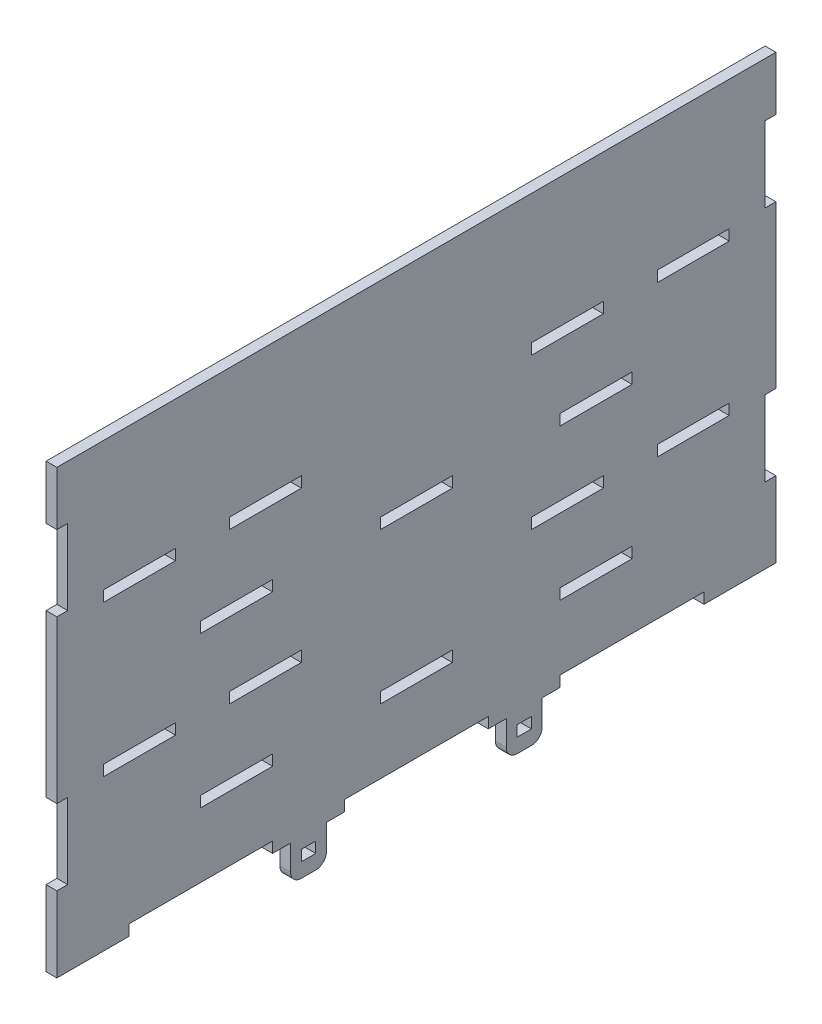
ISO-10303-21;
HEADER;
FILE_DESCRIPTION(('STEP AP214'),'2;1');
FILE_NAME('part.step','',(''),(''),'','','');
FILE_SCHEMA(('AUTOMOTIVE_DESIGN { 1 0 10303 214 1 1 1 1 }'));
ENDSEC;
DATA;
#1=APPLICATION_CONTEXT('core data for automotive mechanical design processes');
#2=APPLICATION_PROTOCOL_DEFINITION('international standard','automotive_design',2000,#1);
#3=PRODUCT_CONTEXT('',#1,'mechanical');
#4=PRODUCT('Part','Part','',(#3));
#5=PRODUCT_RELATED_PRODUCT_CATEGORY('part','',(#4));
#6=PRODUCT_DEFINITION_FORMATION('','',#4);
#7=PRODUCT_DEFINITION_CONTEXT('part definition',#1,'design');
#8=PRODUCT_DEFINITION('design','',#6,#7);
#9=PRODUCT_DEFINITION_SHAPE('','',#8);
#10=(LENGTH_UNIT() NAMED_UNIT(*) SI_UNIT(.MILLI.,.METRE.));
#11=(NAMED_UNIT(*) PLANE_ANGLE_UNIT() SI_UNIT($,.RADIAN.));
#12=(NAMED_UNIT(*) SI_UNIT($,.STERADIAN.) SOLID_ANGLE_UNIT());
#13=UNCERTAINTY_MEASURE_WITH_UNIT(LENGTH_MEASURE(1.E-05),#10,'distance_accuracy_value','');
#14=(GEOMETRIC_REPRESENTATION_CONTEXT(3) GLOBAL_UNCERTAINTY_ASSIGNED_CONTEXT((#13)) GLOBAL_UNIT_ASSIGNED_CONTEXT((#10,
#11,#12)) REPRESENTATION_CONTEXT('',''));
#15=CARTESIAN_POINT('',(0.,0.,0.));
#16=DIRECTION('',(0.,0.,1.));
#17=DIRECTION('',(1.,0.,0.));
#18=AXIS2_PLACEMENT_3D('',#15,#16,#17);
#19=CARTESIAN_POINT('',(0.,-63.,-20.));
#20=DIRECTION('',(0.,-1.,0.));
#21=DIRECTION('',(0.,0.,-1.));
#22=AXIS2_PLACEMENT_3D('',#19,#20,#21);
#23=PLANE('',#22);
#24=DIRECTION('',(1.,0.,0.));
#25=VECTOR('',#24,1.);
#26=CARTESIAN_POINT('',(0.,-63.,-35.));
#27=LINE('',#26,#25);
#28=CARTESIAN_POINT('',(0.,-63.,-35.));
#29=VERTEX_POINT('',#28);
#30=CARTESIAN_POINT('',(3.,-63.,-35.));
#31=VERTEX_POINT('',#30);
#32=EDGE_CURVE('E758',#29,#31,#27,.T.);
#33=ORIENTED_EDGE('',*,*,#32,.F.);
#34=DIRECTION('',(0.,0.,-1.));
#35=VECTOR('',#34,1.);
#36=CARTESIAN_POINT('',(0.,-63.,-20.));
#37=LINE('',#36,#35);
#38=CARTESIAN_POINT('',(0.,-63.,-40.));
#39=VERTEX_POINT('',#38);
#40=EDGE_CURVE('E1390',#29,#39,#37,.T.);
#41=ORIENTED_EDGE('',*,*,#40,.T.);
#42=DIRECTION('',(1.,0.,0.));
#43=VECTOR('',#42,1.);
#44=CARTESIAN_POINT('',(0.,-63.,-40.));
#45=LINE('',#44,#43);
#46=CARTESIAN_POINT('',(3.,-63.,-40.));
#47=VERTEX_POINT('',#46);
#48=EDGE_CURVE('E1411',#39,#47,#45,.T.);
#49=ORIENTED_EDGE('',*,*,#48,.T.);
#50=DIRECTION('',(0.,0.,-1.));
#51=VECTOR('',#50,1.);
#52=CARTESIAN_POINT('',(3.,-63.,-20.));
#53=LINE('',#52,#51);
#54=EDGE_CURVE('E1401',#31,#47,#53,.T.);
#55=ORIENTED_EDGE('',*,*,#54,.F.);
#56=EDGE_LOOP('',(#33,#41,#49,#55));
#57=FACE_BOUND('',#56,.T.);
#58=ADVANCED_FACE('F32',(#57),#23,.T.);
#59=CARTESIAN_POINT('',(0.,-63.,40.));
#60=DIRECTION('',(0.,-1.,0.));
#61=DIRECTION('',(0.,0.,-1.));
#62=AXIS2_PLACEMENT_3D('',#59,#60,#61);
#63=PLANE('',#62);
#64=DIRECTION('',(1.,0.,0.));
#65=VECTOR('',#64,1.);
#66=CARTESIAN_POINT('',(0.,-63.,25.));
#67=LINE('',#66,#65);
#68=CARTESIAN_POINT('',(0.,-63.,25.));
#69=VERTEX_POINT('',#68);
#70=CARTESIAN_POINT('',(3.,-63.,25.));
#71=VERTEX_POINT('',#70);
#72=EDGE_CURVE('E810',#69,#71,#67,.T.);
#73=ORIENTED_EDGE('',*,*,#72,.F.);
#74=DIRECTION('',(0.,0.,-1.));
#75=VECTOR('',#74,1.);
#76=CARTESIAN_POINT('',(0.,-63.,40.));
#77=LINE('',#76,#75);
#78=CARTESIAN_POINT('',(0.,-63.,20.));
#79=VERTEX_POINT('',#78);
#80=EDGE_CURVE('E1420',#69,#79,#77,.T.);
#81=ORIENTED_EDGE('',*,*,#80,.T.);
#82=DIRECTION('',(1.,0.,0.));
#83=VECTOR('',#82,1.);
#84=CARTESIAN_POINT('',(0.,-63.,20.));
#85=LINE('',#84,#83);
#86=CARTESIAN_POINT('',(3.,-63.,20.));
#87=VERTEX_POINT('',#86);
#88=EDGE_CURVE('E1441',#79,#87,#85,.T.);
#89=ORIENTED_EDGE('',*,*,#88,.T.);
#90=DIRECTION('',(0.,0.,-1.));
#91=VECTOR('',#90,1.);
#92=CARTESIAN_POINT('',(3.,-63.,40.));
#93=LINE('',#92,#91);
#94=EDGE_CURVE('E1431',#71,#87,#93,.T.);
#95=ORIENTED_EDGE('',*,*,#94,.F.);
#96=EDGE_LOOP('',(#73,#81,#89,#95));
#97=FACE_BOUND('',#96,.T.);
#98=ADVANCED_FACE('F1615',(#97),#63,.T.);
#99=CARTESIAN_POINT('',(3.,-60.,100.));
#100=DIRECTION('',(0.,0.,-1.));
#101=DIRECTION('',(0.,1.,0.));
#102=AXIS2_PLACEMENT_3D('',#99,#100,#101);
#103=PLANE('',#102);
#104=DIRECTION('',(0.,-1.,0.));
#105=VECTOR('',#104,1.);
#106=CARTESIAN_POINT('',(3.,-60.,100.));
#107=LINE('',#106,#105);
#108=CARTESIAN_POINT('',(3.,24.,100.));
#109=VERTEX_POINT('',#108);
#110=CARTESIAN_POINT('',(3.,-21.,100.));
#111=VERTEX_POINT('',#110);
#112=EDGE_CURVE('E1471',#109,#111,#107,.T.);
#113=ORIENTED_EDGE('',*,*,#112,.F.);
#114=DIRECTION('',(1.,0.,0.));
#115=VECTOR('',#114,1.);
#116=CARTESIAN_POINT('',(0.,24.,100.));
#117=LINE('',#116,#115);
#118=CARTESIAN_POINT('',(0.,24.,100.));
#119=VERTEX_POINT('',#118);
#120=EDGE_CURVE('E995',#119,#109,#117,.T.);
#121=ORIENTED_EDGE('',*,*,#120,.F.);
#122=DIRECTION('',(0.,-1.,0.));
#123=VECTOR('',#122,1.);
#124=CARTESIAN_POINT('',(0.,-60.,100.));
#125=LINE('',#124,#123);
#126=CARTESIAN_POINT('',(0.,-21.,100.));
#127=VERTEX_POINT('',#126);
#128=EDGE_CURVE('E1489',#119,#127,#125,.T.);
#129=ORIENTED_EDGE('',*,*,#128,.T.);
#130=DIRECTION('',(1.,0.,0.));
#131=VECTOR('',#130,1.);
#132=CARTESIAN_POINT('',(0.,-21.,100.));
#133=LINE('',#132,#131);
#134=EDGE_CURVE('E1359',#127,#111,#133,.T.);
#135=ORIENTED_EDGE('',*,*,#134,.T.);
#136=EDGE_LOOP('',(#113,#121,#129,#135));
#137=FACE_BOUND('',#136,.T.);
#138=ADVANCED_FACE('F1584',(#137),#103,.F.);
#139=CARTESIAN_POINT('',(0.,60.,100.));
#140=VERTEX_POINT('',#139);
#141=CARTESIAN_POINT('',(0.,45.,100.));
#142=VERTEX_POINT('',#141);
#143=EDGE_CURVE('E1485',#140,#142,#125,.T.);
#144=ORIENTED_EDGE('',*,*,#143,.T.);
#145=DIRECTION('',(1.,0.,0.));
#146=VECTOR('',#145,1.);
#147=CARTESIAN_POINT('',(0.,45.,100.));
#148=LINE('',#147,#146);
#149=CARTESIAN_POINT('',(3.,45.,100.));
#150=VERTEX_POINT('',#149);
#151=EDGE_CURVE('E998',#142,#150,#148,.T.);
#152=ORIENTED_EDGE('',*,*,#151,.T.);
#153=CARTESIAN_POINT('',(3.,60.,100.));
#154=VERTEX_POINT('',#153);
#155=EDGE_CURVE('E1467',#154,#150,#107,.T.);
#156=ORIENTED_EDGE('',*,*,#155,.F.);
#157=DIRECTION('',(-1.,0.,0.));
#158=VECTOR('',#157,1.);
#159=CARTESIAN_POINT('',(3.,60.,100.));
#160=LINE('',#159,#158);
#161=EDGE_CURVE('E1484',#154,#140,#160,.T.);
#162=ORIENTED_EDGE('',*,*,#161,.T.);
#163=EDGE_LOOP('',(#144,#152,#156,#162));
#164=FACE_BOUND('',#163,.T.);
#165=ADVANCED_FACE('F1600',(#164),#103,.F.);
#166=CARTESIAN_POINT('',(3.,60.,-100.));
#167=DIRECTION('',(0.,0.,1.));
#168=DIRECTION('',(0.,-1.,0.));
#169=AXIS2_PLACEMENT_3D('',#166,#167,#168);
#170=PLANE('',#169);
#171=DIRECTION('',(0.,1.,0.));
#172=VECTOR('',#171,1.);
#173=CARTESIAN_POINT('',(0.,60.,-100.));
#174=LINE('',#173,#172);
#175=CARTESIAN_POINT('',(0.,-21.,-100.));
#176=VERTEX_POINT('',#175);
#177=CARTESIAN_POINT('',(0.,24.,-100.));
#178=VERTEX_POINT('',#177);
#179=EDGE_CURVE('E1498',#176,#178,#174,.T.);
#180=ORIENTED_EDGE('',*,*,#179,.T.);
#181=DIRECTION('',(1.,0.,0.));
#182=VECTOR('',#181,1.);
#183=CARTESIAN_POINT('',(0.,24.,-100.));
#184=LINE('',#183,#182);
#185=CARTESIAN_POINT('',(3.,24.,-100.));
#186=VERTEX_POINT('',#185);
#187=EDGE_CURVE('E1303',#178,#186,#184,.T.);
#188=ORIENTED_EDGE('',*,*,#187,.T.);
#189=DIRECTION('',(0.,1.,0.));
#190=VECTOR('',#189,1.);
#191=CARTESIAN_POINT('',(3.,60.,-100.));
#192=LINE('',#191,#190);
#193=CARTESIAN_POINT('',(3.,-21.,-100.));
#194=VERTEX_POINT('',#193);
#195=EDGE_CURVE('E1482',#194,#186,#192,.T.);
#196=ORIENTED_EDGE('',*,*,#195,.F.);
#197=DIRECTION('',(1.,0.,0.));
#198=VECTOR('',#197,1.);
#199=CARTESIAN_POINT('',(0.,-21.,-100.));
#200=LINE('',#199,#198);
#201=EDGE_CURVE('E1174',#176,#194,#200,.T.);
#202=ORIENTED_EDGE('',*,*,#201,.F.);
#203=EDGE_LOOP('',(#180,#188,#196,#202));
#204=FACE_BOUND('',#203,.T.);
#205=ADVANCED_FACE('F1608',(#204),#170,.F.);
#206=CARTESIAN_POINT('',(0.,-63.,-100.));
#207=VERTEX_POINT('',#206);
#208=CARTESIAN_POINT('',(0.,-42.,-100.));
#209=VERTEX_POINT('',#208);
#210=EDGE_CURVE('E1494',#207,#209,#174,.T.);
#211=ORIENTED_EDGE('',*,*,#210,.T.);
#212=DIRECTION('',(1.,0.,0.));
#213=VECTOR('',#212,1.);
#214=CARTESIAN_POINT('',(0.,-42.,-100.));
#215=LINE('',#214,#213);
#216=CARTESIAN_POINT('',(3.,-42.,-100.));
#217=VERTEX_POINT('',#216);
#218=EDGE_CURVE('E1183',#209,#217,#215,.T.);
#219=ORIENTED_EDGE('',*,*,#218,.T.);
#220=CARTESIAN_POINT('',(3.,-63.,-100.));
#221=VERTEX_POINT('',#220);
#222=EDGE_CURVE('E1478',#221,#217,#192,.T.);
#223=ORIENTED_EDGE('',*,*,#222,.F.);
#224=DIRECTION('',(1.,0.,0.));
#225=VECTOR('',#224,1.);
#226=CARTESIAN_POINT('',(0.,-63.,-100.));
#227=LINE('',#226,#225);
#228=EDGE_CURVE('E1380',#207,#221,#227,.T.);
#229=ORIENTED_EDGE('',*,*,#228,.F.);
#230=EDGE_LOOP('',(#211,#219,#223,#229));
#231=FACE_BOUND('',#230,.T.);
#232=ADVANCED_FACE('F1609',(#231),#170,.F.);
#233=CARTESIAN_POINT('',(3.,-60.,-100.));
#234=DIRECTION('',(0.,1.,0.));
#235=DIRECTION('',(0.,0.,1.));
#236=AXIS2_PLACEMENT_3D('',#233,#234,#235);
#237=PLANE('',#236);
#238=DIRECTION('',(0.,0.,-1.));
#239=VECTOR('',#238,1.);
#240=CARTESIAN_POINT('',(0.,-60.,-100.));
#241=LINE('',#240,#239);
#242=CARTESIAN_POINT('',(0.,-60.,-40.));
#243=VERTEX_POINT('',#242);
#244=CARTESIAN_POINT('',(0.,-60.,-80.));
#245=VERTEX_POINT('',#244);
#246=EDGE_CURVE('E1488',#243,#245,#241,.T.);
#247=ORIENTED_EDGE('',*,*,#246,.T.);
#248=DIRECTION('',(1.,0.,0.));
#249=VECTOR('',#248,1.);
#250=CARTESIAN_POINT('',(0.,-60.,-80.));
#251=LINE('',#250,#249);
#252=CARTESIAN_POINT('',(3.,-60.,-80.));
#253=VERTEX_POINT('',#252);
#254=EDGE_CURVE('E1375',#245,#253,#251,.T.);
#255=ORIENTED_EDGE('',*,*,#254,.T.);
#256=DIRECTION('',(0.,0.,-1.));
#257=VECTOR('',#256,1.);
#258=CARTESIAN_POINT('',(3.,-60.,-100.));
#259=LINE('',#258,#257);
#260=CARTESIAN_POINT('',(3.,-60.,-40.));
#261=VERTEX_POINT('',#260);
#262=EDGE_CURVE('E1470',#261,#253,#259,.T.);
#263=ORIENTED_EDGE('',*,*,#262,.F.);
#264=DIRECTION('',(1.,0.,0.));
#265=VECTOR('',#264,1.);
#266=CARTESIAN_POINT('',(0.,-60.,-40.));
#267=LINE('',#266,#265);
#268=EDGE_CURVE('E1407',#243,#261,#267,.T.);
#269=ORIENTED_EDGE('',*,*,#268,.F.);
#270=EDGE_LOOP('',(#247,#255,#263,#269));
#271=FACE_BOUND('',#270,.T.);
#272=ADVANCED_FACE('F1612',(#271),#237,.F.);
#273=CARTESIAN_POINT('',(0.,-60.,20.));
#274=VERTEX_POINT('',#273);
#275=CARTESIAN_POINT('',(0.,-60.,-20.));
#276=VERTEX_POINT('',#275);
#277=EDGE_CURVE('E1493',#274,#276,#241,.T.);
#278=ORIENTED_EDGE('',*,*,#277,.T.);
#279=DIRECTION('',(1.,0.,0.));
#280=VECTOR('',#279,1.);
#281=CARTESIAN_POINT('',(0.,-60.,-20.));
#282=LINE('',#281,#280);
#283=CARTESIAN_POINT('',(3.,-60.,-20.));
#284=VERTEX_POINT('',#283);
#285=EDGE_CURVE('E1398',#276,#284,#282,.T.);
#286=ORIENTED_EDGE('',*,*,#285,.T.);
#287=CARTESIAN_POINT('',(3.,-60.,20.));
#288=VERTEX_POINT('',#287);
#289=EDGE_CURVE('E1477',#288,#284,#259,.T.);
#290=ORIENTED_EDGE('',*,*,#289,.F.);
#291=DIRECTION('',(1.,0.,0.));
#292=VECTOR('',#291,1.);
#293=CARTESIAN_POINT('',(0.,-60.,20.));
#294=LINE('',#293,#292);
#295=EDGE_CURVE('E1437',#274,#288,#294,.T.);
#296=ORIENTED_EDGE('',*,*,#295,.F.);
#297=EDGE_LOOP('',(#278,#286,#290,#296));
#298=FACE_BOUND('',#297,.T.);
#299=ADVANCED_FACE('F1610',(#298),#237,.F.);
#300=CARTESIAN_POINT('',(0.,-60.,79.9999999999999));
#301=VERTEX_POINT('',#300);
#302=CARTESIAN_POINT('',(0.,-60.,39.9999999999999));
#303=VERTEX_POINT('',#302);
#304=EDGE_CURVE('E1490',#301,#303,#241,.T.);
#305=ORIENTED_EDGE('',*,*,#304,.T.);
#306=DIRECTION('',(1.,0.,0.));
#307=VECTOR('',#306,1.);
#308=CARTESIAN_POINT('',(0.,-60.,40.));
#309=LINE('',#308,#307);
#310=CARTESIAN_POINT('',(3.,-60.,39.9999999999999));
#311=VERTEX_POINT('',#310);
#312=EDGE_CURVE('E1428',#303,#311,#309,.T.);
#313=ORIENTED_EDGE('',*,*,#312,.T.);
#314=CARTESIAN_POINT('',(3.,-60.,80.));
#315=VERTEX_POINT('',#314);
#316=EDGE_CURVE('E1473',#315,#311,#259,.T.);
#317=ORIENTED_EDGE('',*,*,#316,.F.);
#318=DIRECTION('',(1.,0.,0.));
#319=VECTOR('',#318,1.);
#320=CARTESIAN_POINT('',(0.,-60.,80.));
#321=LINE('',#320,#319);
#322=EDGE_CURVE('E1459',#301,#315,#321,.T.);
#323=ORIENTED_EDGE('',*,*,#322,.F.);
#324=EDGE_LOOP('',(#305,#313,#317,#323));
#325=FACE_BOUND('',#324,.T.);
#326=ADVANCED_FACE('F1598',(#325),#237,.F.);
#327=CARTESIAN_POINT('',(3.,-42.,100.));
#328=VERTEX_POINT('',#327);
#329=CARTESIAN_POINT('',(3.,-63.,100.));
#330=VERTEX_POINT('',#329);
#331=EDGE_CURVE('E1472',#328,#330,#107,.T.);
#332=ORIENTED_EDGE('',*,*,#331,.F.);
#333=DIRECTION('',(1.,0.,0.));
#334=VECTOR('',#333,1.);
#335=CARTESIAN_POINT('',(0.,-42.,100.));
#336=LINE('',#335,#334);
#337=CARTESIAN_POINT('',(0.,-42.,100.));
#338=VERTEX_POINT('',#337);
#339=EDGE_CURVE('E1352',#338,#328,#336,.T.);
#340=ORIENTED_EDGE('',*,*,#339,.F.);
#341=CARTESIAN_POINT('',(0.,-63.,100.));
#342=VERTEX_POINT('',#341);
#343=EDGE_CURVE('E1462',#338,#342,#125,.T.);
#344=ORIENTED_EDGE('',*,*,#343,.T.);
#345=DIRECTION('',(1.,0.,0.));
#346=VECTOR('',#345,1.);
#347=CARTESIAN_POINT('',(0.,-63.,100.));
#348=LINE('',#347,#346);
#349=EDGE_CURVE('E1454',#342,#330,#348,.T.);
#350=ORIENTED_EDGE('',*,*,#349,.T.);
#351=EDGE_LOOP('',(#332,#340,#344,#350));
#352=FACE_BOUND('',#351,.T.);
#353=ADVANCED_FACE('F1595',(#352),#103,.F.);
#354=CARTESIAN_POINT('',(3.,45.,-100.));
#355=VERTEX_POINT('',#354);
#356=CARTESIAN_POINT('',(3.,60.,-100.));
#357=VERTEX_POINT('',#356);
#358=EDGE_CURVE('E1476',#355,#357,#192,.T.);
#359=ORIENTED_EDGE('',*,*,#358,.F.);
#360=DIRECTION('',(1.,0.,0.));
#361=VECTOR('',#360,1.);
#362=CARTESIAN_POINT('',(0.,45.,-100.));
#363=LINE('',#362,#361);
#364=CARTESIAN_POINT('',(0.,45.,-100.));
#365=VERTEX_POINT('',#364);
#366=EDGE_CURVE('E1328',#365,#355,#363,.T.);
#367=ORIENTED_EDGE('',*,*,#366,.F.);
#368=CARTESIAN_POINT('',(0.,60.,-100.));
#369=VERTEX_POINT('',#368);
#370=EDGE_CURVE('E1492',#365,#369,#174,.T.);
#371=ORIENTED_EDGE('',*,*,#370,.T.);
#372=DIRECTION('',(-1.,0.,0.));
#373=VECTOR('',#372,1.);
#374=CARTESIAN_POINT('',(3.,60.,-100.));
#375=LINE('',#374,#373);
#376=EDGE_CURVE('E1502',#357,#369,#375,.T.);
#377=ORIENTED_EDGE('',*,*,#376,.F.);
#378=EDGE_LOOP('',(#359,#367,#371,#377));
#379=FACE_BOUND('',#378,.T.);
#380=ADVANCED_FACE('F1597',(#379),#170,.F.);
#381=CARTESIAN_POINT('',(3.,60.,100.));
#382=DIRECTION('',(0.,-1.,0.));
#383=DIRECTION('',(0.,0.,-1.));
#384=AXIS2_PLACEMENT_3D('',#381,#382,#383);
#385=PLANE('',#384);
#386=DIRECTION('',(0.,0.,1.));
#387=VECTOR('',#386,1.);
#388=CARTESIAN_POINT('',(0.,60.,100.));
#389=LINE('',#388,#387);
#390=EDGE_CURVE('E1497',#369,#140,#389,.T.);
#391=ORIENTED_EDGE('',*,*,#390,.T.);
#392=ORIENTED_EDGE('',*,*,#161,.F.);
#393=DIRECTION('',(0.,0.,1.));
#394=VECTOR('',#393,1.);
#395=CARTESIAN_POINT('',(3.,60.,100.));
#396=LINE('',#395,#394);
#397=EDGE_CURVE('E1481',#357,#154,#396,.T.);
#398=ORIENTED_EDGE('',*,*,#397,.F.);
#399=ORIENTED_EDGE('',*,*,#376,.T.);
#400=EDGE_LOOP('',(#391,#392,#398,#399));
#401=FACE_BOUND('',#400,.T.);
#402=ADVANCED_FACE('F1605',(#401),#385,.F.);
#403=CARTESIAN_POINT('',(3.,0.,0.));
#404=DIRECTION('',(-1.,0.,0.));
#405=DIRECTION('',(0.,0.,1.));
#406=AXIS2_PLACEMENT_3D('',#403,#404,#405);
#407=PLANE('',#406);
#408=DIRECTION('',(0.,1.,0.));
#409=VECTOR('',#408,1.);
#410=CARTESIAN_POINT('',(3.,-18.,67.));
#411=LINE('',#410,#409);
#412=CARTESIAN_POINT('',(3.,-21.,67.));
#413=VERTEX_POINT('',#412);
#414=CARTESIAN_POINT('',(3.,-18.,67.));
#415=VERTEX_POINT('',#414);
#416=EDGE_CURVE('E1020',#413,#415,#411,.T.);
#417=ORIENTED_EDGE('',*,*,#416,.F.);
#418=DIRECTION('',(0.,0.,-1.));
#419=VECTOR('',#418,1.);
#420=CARTESIAN_POINT('',(3.,-21.,67.));
#421=LINE('',#420,#419);
#422=CARTESIAN_POINT('',(3.,-21.,87.));
#423=VERTEX_POINT('',#422);
#424=EDGE_CURVE('E1018',#423,#413,#421,.T.);
#425=ORIENTED_EDGE('',*,*,#424,.F.);
#426=DIRECTION('',(0.,-1.,0.));
#427=VECTOR('',#426,1.);
#428=CARTESIAN_POINT('',(3.,-21.,87.));
#429=LINE('',#428,#427);
#430=CARTESIAN_POINT('',(3.,-18.,87.));
#431=VERTEX_POINT('',#430);
#432=EDGE_CURVE('E1008',#431,#423,#429,.T.);
#433=ORIENTED_EDGE('',*,*,#432,.F.);
#434=DIRECTION('',(0.,0.,1.));
#435=VECTOR('',#434,1.);
#436=CARTESIAN_POINT('',(3.,-18.,87.));
#437=LINE('',#436,#435);
#438=EDGE_CURVE('E1024',#415,#431,#437,.T.);
#439=ORIENTED_EDGE('',*,*,#438,.F.);
#440=EDGE_LOOP('',(#417,#425,#433,#439));
#441=FACE_BOUND('',#440,.T.);
#442=DIRECTION('',(0.,-1.,0.));
#443=VECTOR('',#442,1.);
#444=CARTESIAN_POINT('',(3.,-18.,52.));
#445=LINE('',#444,#443);
#446=CARTESIAN_POINT('',(3.,-18.,52.));
#447=VERTEX_POINT('',#446);
#448=CARTESIAN_POINT('',(3.,-21.,52.));
#449=VERTEX_POINT('',#448);
#450=EDGE_CURVE('E1052',#447,#449,#445,.T.);
#451=ORIENTED_EDGE('',*,*,#450,.F.);
#452=DIRECTION('',(0.,0.,1.));
#453=VECTOR('',#452,1.);
#454=CARTESIAN_POINT('',(3.,-18.,32.));
#455=LINE('',#454,#453);
#456=CARTESIAN_POINT('',(3.,-18.,32.));
#457=VERTEX_POINT('',#456);
#458=EDGE_CURVE('E1050',#457,#447,#455,.T.);
#459=ORIENTED_EDGE('',*,*,#458,.F.);
#460=DIRECTION('',(0.,1.,0.));
#461=VECTOR('',#460,1.);
#462=CARTESIAN_POINT('',(3.,-21.,32.));
#463=LINE('',#462,#461);
#464=CARTESIAN_POINT('',(3.,-21.,32.));
#465=VERTEX_POINT('',#464);
#466=EDGE_CURVE('E1040',#465,#457,#463,.T.);
#467=ORIENTED_EDGE('',*,*,#466,.F.);
#468=DIRECTION('',(0.,0.,-1.));
#469=VECTOR('',#468,1.);
#470=CARTESIAN_POINT('',(3.,-21.,52.));
#471=LINE('',#470,#469);
#472=EDGE_CURVE('E1056',#449,#465,#471,.T.);
#473=ORIENTED_EDGE('',*,*,#472,.F.);
#474=EDGE_LOOP('',(#451,#459,#467,#473));
#475=FACE_BOUND('',#474,.T.);
#476=DIRECTION('',(0.,1.,0.));
#477=VECTOR('',#476,1.);
#478=CARTESIAN_POINT('',(3.,-18.,-52.));
#479=LINE('',#478,#477);
#480=CARTESIAN_POINT('',(3.,-21.,-52.));
#481=VERTEX_POINT('',#480);
#482=CARTESIAN_POINT('',(3.,-18.,-52.));
#483=VERTEX_POINT('',#482);
#484=EDGE_CURVE('E1083',#481,#483,#479,.T.);
#485=ORIENTED_EDGE('',*,*,#484,.F.);
#486=DIRECTION('',(0.,0.,-1.));
#487=VECTOR('',#486,1.);
#488=CARTESIAN_POINT('',(3.,-21.,-52.));
#489=LINE('',#488,#487);
#490=CARTESIAN_POINT('',(3.,-21.,-32.));
#491=VERTEX_POINT('',#490);
#492=EDGE_CURVE('E939',#491,#481,#489,.T.);
#493=ORIENTED_EDGE('',*,*,#492,.F.);
#494=DIRECTION('',(0.,-1.,0.));
#495=VECTOR('',#494,1.);
#496=CARTESIAN_POINT('',(3.,-21.,-32.));
#497=LINE('',#496,#495);
#498=CARTESIAN_POINT('',(3.,-18.,-32.));
#499=VERTEX_POINT('',#498);
#500=EDGE_CURVE('E1072',#499,#491,#497,.T.);
#501=ORIENTED_EDGE('',*,*,#500,.F.);
#502=DIRECTION('',(0.,0.,1.));
#503=VECTOR('',#502,1.);
#504=CARTESIAN_POINT('',(3.,-18.,-32.));
#505=LINE('',#504,#503);
#506=EDGE_CURVE('E1086',#483,#499,#505,.T.);
#507=ORIENTED_EDGE('',*,*,#506,.F.);
#508=EDGE_LOOP('',(#485,#493,#501,#507));
#509=FACE_BOUND('',#508,.T.);
#510=DIRECTION('',(0.,0.,-1.));
#511=VECTOR('',#510,1.);
#512=CARTESIAN_POINT('',(3.,21.,-52.));
#513=LINE('',#512,#511);
#514=CARTESIAN_POINT('',(3.,21.,-32.));
#515=VERTEX_POINT('',#514);
#516=CARTESIAN_POINT('',(3.,21.,-52.));
#517=VERTEX_POINT('',#516);
#518=EDGE_CURVE('E897',#515,#517,#513,.T.);
#519=ORIENTED_EDGE('',*,*,#518,.F.);
#520=DIRECTION('',(0.,-1.,0.));
#521=VECTOR('',#520,1.);
#522=CARTESIAN_POINT('',(3.,21.,-32.));
#523=LINE('',#522,#521);
#524=CARTESIAN_POINT('',(3.,24.,-32.));
#525=VERTEX_POINT('',#524);
#526=EDGE_CURVE('E841',#525,#515,#523,.T.);
#527=ORIENTED_EDGE('',*,*,#526,.F.);
#528=DIRECTION('',(0.,0.,1.));
#529=VECTOR('',#528,1.);
#530=CARTESIAN_POINT('',(3.,24.,-32.));
#531=LINE('',#530,#529);
#532=CARTESIAN_POINT('',(3.,24.,-52.));
#533=VERTEX_POINT('',#532);
#534=EDGE_CURVE('E886',#533,#525,#531,.T.);
#535=ORIENTED_EDGE('',*,*,#534,.F.);
#536=DIRECTION('',(0.,1.,0.));
#537=VECTOR('',#536,1.);
#538=CARTESIAN_POINT('',(3.,24.,-52.));
#539=LINE('',#538,#537);
#540=EDGE_CURVE('E900',#517,#533,#539,.T.);
#541=ORIENTED_EDGE('',*,*,#540,.F.);
#542=EDGE_LOOP('',(#519,#527,#535,#541));
#543=FACE_BOUND('',#542,.T.);
#544=DIRECTION('',(0.,-1.,0.));
#545=VECTOR('',#544,1.);
#546=CARTESIAN_POINT('',(3.,24.,52.));
#547=LINE('',#546,#545);
#548=CARTESIAN_POINT('',(3.,24.,52.));
#549=VERTEX_POINT('',#548);
#550=CARTESIAN_POINT('',(3.,21.,52.));
#551=VERTEX_POINT('',#550);
#552=EDGE_CURVE('E864',#549,#551,#547,.T.);
#553=ORIENTED_EDGE('',*,*,#552,.F.);
#554=DIRECTION('',(0.,0.,1.));
#555=VECTOR('',#554,1.);
#556=CARTESIAN_POINT('',(3.,24.,32.));
#557=LINE('',#556,#555);
#558=CARTESIAN_POINT('',(3.,24.,32.));
#559=VERTEX_POINT('',#558);
#560=EDGE_CURVE('E862',#559,#549,#557,.T.);
#561=ORIENTED_EDGE('',*,*,#560,.F.);
#562=DIRECTION('',(0.,1.,0.));
#563=VECTOR('',#562,1.);
#564=CARTESIAN_POINT('',(3.,21.,32.));
#565=LINE('',#564,#563);
#566=CARTESIAN_POINT('',(3.,21.,32.));
#567=VERTEX_POINT('',#566);
#568=EDGE_CURVE('E852',#567,#559,#565,.T.);
#569=ORIENTED_EDGE('',*,*,#568,.F.);
#570=DIRECTION('',(0.,0.,-1.));
#571=VECTOR('',#570,1.);
#572=CARTESIAN_POINT('',(3.,21.,52.));
#573=LINE('',#572,#571);
#574=EDGE_CURVE('E868',#551,#567,#573,.T.);
#575=ORIENTED_EDGE('',*,*,#574,.F.);
#576=EDGE_LOOP('',(#553,#561,#569,#575));
#577=FACE_BOUND('',#576,.T.);
#578=DIRECTION('',(0.,0.,-1.));
#579=VECTOR('',#578,1.);
#580=CARTESIAN_POINT('',(3.,21.,67.));
#581=LINE('',#580,#579);
#582=CARTESIAN_POINT('',(3.,21.,87.));
#583=VERTEX_POINT('',#582);
#584=CARTESIAN_POINT('',(3.,21.,67.));
#585=VERTEX_POINT('',#584);
#586=EDGE_CURVE('E961',#583,#585,#581,.T.);
#587=ORIENTED_EDGE('',*,*,#586,.F.);
#588=DIRECTION('',(0.,-1.,0.));
#589=VECTOR('',#588,1.);
#590=CARTESIAN_POINT('',(3.,21.,87.));
#591=LINE('',#590,#589);
#592=CARTESIAN_POINT('',(3.,24.,87.));
#593=VERTEX_POINT('',#592);
#594=EDGE_CURVE('E875',#593,#583,#591,.T.);
#595=ORIENTED_EDGE('',*,*,#594,.F.);
#596=DIRECTION('',(0.,0.,1.));
#597=VECTOR('',#596,1.);
#598=CARTESIAN_POINT('',(3.,24.,87.));
#599=LINE('',#598,#597);
#600=CARTESIAN_POINT('',(3.,24.,67.));
#601=VERTEX_POINT('',#600);
#602=EDGE_CURVE('E950',#601,#593,#599,.T.);
#603=ORIENTED_EDGE('',*,*,#602,.F.);
#604=DIRECTION('',(0.,1.,0.));
#605=VECTOR('',#604,1.);
#606=CARTESIAN_POINT('',(3.,24.,67.));
#607=LINE('',#606,#605);
#608=EDGE_CURVE('E964',#585,#601,#607,.T.);
#609=ORIENTED_EDGE('',*,*,#608,.F.);
#610=EDGE_LOOP('',(#587,#595,#603,#609));
#611=FACE_BOUND('',#610,.T.);
#612=DIRECTION('',(0.,-1.,0.));
#613=VECTOR('',#612,1.);
#614=CARTESIAN_POINT('',(3.,-18.,-67.));
#615=LINE('',#614,#613);
#616=CARTESIAN_POINT('',(3.,-18.,-67.));
#617=VERTEX_POINT('',#616);
#618=CARTESIAN_POINT('',(3.,-21.,-67.));
#619=VERTEX_POINT('',#618);
#620=EDGE_CURVE('E928',#617,#619,#615,.T.);
#621=ORIENTED_EDGE('',*,*,#620,.F.);
#622=DIRECTION('',(0.,0.,1.));
#623=VECTOR('',#622,1.);
#624=CARTESIAN_POINT('',(3.,-18.,-87.));
#625=LINE('',#624,#623);
#626=CARTESIAN_POINT('',(3.,-18.,-87.));
#627=VERTEX_POINT('',#626);
#628=EDGE_CURVE('E926',#627,#617,#625,.T.);
#629=ORIENTED_EDGE('',*,*,#628,.F.);
#630=DIRECTION('',(0.,1.,0.));
#631=VECTOR('',#630,1.);
#632=CARTESIAN_POINT('',(3.,-21.,-87.));
#633=LINE('',#632,#631);
#634=CARTESIAN_POINT('',(3.,-21.,-87.));
#635=VERTEX_POINT('',#634);
#636=EDGE_CURVE('E916',#635,#627,#633,.T.);
#637=ORIENTED_EDGE('',*,*,#636,.F.);
#638=DIRECTION('',(0.,0.,-1.));
#639=VECTOR('',#638,1.);
#640=CARTESIAN_POINT('',(3.,-21.,-67.));
#641=LINE('',#640,#639);
#642=EDGE_CURVE('E932',#619,#635,#641,.T.);
#643=ORIENTED_EDGE('',*,*,#642,.F.);
#644=EDGE_LOOP('',(#621,#629,#637,#643));
#645=FACE_BOUND('',#644,.T.);
#646=DIRECTION('',(0.,-1.,0.));
#647=VECTOR('',#646,1.);
#648=CARTESIAN_POINT('',(3.,3.,-40.));
#649=LINE('',#648,#647);
#650=CARTESIAN_POINT('',(3.,3.,-40.));
#651=VERTEX_POINT('',#650);
#652=CARTESIAN_POINT('',(3.,0.,-40.));
#653=VERTEX_POINT('',#652);
#654=EDGE_CURVE('E1302',#651,#653,#649,.T.);
#655=ORIENTED_EDGE('',*,*,#654,.F.);
#656=DIRECTION('',(0.,0.,1.));
#657=VECTOR('',#656,1.);
#658=CARTESIAN_POINT('',(3.,3.,-60.));
#659=LINE('',#658,#657);
#660=CARTESIAN_POINT('',(3.,3.,-60.));
#661=VERTEX_POINT('',#660);
#662=EDGE_CURVE('E1300',#661,#651,#659,.T.);
#663=ORIENTED_EDGE('',*,*,#662,.F.);
#664=DIRECTION('',(0.,1.,0.));
#665=VECTOR('',#664,1.);
#666=CARTESIAN_POINT('',(3.,0.,-60.));
#667=LINE('',#666,#665);
#668=CARTESIAN_POINT('',(3.,0.,-60.));
#669=VERTEX_POINT('',#668);
#670=EDGE_CURVE('E1290',#669,#661,#667,.T.);
#671=ORIENTED_EDGE('',*,*,#670,.F.);
#672=DIRECTION('',(0.,0.,-1.));
#673=VECTOR('',#672,1.);
#674=CARTESIAN_POINT('',(3.,0.,-40.));
#675=LINE('',#674,#673);
#676=EDGE_CURVE('E1306',#653,#669,#675,.T.);
#677=ORIENTED_EDGE('',*,*,#676,.F.);
#678=EDGE_LOOP('',(#655,#663,#671,#677));
#679=FACE_BOUND('',#678,.T.);
#680=DIRECTION('',(0.,0.,-1.));
#681=VECTOR('',#680,1.);
#682=CARTESIAN_POINT('',(3.,0.,-10.));
#683=LINE('',#682,#681);
#684=CARTESIAN_POINT('',(3.,-1.02348685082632E-13,10.));
#685=VERTEX_POINT('',#684);
#686=CARTESIAN_POINT('',(3.,0.,-10.));
#687=VERTEX_POINT('',#686);
#688=EDGE_CURVE('E1270',#685,#687,#683,.T.);
#689=ORIENTED_EDGE('',*,*,#688,.F.);
#690=DIRECTION('',(0.,-1.,0.));
#691=VECTOR('',#690,1.);
#692=CARTESIAN_POINT('',(3.,-1.02348685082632E-13,10.));
#693=LINE('',#692,#691);
#694=CARTESIAN_POINT('',(3.,2.9999999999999,10.));
#695=VERTEX_POINT('',#694);
#696=EDGE_CURVE('E1268',#695,#685,#693,.T.);
#697=ORIENTED_EDGE('',*,*,#696,.F.);
#698=DIRECTION('',(0.,0.,1.));
#699=VECTOR('',#698,1.);
#700=CARTESIAN_POINT('',(3.,2.9999999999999,10.));
#701=LINE('',#700,#699);
#702=CARTESIAN_POINT('',(3.,2.9999999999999,-10.));
#703=VERTEX_POINT('',#702);
#704=EDGE_CURVE('E1258',#703,#695,#701,.T.);
#705=ORIENTED_EDGE('',*,*,#704,.F.);
#706=DIRECTION('',(0.,1.,0.));
#707=VECTOR('',#706,1.);
#708=CARTESIAN_POINT('',(3.,2.9999999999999,-10.));
#709=LINE('',#708,#707);
#710=EDGE_CURVE('E1274',#687,#703,#709,.T.);
#711=ORIENTED_EDGE('',*,*,#710,.F.);
#712=EDGE_LOOP('',(#689,#697,#705,#711));
#713=FACE_BOUND('',#712,.T.);
#714=DIRECTION('',(0.,0.,-1.));
#715=VECTOR('',#714,1.);
#716=CARTESIAN_POINT('',(3.,0.,40.));
#717=LINE('',#716,#715);
#718=CARTESIAN_POINT('',(3.,0.,60.));
#719=VERTEX_POINT('',#718);
#720=CARTESIAN_POINT('',(3.,0.,40.));
#721=VERTEX_POINT('',#720);
#722=EDGE_CURVE('E1238',#719,#721,#717,.T.);
#723=ORIENTED_EDGE('',*,*,#722,.F.);
#724=DIRECTION('',(0.,-1.,0.));
#725=VECTOR('',#724,1.);
#726=CARTESIAN_POINT('',(3.,0.,60.));
#727=LINE('',#726,#725);
#728=CARTESIAN_POINT('',(3.,2.99999999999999,60.));
#729=VERTEX_POINT('',#728);
#730=EDGE_CURVE('E1236',#729,#719,#727,.T.);
#731=ORIENTED_EDGE('',*,*,#730,.F.);
#732=DIRECTION('',(0.,0.,1.));
#733=VECTOR('',#732,1.);
#734=CARTESIAN_POINT('',(3.,2.99999999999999,60.));
#735=LINE('',#734,#733);
#736=CARTESIAN_POINT('',(3.,2.99999999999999,40.));
#737=VERTEX_POINT('',#736);
#738=EDGE_CURVE('E1226',#737,#729,#735,.T.);
#739=ORIENTED_EDGE('',*,*,#738,.F.);
#740=DIRECTION('',(0.,1.,0.));
#741=VECTOR('',#740,1.);
#742=CARTESIAN_POINT('',(3.,2.99999999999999,40.));
#743=LINE('',#742,#741);
#744=EDGE_CURVE('E1242',#721,#737,#743,.T.);
#745=ORIENTED_EDGE('',*,*,#744,.F.);
#746=EDGE_LOOP('',(#723,#731,#739,#745));
#747=FACE_BOUND('',#746,.T.);
#748=DIRECTION('',(0.,1.,0.));
#749=VECTOR('',#748,1.);
#750=CARTESIAN_POINT('',(3.,-39.,40.));
#751=LINE('',#750,#749);
#752=CARTESIAN_POINT('',(3.,-42.,40.));
#753=VERTEX_POINT('',#752);
#754=CARTESIAN_POINT('',(3.,-39.,40.));
#755=VERTEX_POINT('',#754);
#756=EDGE_CURVE('E1207',#753,#755,#751,.T.);
#757=ORIENTED_EDGE('',*,*,#756,.F.);
#758=DIRECTION('',(0.,0.,-1.));
#759=VECTOR('',#758,1.);
#760=CARTESIAN_POINT('',(3.,-42.,40.));
#761=LINE('',#760,#759);
#762=CARTESIAN_POINT('',(3.,-42.,60.));
#763=VERTEX_POINT('',#762);
#764=EDGE_CURVE('E1125',#763,#753,#761,.T.);
#765=ORIENTED_EDGE('',*,*,#764,.F.);
#766=DIRECTION('',(0.,-1.,0.));
#767=VECTOR('',#766,1.);
#768=CARTESIAN_POINT('',(3.,-42.,60.));
#769=LINE('',#768,#767);
#770=CARTESIAN_POINT('',(3.,-39.,60.));
#771=VERTEX_POINT('',#770);
#772=EDGE_CURVE('E1196',#771,#763,#769,.T.);
#773=ORIENTED_EDGE('',*,*,#772,.F.);
#774=DIRECTION('',(0.,0.,1.));
#775=VECTOR('',#774,1.);
#776=CARTESIAN_POINT('',(3.,-39.,60.));
#777=LINE('',#776,#775);
#778=EDGE_CURVE('E1210',#755,#771,#777,.T.);
#779=ORIENTED_EDGE('',*,*,#778,.F.);
#780=EDGE_LOOP('',(#757,#765,#773,#779));
#781=FACE_BOUND('',#780,.T.);
#782=DIRECTION('',(0.,1.,0.));
#783=VECTOR('',#782,1.);
#784=CARTESIAN_POINT('',(3.,-39.,-10.));
#785=LINE('',#784,#783);
#786=CARTESIAN_POINT('',(3.,-42.,-10.));
#787=VERTEX_POINT('',#786);
#788=CARTESIAN_POINT('',(3.,-39.,-10.));
#789=VERTEX_POINT('',#788);
#790=EDGE_CURVE('E1114',#787,#789,#785,.T.);
#791=ORIENTED_EDGE('',*,*,#790,.F.);
#792=DIRECTION('',(0.,0.,-1.));
#793=VECTOR('',#792,1.);
#794=CARTESIAN_POINT('',(3.,-42.,-10.));
#795=LINE('',#794,#793);
#796=CARTESIAN_POINT('',(3.,-42.,9.99999999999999));
#797=VERTEX_POINT('',#796);
#798=EDGE_CURVE('E1112',#797,#787,#795,.T.);
#799=ORIENTED_EDGE('',*,*,#798,.F.);
#800=DIRECTION('',(0.,-1.,0.));
#801=VECTOR('',#800,1.);
#802=CARTESIAN_POINT('',(3.,-42.,9.99999999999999));
#803=LINE('',#802,#801);
#804=CARTESIAN_POINT('',(3.,-39.,9.99999999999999));
#805=VERTEX_POINT('',#804);
#806=EDGE_CURVE('E1102',#805,#797,#803,.T.);
#807=ORIENTED_EDGE('',*,*,#806,.F.);
#808=DIRECTION('',(0.,0.,1.));
#809=VECTOR('',#808,1.);
#810=CARTESIAN_POINT('',(3.,-39.,9.99999999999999));
#811=LINE('',#810,#809);
#812=EDGE_CURVE('E1118',#789,#805,#811,.T.);
#813=ORIENTED_EDGE('',*,*,#812,.F.);
#814=EDGE_LOOP('',(#791,#799,#807,#813));
#815=FACE_BOUND('',#814,.T.);
#816=DIRECTION('',(0.,-1.,0.));
#817=VECTOR('',#816,1.);
#818=CARTESIAN_POINT('',(3.,-39.,-40.));
#819=LINE('',#818,#817);
#820=CARTESIAN_POINT('',(3.,-39.,-40.));
#821=VERTEX_POINT('',#820);
#822=CARTESIAN_POINT('',(3.,-42.,-40.));
#823=VERTEX_POINT('',#822);
#824=EDGE_CURVE('E1148',#821,#823,#819,.T.);
#825=ORIENTED_EDGE('',*,*,#824,.F.);
#826=DIRECTION('',(0.,0.,1.));
#827=VECTOR('',#826,1.);
#828=CARTESIAN_POINT('',(3.,-39.,-60.));
#829=LINE('',#828,#827);
#830=CARTESIAN_POINT('',(3.,-39.,-60.));
#831=VERTEX_POINT('',#830);
#832=EDGE_CURVE('E1146',#831,#821,#829,.T.);
#833=ORIENTED_EDGE('',*,*,#832,.F.);
#834=DIRECTION('',(0.,1.,0.));
#835=VECTOR('',#834,1.);
#836=CARTESIAN_POINT('',(3.,-42.,-60.));
#837=LINE('',#836,#835);
#838=CARTESIAN_POINT('',(3.,-42.,-60.));
#839=VERTEX_POINT('',#838);
#840=EDGE_CURVE('E1136',#839,#831,#837,.T.);
#841=ORIENTED_EDGE('',*,*,#840,.F.);
#842=DIRECTION('',(0.,0.,-1.));
#843=VECTOR('',#842,1.);
#844=CARTESIAN_POINT('',(3.,-42.,-40.));
#845=LINE('',#844,#843);
#846=EDGE_CURVE('E1152',#823,#839,#845,.T.);
#847=ORIENTED_EDGE('',*,*,#846,.F.);
#848=EDGE_LOOP('',(#825,#833,#841,#847));
#849=FACE_BOUND('',#848,.T.);
#850=DIRECTION('',(0.,-1.,0.));
#851=VECTOR('',#850,1.);
#852=CARTESIAN_POINT('',(3.,24.,-67.));
#853=LINE('',#852,#851);
#854=CARTESIAN_POINT('',(3.,24.,-67.));
#855=VERTEX_POINT('',#854);
#856=CARTESIAN_POINT('',(3.,21.,-67.));
#857=VERTEX_POINT('',#856);
#858=EDGE_CURVE('E831',#855,#857,#853,.T.);
#859=ORIENTED_EDGE('',*,*,#858,.F.);
#860=DIRECTION('',(0.,0.,1.));
#861=VECTOR('',#860,1.);
#862=CARTESIAN_POINT('',(3.,24.,-87.));
#863=LINE('',#862,#861);
#864=CARTESIAN_POINT('',(3.,24.,-87.));
#865=VERTEX_POINT('',#864);
#866=EDGE_CURVE('E813',#865,#855,#863,.T.);
#867=ORIENTED_EDGE('',*,*,#866,.F.);
#868=DIRECTION('',(0.,1.,0.));
#869=VECTOR('',#868,1.);
#870=CARTESIAN_POINT('',(3.,21.,-87.));
#871=LINE('',#870,#869);
#872=CARTESIAN_POINT('',(3.,21.,-87.));
#873=VERTEX_POINT('',#872);
#874=EDGE_CURVE('E820',#873,#865,#871,.T.);
#875=ORIENTED_EDGE('',*,*,#874,.F.);
#876=DIRECTION('',(0.,0.,-1.));
#877=VECTOR('',#876,1.);
#878=CARTESIAN_POINT('',(3.,21.,-67.));
#879=LINE('',#878,#877);
#880=EDGE_CURVE('E834',#857,#873,#879,.T.);
#881=ORIENTED_EDGE('',*,*,#880,.F.);
#882=EDGE_LOOP('',(#859,#867,#875,#881));
#883=FACE_BOUND('',#882,.T.);
#884=DIRECTION('',(0.,0.,-1.));
#885=VECTOR('',#884,1.);
#886=CARTESIAN_POINT('',(3.,-73.,-35.));
#887=LINE('',#886,#885);
#888=CARTESIAN_POINT('',(3.,-73.,-28.));
#889=VERTEX_POINT('',#888);
#890=CARTESIAN_POINT('',(3.,-73.,-32.));
#891=VERTEX_POINT('',#890);
#892=EDGE_CURVE('E754',#889,#891,#887,.T.);
#893=ORIENTED_EDGE('',*,*,#892,.T.);
#894=CARTESIAN_POINT('',(3.,-70.,-32.));
#895=DIRECTION('',(-1.,0.,0.));
#896=DIRECTION('',(0.,0.,1.));
#897=AXIS2_PLACEMENT_3D('',#894,#895,#896);
#898=CIRCLE('',#897,3.);
#899=CARTESIAN_POINT('',(3.,-70.,-35.));
#900=VERTEX_POINT('',#899);
#901=EDGE_CURVE('E1516',#891,#900,#898,.F.);
#902=ORIENTED_EDGE('',*,*,#901,.T.);
#903=DIRECTION('',(0.,1.,0.));
#904=VECTOR('',#903,1.);
#905=CARTESIAN_POINT('',(3.,-63.,-35.));
#906=LINE('',#905,#904);
#907=EDGE_CURVE('E746',#900,#31,#906,.T.);
#908=ORIENTED_EDGE('',*,*,#907,.T.);
#909=ORIENTED_EDGE('',*,*,#54,.T.);
#910=DIRECTION('',(0.,1.,0.));
#911=VECTOR('',#910,1.);
#912=CARTESIAN_POINT('',(3.,-63.,-40.));
#913=LINE('',#912,#911);
#914=EDGE_CURVE('E1391',#47,#261,#913,.T.);
#915=ORIENTED_EDGE('',*,*,#914,.T.);
#916=ORIENTED_EDGE('',*,*,#262,.T.);
#917=DIRECTION('',(0.,-1.,0.));
#918=VECTOR('',#917,1.);
#919=CARTESIAN_POINT('',(3.,-60.,-80.));
#920=LINE('',#919,#918);
#921=CARTESIAN_POINT('',(3.,-63.,-80.));
#922=VERTEX_POINT('',#921);
#923=EDGE_CURVE('E1362',#253,#922,#920,.T.);
#924=ORIENTED_EDGE('',*,*,#923,.T.);
#925=DIRECTION('',(0.,0.,-1.));
#926=VECTOR('',#925,1.);
#927=CARTESIAN_POINT('',(3.,-63.,-80.));
#928=LINE('',#927,#926);
#929=EDGE_CURVE('E1372',#922,#221,#928,.T.);
#930=ORIENTED_EDGE('',*,*,#929,.T.);
#931=ORIENTED_EDGE('',*,*,#222,.T.);
#932=DIRECTION('',(0.,0.,-1.));
#933=VECTOR('',#932,1.);
#934=CARTESIAN_POINT('',(3.,-42.,-100.));
#935=LINE('',#934,#933);
#936=CARTESIAN_POINT('',(3.,-42.,-97.));
#937=VERTEX_POINT('',#936);
#938=EDGE_CURVE('E1168',#937,#217,#935,.T.);
#939=ORIENTED_EDGE('',*,*,#938,.F.);
#940=DIRECTION('',(0.,-1.,0.));
#941=VECTOR('',#940,1.);
#942=CARTESIAN_POINT('',(3.,-42.,-97.));
#943=LINE('',#942,#941);
#944=CARTESIAN_POINT('',(3.,-21.,-97.));
#945=VERTEX_POINT('',#944);
#946=EDGE_CURVE('E1178',#945,#937,#943,.T.);
#947=ORIENTED_EDGE('',*,*,#946,.F.);
#948=DIRECTION('',(0.,0.,1.));
#949=VECTOR('',#948,1.);
#950=CARTESIAN_POINT('',(3.,-21.,-97.));
#951=LINE('',#950,#949);
#952=EDGE_CURVE('E1175',#194,#945,#951,.T.);
#953=ORIENTED_EDGE('',*,*,#952,.F.);
#954=ORIENTED_EDGE('',*,*,#195,.T.);
#955=DIRECTION('',(0.,0.,-1.));
#956=VECTOR('',#955,1.);
#957=CARTESIAN_POINT('',(3.,24.,-97.));
#958=LINE('',#957,#956);
#959=CARTESIAN_POINT('',(3.,24.,-97.));
#960=VERTEX_POINT('',#959);
#961=EDGE_CURVE('E1322',#960,#186,#958,.T.);
#962=ORIENTED_EDGE('',*,*,#961,.F.);
#963=DIRECTION('',(0.,-1.,0.));
#964=VECTOR('',#963,1.);
#965=CARTESIAN_POINT('',(3.,45.,-97.));
#966=LINE('',#965,#964);
#967=CARTESIAN_POINT('',(3.,45.,-97.));
#968=VERTEX_POINT('',#967);
#969=EDGE_CURVE('E1331',#968,#960,#966,.T.);
#970=ORIENTED_EDGE('',*,*,#969,.F.);
#971=DIRECTION('',(0.,0.,1.));
#972=VECTOR('',#971,1.);
#973=CARTESIAN_POINT('',(3.,45.,-97.));
#974=LINE('',#973,#972);
#975=EDGE_CURVE('E997',#355,#968,#974,.T.);
#976=ORIENTED_EDGE('',*,*,#975,.F.);
#977=ORIENTED_EDGE('',*,*,#358,.T.);
#978=ORIENTED_EDGE('',*,*,#397,.T.);
#979=ORIENTED_EDGE('',*,*,#155,.T.);
#980=DIRECTION('',(0.,0.,1.));
#981=VECTOR('',#980,1.);
#982=CARTESIAN_POINT('',(3.,45.,97.));
#983=LINE('',#982,#981);
#984=CARTESIAN_POINT('',(3.,45.,97.));
#985=VERTEX_POINT('',#984);
#986=EDGE_CURVE('E980',#985,#150,#983,.T.);
#987=ORIENTED_EDGE('',*,*,#986,.F.);
#988=DIRECTION('',(0.,1.,0.));
#989=VECTOR('',#988,1.);
#990=CARTESIAN_POINT('',(3.,24.,97.));
#991=LINE('',#990,#989);
#992=CARTESIAN_POINT('',(3.,24.,97.));
#993=VERTEX_POINT('',#992);
#994=EDGE_CURVE('E990',#993,#985,#991,.T.);
#995=ORIENTED_EDGE('',*,*,#994,.F.);
#996=DIRECTION('',(0.,0.,-1.));
#997=VECTOR('',#996,1.);
#998=CARTESIAN_POINT('',(3.,24.,100.));
#999=LINE('',#998,#997);
#1000=EDGE_CURVE('E987',#109,#993,#999,.T.);
#1001=ORIENTED_EDGE('',*,*,#1000,.F.);
#1002=ORIENTED_EDGE('',*,*,#112,.T.);
#1003=DIRECTION('',(0.,0.,1.));
#1004=VECTOR('',#1003,1.);
#1005=CARTESIAN_POINT('',(3.,-21.,97.));
#1006=LINE('',#1005,#1004);
#1007=CARTESIAN_POINT('',(3.,-21.,97.));
#1008=VERTEX_POINT('',#1007);
#1009=EDGE_CURVE('E1346',#1008,#111,#1006,.T.);
#1010=ORIENTED_EDGE('',*,*,#1009,.F.);
#1011=DIRECTION('',(0.,1.,0.));
#1012=VECTOR('',#1011,1.);
#1013=CARTESIAN_POINT('',(3.,-42.,97.));
#1014=LINE('',#1013,#1012);
#1015=CARTESIAN_POINT('',(3.,-42.,97.));
#1016=VERTEX_POINT('',#1015);
#1017=EDGE_CURVE('E1355',#1016,#1008,#1014,.T.);
#1018=ORIENTED_EDGE('',*,*,#1017,.F.);
#1019=DIRECTION('',(0.,0.,-1.));
#1020=VECTOR('',#1019,1.);
#1021=CARTESIAN_POINT('',(3.,-42.,100.));
#1022=LINE('',#1021,#1020);
#1023=EDGE_CURVE('E1186',#328,#1016,#1022,.T.);
#1024=ORIENTED_EDGE('',*,*,#1023,.F.);
#1025=ORIENTED_EDGE('',*,*,#331,.T.);
#1026=DIRECTION('',(0.,0.,-1.));
#1027=VECTOR('',#1026,1.);
#1028=CARTESIAN_POINT('',(3.,-63.,100.));
#1029=LINE('',#1028,#1027);
#1030=CARTESIAN_POINT('',(3.,-63.,80.));
#1031=VERTEX_POINT('',#1030);
#1032=EDGE_CURVE('E1440',#330,#1031,#1029,.T.);
#1033=ORIENTED_EDGE('',*,*,#1032,.T.);
#1034=DIRECTION('',(0.,1.,0.));
#1035=VECTOR('',#1034,1.);
#1036=CARTESIAN_POINT('',(3.,-63.,80.));
#1037=LINE('',#1036,#1035);
#1038=EDGE_CURVE('E1451',#1031,#315,#1037,.T.);
#1039=ORIENTED_EDGE('',*,*,#1038,.T.);
#1040=ORIENTED_EDGE('',*,*,#316,.T.);
#1041=DIRECTION('',(0.,-1.,0.));
#1042=VECTOR('',#1041,1.);
#1043=CARTESIAN_POINT('',(3.,-60.,40.));
#1044=LINE('',#1043,#1042);
#1045=CARTESIAN_POINT('',(3.,-63.,40.));
#1046=VERTEX_POINT('',#1045);
#1047=EDGE_CURVE('E1410',#311,#1046,#1044,.T.);
#1048=ORIENTED_EDGE('',*,*,#1047,.T.);
#1049=CARTESIAN_POINT('',(3.,-63.,35.));
#1050=VERTEX_POINT('',#1049);
#1051=EDGE_CURVE('E1432',#1046,#1050,#93,.T.);
#1052=ORIENTED_EDGE('',*,*,#1051,.T.);
#1053=DIRECTION('',(0.,-1.,0.));
#1054=VECTOR('',#1053,1.);
#1055=CARTESIAN_POINT('',(3.,-63.,35.));
#1056=LINE('',#1055,#1054);
#1057=CARTESIAN_POINT('',(3.,-70.,35.));
#1058=VERTEX_POINT('',#1057);
#1059=EDGE_CURVE('E789',#1050,#1058,#1056,.T.);
#1060=ORIENTED_EDGE('',*,*,#1059,.T.);
#1061=CARTESIAN_POINT('',(3.,-70.,32.));
#1062=DIRECTION('',(-1.,0.,0.));
#1063=DIRECTION('',(0.,0.,1.));
#1064=AXIS2_PLACEMENT_3D('',#1061,#1062,#1063);
#1065=CIRCLE('',#1064,3.);
#1066=CARTESIAN_POINT('',(3.,-73.,32.));
#1067=VERTEX_POINT('',#1066);
#1068=EDGE_CURVE('E1510',#1058,#1067,#1065,.F.);
#1069=ORIENTED_EDGE('',*,*,#1068,.T.);
#1070=DIRECTION('',(0.,0.,-1.));
#1071=VECTOR('',#1070,1.);
#1072=CARTESIAN_POINT('',(3.,-73.,35.));
#1073=LINE('',#1072,#1071);
#1074=CARTESIAN_POINT('',(3.,-73.,28.));
#1075=VERTEX_POINT('',#1074);
#1076=EDGE_CURVE('E806',#1067,#1075,#1073,.T.);
#1077=ORIENTED_EDGE('',*,*,#1076,.T.);
#1078=CARTESIAN_POINT('',(3.,-70.,28.));
#1079=DIRECTION('',(-1.,0.,0.));
#1080=DIRECTION('',(0.,0.,1.));
#1081=AXIS2_PLACEMENT_3D('',#1078,#1079,#1080);
#1082=CIRCLE('',#1081,3.);
#1083=CARTESIAN_POINT('',(3.,-70.,25.));
#1084=VERTEX_POINT('',#1083);
#1085=EDGE_CURVE('E1512',#1075,#1084,#1082,.F.);
#1086=ORIENTED_EDGE('',*,*,#1085,.T.);
#1087=DIRECTION('',(0.,1.,0.));
#1088=VECTOR('',#1087,1.);
#1089=CARTESIAN_POINT('',(3.,-73.,25.));
#1090=LINE('',#1089,#1088);
#1091=EDGE_CURVE('E799',#1084,#71,#1090,.T.);
#1092=ORIENTED_EDGE('',*,*,#1091,.T.);
#1093=ORIENTED_EDGE('',*,*,#94,.T.);
#1094=DIRECTION('',(0.,1.,0.));
#1095=VECTOR('',#1094,1.);
#1096=CARTESIAN_POINT('',(3.,-63.,20.));
#1097=LINE('',#1096,#1095);
#1098=EDGE_CURVE('E1421',#87,#288,#1097,.T.);
#1099=ORIENTED_EDGE('',*,*,#1098,.T.);
#1100=ORIENTED_EDGE('',*,*,#289,.T.);
#1101=DIRECTION('',(0.,-1.,0.));
#1102=VECTOR('',#1101,1.);
#1103=CARTESIAN_POINT('',(3.,-60.,-20.));
#1104=LINE('',#1103,#1102);
#1105=CARTESIAN_POINT('',(3.,-63.,-20.));
#1106=VERTEX_POINT('',#1105);
#1107=EDGE_CURVE('E1383',#284,#1106,#1104,.T.);
#1108=ORIENTED_EDGE('',*,*,#1107,.T.);
#1109=CARTESIAN_POINT('',(3.,-63.,-25.));
#1110=VERTEX_POINT('',#1109);
#1111=EDGE_CURVE('E1402',#1106,#1110,#53,.T.);
#1112=ORIENTED_EDGE('',*,*,#1111,.T.);
#1113=DIRECTION('',(0.,-1.,0.));
#1114=VECTOR('',#1113,1.);
#1115=CARTESIAN_POINT('',(3.,-73.,-25.));
#1116=LINE('',#1115,#1114);
#1117=CARTESIAN_POINT('',(3.,-70.,-25.));
#1118=VERTEX_POINT('',#1117);
#1119=EDGE_CURVE('E738',#1110,#1118,#1116,.T.);
#1120=ORIENTED_EDGE('',*,*,#1119,.T.);
#1121=CARTESIAN_POINT('',(3.,-70.,-28.));
#1122=DIRECTION('',(-1.,0.,0.));
#1123=DIRECTION('',(0.,0.,1.));
#1124=AXIS2_PLACEMENT_3D('',#1121,#1122,#1123);
#1125=CIRCLE('',#1124,3.);
#1126=EDGE_CURVE('E1514',#1118,#889,#1125,.F.);
#1127=ORIENTED_EDGE('',*,*,#1126,.T.);
#1128=EDGE_LOOP('',(#893,#902,#908,#909,#915,#916,#924,#930,#931,#939,#947,#953,#954,#962,#970,
#976,#977,#978,#979,#987,#995,#1001,#1002,#1010,#1018,#1024,#1025,#1033,#1039,#1040,#1048,#1052,
#1060,#1069,#1077,#1086,#1092,#1093,#1099,#1100,#1108,#1112,#1120,#1127));
#1129=FACE_BOUND('',#1128,.T.);
#1130=DIRECTION('',(0.,0.,1.));
#1131=VECTOR('',#1130,1.);
#1132=CARTESIAN_POINT('',(3.,-66.,28.));
#1133=LINE('',#1132,#1131);
#1134=CARTESIAN_POINT('',(3.,-66.,28.));
#1135=VERTEX_POINT('',#1134);
#1136=CARTESIAN_POINT('',(3.,-66.,32.));
#1137=VERTEX_POINT('',#1136);
#1138=EDGE_CURVE('E761',#1135,#1137,#1133,.T.);
#1139=ORIENTED_EDGE('',*,*,#1138,.F.);
#1140=DIRECTION('',(0.,1.,0.));
#1141=VECTOR('',#1140,1.);
#1142=CARTESIAN_POINT('',(3.,-69.,28.));
#1143=LINE('',#1142,#1141);
#1144=CARTESIAN_POINT('',(3.,-69.,28.));
#1145=VERTEX_POINT('',#1144);
#1146=EDGE_CURVE('E768',#1145,#1135,#1143,.T.);
#1147=ORIENTED_EDGE('',*,*,#1146,.F.);
#1148=DIRECTION('',(0.,0.,-1.));
#1149=VECTOR('',#1148,1.);
#1150=CARTESIAN_POINT('',(3.,-69.,32.));
#1151=LINE('',#1150,#1149);
#1152=CARTESIAN_POINT('',(3.,-69.,32.));
#1153=VERTEX_POINT('',#1152);
#1154=EDGE_CURVE('E782',#1153,#1145,#1151,.T.);
#1155=ORIENTED_EDGE('',*,*,#1154,.F.);
#1156=DIRECTION('',(0.,-1.,0.));
#1157=VECTOR('',#1156,1.);
#1158=CARTESIAN_POINT('',(3.,-66.,32.));
#1159=LINE('',#1158,#1157);
#1160=EDGE_CURVE('E779',#1137,#1153,#1159,.T.);
#1161=ORIENTED_EDGE('',*,*,#1160,.F.);
#1162=EDGE_LOOP('',(#1139,#1147,#1155,#1161));
#1163=FACE_BOUND('',#1162,.T.);
#1164=DIRECTION('',(0.,-1.,0.));
#1165=VECTOR('',#1164,1.);
#1166=CARTESIAN_POINT('',(3.,-66.,-28.));
#1167=LINE('',#1166,#1165);
#1168=CARTESIAN_POINT('',(3.,-66.,-28.));
#1169=VERTEX_POINT('',#1168);
#1170=CARTESIAN_POINT('',(3.,-69.,-28.));
#1171=VERTEX_POINT('',#1170);
#1172=EDGE_CURVE('E732',#1169,#1171,#1167,.T.);
#1173=ORIENTED_EDGE('',*,*,#1172,.F.);
#1174=DIRECTION('',(0.,0.,1.));
#1175=VECTOR('',#1174,1.);
#1176=CARTESIAN_POINT('',(3.,-66.,-32.));
#1177=LINE('',#1176,#1175);
#1178=CARTESIAN_POINT('',(3.,-66.,-32.));
#1179=VERTEX_POINT('',#1178);
#1180=EDGE_CURVE('E706',#1179,#1169,#1177,.T.);
#1181=ORIENTED_EDGE('',*,*,#1180,.F.);
#1182=DIRECTION('',(0.,1.,0.));
#1183=VECTOR('',#1182,1.);
#1184=CARTESIAN_POINT('',(3.,-69.,-32.));
#1185=LINE('',#1184,#1183);
#1186=CARTESIAN_POINT('',(3.,-69.,-32.));
#1187=VERTEX_POINT('',#1186);
#1188=EDGE_CURVE('E723',#1187,#1179,#1185,.T.);
#1189=ORIENTED_EDGE('',*,*,#1188,.F.);
#1190=DIRECTION('',(0.,0.,-1.));
#1191=VECTOR('',#1190,1.);
#1192=CARTESIAN_POINT('',(3.,-69.,-28.));
#1193=LINE('',#1192,#1191);
#1194=EDGE_CURVE('E726',#1171,#1187,#1193,.T.);
#1195=ORIENTED_EDGE('',*,*,#1194,.F.);
#1196=EDGE_LOOP('',(#1173,#1181,#1189,#1195));
#1197=FACE_BOUND('',#1196,.T.);
#1198=ADVANCED_FACE('F1550',(#441,#475,#509,#543,#577,#611,#645,#679,#713,#747,#781,#815,#849,
#883,#1129,#1163,#1197),#407,.F.);
#1199=CARTESIAN_POINT('',(0.,0.,0.));
#1200=DIRECTION('',(-1.,0.,0.));
#1201=DIRECTION('',(0.,0.,1.));
#1202=AXIS2_PLACEMENT_3D('',#1199,#1200,#1201);
#1203=PLANE('',#1202);
#1204=DIRECTION('',(0.,1.,0.));
#1205=VECTOR('',#1204,1.);
#1206=CARTESIAN_POINT('',(0.,-63.,-35.));
#1207=LINE('',#1206,#1205);
#1208=CARTESIAN_POINT('',(0.,-70.,-35.));
#1209=VERTEX_POINT('',#1208);
#1210=EDGE_CURVE('E749',#1209,#29,#1207,.T.);
#1211=ORIENTED_EDGE('',*,*,#1210,.F.);
#1212=CARTESIAN_POINT('',(0.,-70.,-32.));
#1213=DIRECTION('',(-1.,0.,0.));
#1214=DIRECTION('',(0.,0.,1.));
#1215=AXIS2_PLACEMENT_3D('',#1212,#1213,#1214);
#1216=CIRCLE('',#1215,3.);
#1217=CARTESIAN_POINT('',(0.,-73.,-32.));
#1218=VERTEX_POINT('',#1217);
#1219=EDGE_CURVE('E1524',#1209,#1218,#1216,.T.);
#1220=ORIENTED_EDGE('',*,*,#1219,.T.);
#1221=DIRECTION('',(0.,0.,-1.));
#1222=VECTOR('',#1221,1.);
#1223=CARTESIAN_POINT('',(0.,-73.,-35.));
#1224=LINE('',#1223,#1222);
#1225=CARTESIAN_POINT('',(0.,-73.,-28.));
#1226=VERTEX_POINT('',#1225);
#1227=EDGE_CURVE('E745',#1226,#1218,#1224,.T.);
#1228=ORIENTED_EDGE('',*,*,#1227,.F.);
#1229=CARTESIAN_POINT('',(0.,-70.,-28.));
#1230=DIRECTION('',(-1.,0.,0.));
#1231=DIRECTION('',(0.,0.,1.));
#1232=AXIS2_PLACEMENT_3D('',#1229,#1230,#1231);
#1233=CIRCLE('',#1232,3.);
#1234=CARTESIAN_POINT('',(0.,-70.,-25.));
#1235=VERTEX_POINT('',#1234);
#1236=EDGE_CURVE('E1522',#1226,#1235,#1233,.T.);
#1237=ORIENTED_EDGE('',*,*,#1236,.T.);
#1238=DIRECTION('',(0.,-1.,0.));
#1239=VECTOR('',#1238,1.);
#1240=CARTESIAN_POINT('',(0.,-73.,-25.));
#1241=LINE('',#1240,#1239);
#1242=CARTESIAN_POINT('',(0.,-63.,-25.));
#1243=VERTEX_POINT('',#1242);
#1244=EDGE_CURVE('E742',#1243,#1235,#1241,.T.);
#1245=ORIENTED_EDGE('',*,*,#1244,.F.);
#1246=CARTESIAN_POINT('',(0.,-63.,-20.));
#1247=VERTEX_POINT('',#1246);
#1248=EDGE_CURVE('E1392',#1247,#1243,#37,.T.);
#1249=ORIENTED_EDGE('',*,*,#1248,.F.);
#1250=DIRECTION('',(0.,-1.,0.));
#1251=VECTOR('',#1250,1.);
#1252=CARTESIAN_POINT('',(0.,-60.,-20.));
#1253=LINE('',#1252,#1251);
#1254=EDGE_CURVE('E1387',#276,#1247,#1253,.T.);
#1255=ORIENTED_EDGE('',*,*,#1254,.F.);
#1256=ORIENTED_EDGE('',*,*,#277,.F.);
#1257=DIRECTION('',(0.,1.,0.));
#1258=VECTOR('',#1257,1.);
#1259=CARTESIAN_POINT('',(0.,-63.,20.));
#1260=LINE('',#1259,#1258);
#1261=EDGE_CURVE('E1425',#79,#274,#1260,.T.);
#1262=ORIENTED_EDGE('',*,*,#1261,.F.);
#1263=ORIENTED_EDGE('',*,*,#80,.F.);
#1264=DIRECTION('',(0.,1.,0.));
#1265=VECTOR('',#1264,1.);
#1266=CARTESIAN_POINT('',(0.,-73.,25.));
#1267=LINE('',#1266,#1265);
#1268=CARTESIAN_POINT('',(0.,-70.,25.));
#1269=VERTEX_POINT('',#1268);
#1270=EDGE_CURVE('E801',#1269,#69,#1267,.T.);
#1271=ORIENTED_EDGE('',*,*,#1270,.F.);
#1272=CARTESIAN_POINT('',(0.,-70.,28.));
#1273=DIRECTION('',(-1.,0.,0.));
#1274=DIRECTION('',(0.,0.,1.));
#1275=AXIS2_PLACEMENT_3D('',#1272,#1273,#1274);
#1276=CIRCLE('',#1275,3.);
#1277=CARTESIAN_POINT('',(0.,-73.,28.));
#1278=VERTEX_POINT('',#1277);
#1279=EDGE_CURVE('E53',#1269,#1278,#1276,.T.);
#1280=ORIENTED_EDGE('',*,*,#1279,.T.);
#1281=DIRECTION('',(0.,0.,-1.));
#1282=VECTOR('',#1281,1.);
#1283=CARTESIAN_POINT('',(0.,-73.,35.));
#1284=LINE('',#1283,#1282);
#1285=CARTESIAN_POINT('',(0.,-73.,32.));
#1286=VERTEX_POINT('',#1285);
#1287=EDGE_CURVE('E798',#1286,#1278,#1284,.T.);
#1288=ORIENTED_EDGE('',*,*,#1287,.F.);
#1289=CARTESIAN_POINT('',(0.,-70.,32.));
#1290=DIRECTION('',(-1.,0.,0.));
#1291=DIRECTION('',(0.,0.,1.));
#1292=AXIS2_PLACEMENT_3D('',#1289,#1290,#1291);
#1293=CIRCLE('',#1292,3.);
#1294=CARTESIAN_POINT('',(0.,-70.,35.));
#1295=VERTEX_POINT('',#1294);
#1296=EDGE_CURVE('E47',#1286,#1295,#1293,.T.);
#1297=ORIENTED_EDGE('',*,*,#1296,.T.);
#1298=DIRECTION('',(0.,-1.,0.));
#1299=VECTOR('',#1298,1.);
#1300=CARTESIAN_POINT('',(0.,-63.,35.));
#1301=LINE('',#1300,#1299);
#1302=CARTESIAN_POINT('',(0.,-63.,35.));
#1303=VERTEX_POINT('',#1302);
#1304=EDGE_CURVE('E796',#1303,#1295,#1301,.T.);
#1305=ORIENTED_EDGE('',*,*,#1304,.F.);
#1306=CARTESIAN_POINT('',(0.,-63.,40.));
#1307=VERTEX_POINT('',#1306);
#1308=EDGE_CURVE('E1422',#1307,#1303,#77,.T.);
#1309=ORIENTED_EDGE('',*,*,#1308,.F.);
#1310=DIRECTION('',(0.,-1.,0.));
#1311=VECTOR('',#1310,1.);
#1312=CARTESIAN_POINT('',(0.,-60.,40.));
#1313=LINE('',#1312,#1311);
#1314=EDGE_CURVE('E1417',#303,#1307,#1313,.T.);
#1315=ORIENTED_EDGE('',*,*,#1314,.F.);
#1316=ORIENTED_EDGE('',*,*,#304,.F.);
#1317=DIRECTION('',(0.,1.,0.));
#1318=VECTOR('',#1317,1.);
#1319=CARTESIAN_POINT('',(0.,-63.,80.));
#1320=LINE('',#1319,#1318);
#1321=CARTESIAN_POINT('',(0.,-63.,80.));
#1322=VERTEX_POINT('',#1321);
#1323=EDGE_CURVE('E1450',#1322,#301,#1320,.T.);
#1324=ORIENTED_EDGE('',*,*,#1323,.F.);
#1325=DIRECTION('',(0.,0.,-1.));
#1326=VECTOR('',#1325,1.);
#1327=CARTESIAN_POINT('',(0.,-63.,100.));
#1328=LINE('',#1327,#1326);
#1329=EDGE_CURVE('E1447',#342,#1322,#1328,.T.);
#1330=ORIENTED_EDGE('',*,*,#1329,.F.);
#1331=ORIENTED_EDGE('',*,*,#343,.F.);
#1332=DIRECTION('',(0.,0.,-1.));
#1333=VECTOR('',#1332,1.);
#1334=CARTESIAN_POINT('',(0.,-42.,100.));
#1335=LINE('',#1334,#1333);
#1336=CARTESIAN_POINT('',(0.,-42.,97.));
#1337=VERTEX_POINT('',#1336);
#1338=EDGE_CURVE('E1342',#338,#1337,#1335,.T.);
#1339=ORIENTED_EDGE('',*,*,#1338,.T.);
#1340=DIRECTION('',(0.,1.,0.));
#1341=VECTOR('',#1340,1.);
#1342=CARTESIAN_POINT('',(0.,-42.,97.));
#1343=LINE('',#1342,#1341);
#1344=CARTESIAN_POINT('',(0.,-21.,97.));
#1345=VERTEX_POINT('',#1344);
#1346=EDGE_CURVE('E1345',#1337,#1345,#1343,.T.);
#1347=ORIENTED_EDGE('',*,*,#1346,.T.);
#1348=DIRECTION('',(0.,0.,1.));
#1349=VECTOR('',#1348,1.);
#1350=CARTESIAN_POINT('',(0.,-21.,97.));
#1351=LINE('',#1350,#1349);
#1352=EDGE_CURVE('E1349',#1345,#127,#1351,.T.);
#1353=ORIENTED_EDGE('',*,*,#1352,.T.);
#1354=ORIENTED_EDGE('',*,*,#128,.F.);
#1355=DIRECTION('',(0.,0.,-1.));
#1356=VECTOR('',#1355,1.);
#1357=CARTESIAN_POINT('',(0.,24.,100.));
#1358=LINE('',#1357,#1356);
#1359=CARTESIAN_POINT('',(0.,24.,97.));
#1360=VERTEX_POINT('',#1359);
#1361=EDGE_CURVE('E976',#119,#1360,#1358,.T.);
#1362=ORIENTED_EDGE('',*,*,#1361,.T.);
#1363=DIRECTION('',(0.,1.,0.));
#1364=VECTOR('',#1363,1.);
#1365=CARTESIAN_POINT('',(0.,24.,97.));
#1366=LINE('',#1365,#1364);
#1367=CARTESIAN_POINT('',(0.,45.,97.));
#1368=VERTEX_POINT('',#1367);
#1369=EDGE_CURVE('E979',#1360,#1368,#1366,.T.);
#1370=ORIENTED_EDGE('',*,*,#1369,.T.);
#1371=DIRECTION('',(0.,0.,1.));
#1372=VECTOR('',#1371,1.);
#1373=CARTESIAN_POINT('',(0.,45.,97.));
#1374=LINE('',#1373,#1372);
#1375=EDGE_CURVE('E983',#1368,#142,#1374,.T.);
#1376=ORIENTED_EDGE('',*,*,#1375,.T.);
#1377=ORIENTED_EDGE('',*,*,#143,.F.);
#1378=ORIENTED_EDGE('',*,*,#390,.F.);
#1379=ORIENTED_EDGE('',*,*,#370,.F.);
#1380=DIRECTION('',(0.,0.,1.));
#1381=VECTOR('',#1380,1.);
#1382=CARTESIAN_POINT('',(0.,45.,-97.));
#1383=LINE('',#1382,#1381);
#1384=CARTESIAN_POINT('',(0.,45.,-97.));
#1385=VERTEX_POINT('',#1384);
#1386=EDGE_CURVE('E1318',#365,#1385,#1383,.T.);
#1387=ORIENTED_EDGE('',*,*,#1386,.T.);
#1388=DIRECTION('',(0.,-1.,0.));
#1389=VECTOR('',#1388,1.);
#1390=CARTESIAN_POINT('',(0.,45.,-97.));
#1391=LINE('',#1390,#1389);
#1392=CARTESIAN_POINT('',(0.,24.,-97.));
#1393=VERTEX_POINT('',#1392);
#1394=EDGE_CURVE('E1321',#1385,#1393,#1391,.T.);
#1395=ORIENTED_EDGE('',*,*,#1394,.T.);
#1396=DIRECTION('',(0.,0.,-1.));
#1397=VECTOR('',#1396,1.);
#1398=CARTESIAN_POINT('',(0.,24.,-97.));
#1399=LINE('',#1398,#1397);
#1400=EDGE_CURVE('E1325',#1393,#178,#1399,.T.);
#1401=ORIENTED_EDGE('',*,*,#1400,.T.);
#1402=ORIENTED_EDGE('',*,*,#179,.F.);
#1403=DIRECTION('',(0.,0.,1.));
#1404=VECTOR('',#1403,1.);
#1405=CARTESIAN_POINT('',(0.,-21.,-97.));
#1406=LINE('',#1405,#1404);
#1407=CARTESIAN_POINT('',(0.,-21.,-97.));
#1408=VERTEX_POINT('',#1407);
#1409=EDGE_CURVE('E1164',#176,#1408,#1406,.T.);
#1410=ORIENTED_EDGE('',*,*,#1409,.T.);
#1411=DIRECTION('',(0.,-1.,0.));
#1412=VECTOR('',#1411,1.);
#1413=CARTESIAN_POINT('',(0.,-42.,-97.));
#1414=LINE('',#1413,#1412);
#1415=CARTESIAN_POINT('',(0.,-42.,-97.));
#1416=VERTEX_POINT('',#1415);
#1417=EDGE_CURVE('E1167',#1408,#1416,#1414,.T.);
#1418=ORIENTED_EDGE('',*,*,#1417,.T.);
#1419=DIRECTION('',(0.,0.,-1.));
#1420=VECTOR('',#1419,1.);
#1421=CARTESIAN_POINT('',(0.,-42.,-100.));
#1422=LINE('',#1421,#1420);
#1423=EDGE_CURVE('E1171',#1416,#209,#1422,.T.);
#1424=ORIENTED_EDGE('',*,*,#1423,.T.);
#1425=ORIENTED_EDGE('',*,*,#210,.F.);
#1426=DIRECTION('',(0.,0.,-1.));
#1427=VECTOR('',#1426,1.);
#1428=CARTESIAN_POINT('',(0.,-63.,-80.));
#1429=LINE('',#1428,#1427);
#1430=CARTESIAN_POINT('',(0.,-63.,-80.));
#1431=VERTEX_POINT('',#1430);
#1432=EDGE_CURVE('E1371',#1431,#207,#1429,.T.);
#1433=ORIENTED_EDGE('',*,*,#1432,.F.);
#1434=DIRECTION('',(0.,-1.,0.));
#1435=VECTOR('',#1434,1.);
#1436=CARTESIAN_POINT('',(0.,-60.,-80.));
#1437=LINE('',#1436,#1435);
#1438=EDGE_CURVE('E1368',#245,#1431,#1437,.T.);
#1439=ORIENTED_EDGE('',*,*,#1438,.F.);
#1440=ORIENTED_EDGE('',*,*,#246,.F.);
#1441=DIRECTION('',(0.,1.,0.));
#1442=VECTOR('',#1441,1.);
#1443=CARTESIAN_POINT('',(0.,-63.,-40.));
#1444=LINE('',#1443,#1442);
#1445=EDGE_CURVE('E1395',#39,#243,#1444,.T.);
#1446=ORIENTED_EDGE('',*,*,#1445,.F.);
#1447=ORIENTED_EDGE('',*,*,#40,.F.);
#1448=EDGE_LOOP('',(#1211,#1220,#1228,#1237,#1245,#1249,#1255,#1256,#1262,#1263,#1271,#1280,
#1288,#1297,#1305,#1309,#1315,#1316,#1324,#1330,#1331,#1339,#1347,#1353,#1354,#1362,#1370,#1376,
#1377,#1378,#1379,#1387,#1395,#1401,#1402,#1410,#1418,#1424,#1425,#1433,#1439,#1440,#1446,#1447));
#1449=FACE_BOUND('',#1448,.T.);
#1450=DIRECTION('',(0.,0.,-1.));
#1451=VECTOR('',#1450,1.);
#1452=CARTESIAN_POINT('',(0.,-21.,67.));
#1453=LINE('',#1452,#1451);
#1454=CARTESIAN_POINT('',(0.,-21.,87.));
#1455=VERTEX_POINT('',#1454);
#1456=CARTESIAN_POINT('',(0.,-21.,67.));
#1457=VERTEX_POINT('',#1456);
#1458=EDGE_CURVE('E1004',#1455,#1457,#1453,.T.);
#1459=ORIENTED_EDGE('',*,*,#1458,.T.);
#1460=DIRECTION('',(0.,1.,0.));
#1461=VECTOR('',#1460,1.);
#1462=CARTESIAN_POINT('',(0.,-18.,67.));
#1463=LINE('',#1462,#1461);
#1464=CARTESIAN_POINT('',(0.,-18.,67.));
#1465=VERTEX_POINT('',#1464);
#1466=EDGE_CURVE('E1007',#1457,#1465,#1463,.T.);
#1467=ORIENTED_EDGE('',*,*,#1466,.T.);
#1468=DIRECTION('',(0.,0.,1.));
#1469=VECTOR('',#1468,1.);
#1470=CARTESIAN_POINT('',(0.,-18.,87.));
#1471=LINE('',#1470,#1469);
#1472=CARTESIAN_POINT('',(0.,-18.,87.));
#1473=VERTEX_POINT('',#1472);
#1474=EDGE_CURVE('E1011',#1465,#1473,#1471,.T.);
#1475=ORIENTED_EDGE('',*,*,#1474,.T.);
#1476=DIRECTION('',(0.,-1.,0.));
#1477=VECTOR('',#1476,1.);
#1478=CARTESIAN_POINT('',(0.,-21.,87.));
#1479=LINE('',#1478,#1477);
#1480=EDGE_CURVE('E1014',#1473,#1455,#1479,.T.);
#1481=ORIENTED_EDGE('',*,*,#1480,.T.);
#1482=EDGE_LOOP('',(#1459,#1467,#1475,#1481));
#1483=FACE_BOUND('',#1482,.T.);
#1484=DIRECTION('',(0.,0.,1.));
#1485=VECTOR('',#1484,1.);
#1486=CARTESIAN_POINT('',(0.,-18.,32.));
#1487=LINE('',#1486,#1485);
#1488=CARTESIAN_POINT('',(0.,-18.,32.));
#1489=VERTEX_POINT('',#1488);
#1490=CARTESIAN_POINT('',(0.,-18.,52.));
#1491=VERTEX_POINT('',#1490);
#1492=EDGE_CURVE('E1036',#1489,#1491,#1487,.T.);
#1493=ORIENTED_EDGE('',*,*,#1492,.T.);
#1494=DIRECTION('',(0.,-1.,0.));
#1495=VECTOR('',#1494,1.);
#1496=CARTESIAN_POINT('',(0.,-18.,52.));
#1497=LINE('',#1496,#1495);
#1498=CARTESIAN_POINT('',(0.,-21.,52.));
#1499=VERTEX_POINT('',#1498);
#1500=EDGE_CURVE('E1039',#1491,#1499,#1497,.T.);
#1501=ORIENTED_EDGE('',*,*,#1500,.T.);
#1502=DIRECTION('',(0.,0.,-1.));
#1503=VECTOR('',#1502,1.);
#1504=CARTESIAN_POINT('',(0.,-21.,52.));
#1505=LINE('',#1504,#1503);
#1506=CARTESIAN_POINT('',(0.,-21.,32.));
#1507=VERTEX_POINT('',#1506);
#1508=EDGE_CURVE('E1043',#1499,#1507,#1505,.T.);
#1509=ORIENTED_EDGE('',*,*,#1508,.T.);
#1510=DIRECTION('',(0.,1.,0.));
#1511=VECTOR('',#1510,1.);
#1512=CARTESIAN_POINT('',(0.,-21.,32.));
#1513=LINE('',#1512,#1511);
#1514=EDGE_CURVE('E1046',#1507,#1489,#1513,.T.);
#1515=ORIENTED_EDGE('',*,*,#1514,.T.);
#1516=EDGE_LOOP('',(#1493,#1501,#1509,#1515));
#1517=FACE_BOUND('',#1516,.T.);
#1518=DIRECTION('',(0.,0.,-1.));
#1519=VECTOR('',#1518,1.);
#1520=CARTESIAN_POINT('',(0.,-21.,-52.));
#1521=LINE('',#1520,#1519);
#1522=CARTESIAN_POINT('',(0.,-21.,-32.));
#1523=VERTEX_POINT('',#1522);
#1524=CARTESIAN_POINT('',(0.,-21.,-52.));
#1525=VERTEX_POINT('',#1524);
#1526=EDGE_CURVE('E1068',#1523,#1525,#1521,.T.);
#1527=ORIENTED_EDGE('',*,*,#1526,.T.);
#1528=DIRECTION('',(0.,1.,0.));
#1529=VECTOR('',#1528,1.);
#1530=CARTESIAN_POINT('',(0.,-18.,-52.));
#1531=LINE('',#1530,#1529);
#1532=CARTESIAN_POINT('',(0.,-18.,-52.));
#1533=VERTEX_POINT('',#1532);
#1534=EDGE_CURVE('E1071',#1525,#1533,#1531,.T.);
#1535=ORIENTED_EDGE('',*,*,#1534,.T.);
#1536=DIRECTION('',(0.,0.,1.));
#1537=VECTOR('',#1536,1.);
#1538=CARTESIAN_POINT('',(0.,-18.,-32.));
#1539=LINE('',#1538,#1537);
#1540=CARTESIAN_POINT('',(0.,-18.,-32.));
#1541=VERTEX_POINT('',#1540);
#1542=EDGE_CURVE('E1075',#1533,#1541,#1539,.T.);
#1543=ORIENTED_EDGE('',*,*,#1542,.T.);
#1544=DIRECTION('',(0.,-1.,0.));
#1545=VECTOR('',#1544,1.);
#1546=CARTESIAN_POINT('',(0.,-21.,-32.));
#1547=LINE('',#1546,#1545);
#1548=EDGE_CURVE('E1078',#1541,#1523,#1547,.T.);
#1549=ORIENTED_EDGE('',*,*,#1548,.T.);
#1550=EDGE_LOOP('',(#1527,#1535,#1543,#1549));
#1551=FACE_BOUND('',#1550,.T.);
#1552=DIRECTION('',(0.,-1.,0.));
#1553=VECTOR('',#1552,1.);
#1554=CARTESIAN_POINT('',(0.,21.,-32.));
#1555=LINE('',#1554,#1553);
#1556=CARTESIAN_POINT('',(0.,24.,-32.));
#1557=VERTEX_POINT('',#1556);
#1558=CARTESIAN_POINT('',(0.,21.,-32.));
#1559=VERTEX_POINT('',#1558);
#1560=EDGE_CURVE('E882',#1557,#1559,#1555,.T.);
#1561=ORIENTED_EDGE('',*,*,#1560,.T.);
#1562=DIRECTION('',(0.,0.,-1.));
#1563=VECTOR('',#1562,1.);
#1564=CARTESIAN_POINT('',(0.,21.,-52.));
#1565=LINE('',#1564,#1563);
#1566=CARTESIAN_POINT('',(0.,21.,-52.));
#1567=VERTEX_POINT('',#1566);
#1568=EDGE_CURVE('E885',#1559,#1567,#1565,.T.);
#1569=ORIENTED_EDGE('',*,*,#1568,.T.);
#1570=DIRECTION('',(0.,1.,0.));
#1571=VECTOR('',#1570,1.);
#1572=CARTESIAN_POINT('',(0.,24.,-52.));
#1573=LINE('',#1572,#1571);
#1574=CARTESIAN_POINT('',(0.,24.,-52.));
#1575=VERTEX_POINT('',#1574);
#1576=EDGE_CURVE('E889',#1567,#1575,#1573,.T.);
#1577=ORIENTED_EDGE('',*,*,#1576,.T.);
#1578=DIRECTION('',(0.,0.,1.));
#1579=VECTOR('',#1578,1.);
#1580=CARTESIAN_POINT('',(0.,24.,-32.));
#1581=LINE('',#1580,#1579);
#1582=EDGE_CURVE('E892',#1575,#1557,#1581,.T.);
#1583=ORIENTED_EDGE('',*,*,#1582,.T.);
#1584=EDGE_LOOP('',(#1561,#1569,#1577,#1583));
#1585=FACE_BOUND('',#1584,.T.);
#1586=DIRECTION('',(0.,0.,1.));
#1587=VECTOR('',#1586,1.);
#1588=CARTESIAN_POINT('',(0.,24.,32.));
#1589=LINE('',#1588,#1587);
#1590=CARTESIAN_POINT('',(0.,24.,32.));
#1591=VERTEX_POINT('',#1590);
#1592=CARTESIAN_POINT('',(0.,24.,52.));
#1593=VERTEX_POINT('',#1592);
#1594=EDGE_CURVE('E848',#1591,#1593,#1589,.T.);
#1595=ORIENTED_EDGE('',*,*,#1594,.T.);
#1596=DIRECTION('',(0.,-1.,0.));
#1597=VECTOR('',#1596,1.);
#1598=CARTESIAN_POINT('',(0.,24.,52.));
#1599=LINE('',#1598,#1597);
#1600=CARTESIAN_POINT('',(0.,21.,52.));
#1601=VERTEX_POINT('',#1600);
#1602=EDGE_CURVE('E851',#1593,#1601,#1599,.T.);
#1603=ORIENTED_EDGE('',*,*,#1602,.T.);
#1604=DIRECTION('',(0.,0.,-1.));
#1605=VECTOR('',#1604,1.);
#1606=CARTESIAN_POINT('',(0.,21.,52.));
#1607=LINE('',#1606,#1605);
#1608=CARTESIAN_POINT('',(0.,21.,32.));
#1609=VERTEX_POINT('',#1608);
#1610=EDGE_CURVE('E855',#1601,#1609,#1607,.T.);
#1611=ORIENTED_EDGE('',*,*,#1610,.T.);
#1612=DIRECTION('',(0.,1.,0.));
#1613=VECTOR('',#1612,1.);
#1614=CARTESIAN_POINT('',(0.,21.,32.));
#1615=LINE('',#1614,#1613);
#1616=EDGE_CURVE('E858',#1609,#1591,#1615,.T.);
#1617=ORIENTED_EDGE('',*,*,#1616,.T.);
#1618=EDGE_LOOP('',(#1595,#1603,#1611,#1617));
#1619=FACE_BOUND('',#1618,.T.);
#1620=DIRECTION('',(0.,-1.,0.));
#1621=VECTOR('',#1620,1.);
#1622=CARTESIAN_POINT('',(0.,21.,87.));
#1623=LINE('',#1622,#1621);
#1624=CARTESIAN_POINT('',(0.,24.,87.));
#1625=VERTEX_POINT('',#1624);
#1626=CARTESIAN_POINT('',(0.,21.,87.));
#1627=VERTEX_POINT('',#1626);
#1628=EDGE_CURVE('E946',#1625,#1627,#1623,.T.);
#1629=ORIENTED_EDGE('',*,*,#1628,.T.);
#1630=DIRECTION('',(0.,0.,-1.));
#1631=VECTOR('',#1630,1.);
#1632=CARTESIAN_POINT('',(0.,21.,67.));
#1633=LINE('',#1632,#1631);
#1634=CARTESIAN_POINT('',(0.,21.,67.));
#1635=VERTEX_POINT('',#1634);
#1636=EDGE_CURVE('E949',#1627,#1635,#1633,.T.);
#1637=ORIENTED_EDGE('',*,*,#1636,.T.);
#1638=DIRECTION('',(0.,1.,0.));
#1639=VECTOR('',#1638,1.);
#1640=CARTESIAN_POINT('',(0.,24.,67.));
#1641=LINE('',#1640,#1639);
#1642=CARTESIAN_POINT('',(0.,24.,67.));
#1643=VERTEX_POINT('',#1642);
#1644=EDGE_CURVE('E953',#1635,#1643,#1641,.T.);
#1645=ORIENTED_EDGE('',*,*,#1644,.T.);
#1646=DIRECTION('',(0.,0.,1.));
#1647=VECTOR('',#1646,1.);
#1648=CARTESIAN_POINT('',(0.,24.,87.));
#1649=LINE('',#1648,#1647);
#1650=EDGE_CURVE('E956',#1643,#1625,#1649,.T.);
#1651=ORIENTED_EDGE('',*,*,#1650,.T.);
#1652=EDGE_LOOP('',(#1629,#1637,#1645,#1651));
#1653=FACE_BOUND('',#1652,.T.);
#1654=DIRECTION('',(0.,0.,1.));
#1655=VECTOR('',#1654,1.);
#1656=CARTESIAN_POINT('',(0.,-18.,-87.));
#1657=LINE('',#1656,#1655);
#1658=CARTESIAN_POINT('',(0.,-18.,-87.));
#1659=VERTEX_POINT('',#1658);
#1660=CARTESIAN_POINT('',(0.,-18.,-67.));
#1661=VERTEX_POINT('',#1660);
#1662=EDGE_CURVE('E912',#1659,#1661,#1657,.T.);
#1663=ORIENTED_EDGE('',*,*,#1662,.T.);
#1664=DIRECTION('',(0.,-1.,0.));
#1665=VECTOR('',#1664,1.);
#1666=CARTESIAN_POINT('',(0.,-18.,-67.));
#1667=LINE('',#1666,#1665);
#1668=CARTESIAN_POINT('',(0.,-21.,-67.));
#1669=VERTEX_POINT('',#1668);
#1670=EDGE_CURVE('E915',#1661,#1669,#1667,.T.);
#1671=ORIENTED_EDGE('',*,*,#1670,.T.);
#1672=DIRECTION('',(0.,0.,-1.));
#1673=VECTOR('',#1672,1.);
#1674=CARTESIAN_POINT('',(0.,-21.,-67.));
#1675=LINE('',#1674,#1673);
#1676=CARTESIAN_POINT('',(0.,-21.,-87.));
#1677=VERTEX_POINT('',#1676);
#1678=EDGE_CURVE('E919',#1669,#1677,#1675,.T.);
#1679=ORIENTED_EDGE('',*,*,#1678,.T.);
#1680=DIRECTION('',(0.,1.,0.));
#1681=VECTOR('',#1680,1.);
#1682=CARTESIAN_POINT('',(0.,-21.,-87.));
#1683=LINE('',#1682,#1681);
#1684=EDGE_CURVE('E922',#1677,#1659,#1683,.T.);
#1685=ORIENTED_EDGE('',*,*,#1684,.T.);
#1686=EDGE_LOOP('',(#1663,#1671,#1679,#1685));
#1687=FACE_BOUND('',#1686,.T.);
#1688=DIRECTION('',(0.,0.,1.));
#1689=VECTOR('',#1688,1.);
#1690=CARTESIAN_POINT('',(0.,3.,-60.));
#1691=LINE('',#1690,#1689);
#1692=CARTESIAN_POINT('',(0.,3.,-60.));
#1693=VERTEX_POINT('',#1692);
#1694=CARTESIAN_POINT('',(0.,3.,-40.));
#1695=VERTEX_POINT('',#1694);
#1696=EDGE_CURVE('E1286',#1693,#1695,#1691,.T.);
#1697=ORIENTED_EDGE('',*,*,#1696,.T.);
#1698=DIRECTION('',(0.,-1.,0.));
#1699=VECTOR('',#1698,1.);
#1700=CARTESIAN_POINT('',(0.,3.,-40.));
#1701=LINE('',#1700,#1699);
#1702=CARTESIAN_POINT('',(0.,0.,-40.));
#1703=VERTEX_POINT('',#1702);
#1704=EDGE_CURVE('E1289',#1695,#1703,#1701,.T.);
#1705=ORIENTED_EDGE('',*,*,#1704,.T.);
#1706=DIRECTION('',(0.,0.,-1.));
#1707=VECTOR('',#1706,1.);
#1708=CARTESIAN_POINT('',(0.,0.,-40.));
#1709=LINE('',#1708,#1707);
#1710=CARTESIAN_POINT('',(0.,0.,-60.));
#1711=VERTEX_POINT('',#1710);
#1712=EDGE_CURVE('E1293',#1703,#1711,#1709,.T.);
#1713=ORIENTED_EDGE('',*,*,#1712,.T.);
#1714=DIRECTION('',(0.,1.,0.));
#1715=VECTOR('',#1714,1.);
#1716=CARTESIAN_POINT('',(0.,0.,-60.));
#1717=LINE('',#1716,#1715);
#1718=EDGE_CURVE('E1296',#1711,#1693,#1717,.T.);
#1719=ORIENTED_EDGE('',*,*,#1718,.T.);
#1720=EDGE_LOOP('',(#1697,#1705,#1713,#1719));
#1721=FACE_BOUND('',#1720,.T.);
#1722=DIRECTION('',(0.,-1.,0.));
#1723=VECTOR('',#1722,1.);
#1724=CARTESIAN_POINT('',(0.,-1.02348685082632E-13,10.));
#1725=LINE('',#1724,#1723);
#1726=CARTESIAN_POINT('',(0.,2.9999999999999,10.));
#1727=VERTEX_POINT('',#1726);
#1728=CARTESIAN_POINT('',(0.,-1.02348685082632E-13,10.));
#1729=VERTEX_POINT('',#1728);
#1730=EDGE_CURVE('E1254',#1727,#1729,#1725,.T.);
#1731=ORIENTED_EDGE('',*,*,#1730,.T.);
#1732=DIRECTION('',(0.,0.,-1.));
#1733=VECTOR('',#1732,1.);
#1734=CARTESIAN_POINT('',(0.,0.,-10.));
#1735=LINE('',#1734,#1733);
#1736=CARTESIAN_POINT('',(0.,0.,-10.));
#1737=VERTEX_POINT('',#1736);
#1738=EDGE_CURVE('E1257',#1729,#1737,#1735,.T.);
#1739=ORIENTED_EDGE('',*,*,#1738,.T.);
#1740=DIRECTION('',(0.,1.,0.));
#1741=VECTOR('',#1740,1.);
#1742=CARTESIAN_POINT('',(0.,2.9999999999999,-10.));
#1743=LINE('',#1742,#1741);
#1744=CARTESIAN_POINT('',(0.,2.9999999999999,-10.));
#1745=VERTEX_POINT('',#1744);
#1746=EDGE_CURVE('E1261',#1737,#1745,#1743,.T.);
#1747=ORIENTED_EDGE('',*,*,#1746,.T.);
#1748=DIRECTION('',(0.,0.,1.));
#1749=VECTOR('',#1748,1.);
#1750=CARTESIAN_POINT('',(0.,2.9999999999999,10.));
#1751=LINE('',#1750,#1749);
#1752=EDGE_CURVE('E1264',#1745,#1727,#1751,.T.);
#1753=ORIENTED_EDGE('',*,*,#1752,.T.);
#1754=EDGE_LOOP('',(#1731,#1739,#1747,#1753));
#1755=FACE_BOUND('',#1754,.T.);
#1756=DIRECTION('',(0.,-1.,0.));
#1757=VECTOR('',#1756,1.);
#1758=CARTESIAN_POINT('',(0.,0.,60.));
#1759=LINE('',#1758,#1757);
#1760=CARTESIAN_POINT('',(0.,2.99999999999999,60.));
#1761=VERTEX_POINT('',#1760);
#1762=CARTESIAN_POINT('',(0.,0.,60.));
#1763=VERTEX_POINT('',#1762);
#1764=EDGE_CURVE('E1222',#1761,#1763,#1759,.T.);
#1765=ORIENTED_EDGE('',*,*,#1764,.T.);
#1766=DIRECTION('',(0.,0.,-1.));
#1767=VECTOR('',#1766,1.);
#1768=CARTESIAN_POINT('',(0.,0.,40.));
#1769=LINE('',#1768,#1767);
#1770=CARTESIAN_POINT('',(0.,0.,40.));
#1771=VERTEX_POINT('',#1770);
#1772=EDGE_CURVE('E1225',#1763,#1771,#1769,.T.);
#1773=ORIENTED_EDGE('',*,*,#1772,.T.);
#1774=DIRECTION('',(0.,1.,0.));
#1775=VECTOR('',#1774,1.);
#1776=CARTESIAN_POINT('',(0.,2.99999999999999,40.));
#1777=LINE('',#1776,#1775);
#1778=CARTESIAN_POINT('',(0.,2.99999999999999,40.));
#1779=VERTEX_POINT('',#1778);
#1780=EDGE_CURVE('E1229',#1771,#1779,#1777,.T.);
#1781=ORIENTED_EDGE('',*,*,#1780,.T.);
#1782=DIRECTION('',(0.,0.,1.));
#1783=VECTOR('',#1782,1.);
#1784=CARTESIAN_POINT('',(0.,2.99999999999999,60.));
#1785=LINE('',#1784,#1783);
#1786=EDGE_CURVE('E1232',#1779,#1761,#1785,.T.);
#1787=ORIENTED_EDGE('',*,*,#1786,.T.);
#1788=EDGE_LOOP('',(#1765,#1773,#1781,#1787));
#1789=FACE_BOUND('',#1788,.T.);
#1790=DIRECTION('',(0.,0.,-1.));
#1791=VECTOR('',#1790,1.);
#1792=CARTESIAN_POINT('',(0.,-42.,40.));
#1793=LINE('',#1792,#1791);
#1794=CARTESIAN_POINT('',(0.,-42.,60.));
#1795=VERTEX_POINT('',#1794);
#1796=CARTESIAN_POINT('',(0.,-42.,40.));
#1797=VERTEX_POINT('',#1796);
#1798=EDGE_CURVE('E1192',#1795,#1797,#1793,.T.);
#1799=ORIENTED_EDGE('',*,*,#1798,.T.);
#1800=DIRECTION('',(0.,1.,0.));
#1801=VECTOR('',#1800,1.);
#1802=CARTESIAN_POINT('',(0.,-39.,40.));
#1803=LINE('',#1802,#1801);
#1804=CARTESIAN_POINT('',(0.,-39.,40.));
#1805=VERTEX_POINT('',#1804);
#1806=EDGE_CURVE('E1195',#1797,#1805,#1803,.T.);
#1807=ORIENTED_EDGE('',*,*,#1806,.T.);
#1808=DIRECTION('',(0.,0.,1.));
#1809=VECTOR('',#1808,1.);
#1810=CARTESIAN_POINT('',(0.,-39.,60.));
#1811=LINE('',#1810,#1809);
#1812=CARTESIAN_POINT('',(0.,-39.,60.));
#1813=VERTEX_POINT('',#1812);
#1814=EDGE_CURVE('E1199',#1805,#1813,#1811,.T.);
#1815=ORIENTED_EDGE('',*,*,#1814,.T.);
#1816=DIRECTION('',(0.,-1.,0.));
#1817=VECTOR('',#1816,1.);
#1818=CARTESIAN_POINT('',(0.,-42.,60.));
#1819=LINE('',#1818,#1817);
#1820=EDGE_CURVE('E1202',#1813,#1795,#1819,.T.);
#1821=ORIENTED_EDGE('',*,*,#1820,.T.);
#1822=EDGE_LOOP('',(#1799,#1807,#1815,#1821));
#1823=FACE_BOUND('',#1822,.T.);
#1824=DIRECTION('',(0.,0.,-1.));
#1825=VECTOR('',#1824,1.);
#1826=CARTESIAN_POINT('',(0.,-42.,-10.));
#1827=LINE('',#1826,#1825);
#1828=CARTESIAN_POINT('',(0.,-42.,9.99999999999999));
#1829=VERTEX_POINT('',#1828);
#1830=CARTESIAN_POINT('',(0.,-42.,-10.));
#1831=VERTEX_POINT('',#1830);
#1832=EDGE_CURVE('E1098',#1829,#1831,#1827,.T.);
#1833=ORIENTED_EDGE('',*,*,#1832,.T.);
#1834=DIRECTION('',(0.,1.,0.));
#1835=VECTOR('',#1834,1.);
#1836=CARTESIAN_POINT('',(0.,-39.,-10.));
#1837=LINE('',#1836,#1835);
#1838=CARTESIAN_POINT('',(0.,-39.,-10.));
#1839=VERTEX_POINT('',#1838);
#1840=EDGE_CURVE('E1101',#1831,#1839,#1837,.T.);
#1841=ORIENTED_EDGE('',*,*,#1840,.T.);
#1842=DIRECTION('',(0.,0.,1.));
#1843=VECTOR('',#1842,1.);
#1844=CARTESIAN_POINT('',(0.,-39.,9.99999999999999));
#1845=LINE('',#1844,#1843);
#1846=CARTESIAN_POINT('',(0.,-39.,9.99999999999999));
#1847=VERTEX_POINT('',#1846);
#1848=EDGE_CURVE('E1105',#1839,#1847,#1845,.T.);
#1849=ORIENTED_EDGE('',*,*,#1848,.T.);
#1850=DIRECTION('',(0.,-1.,0.));
#1851=VECTOR('',#1850,1.);
#1852=CARTESIAN_POINT('',(0.,-42.,9.99999999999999));
#1853=LINE('',#1852,#1851);
#1854=EDGE_CURVE('E1108',#1847,#1829,#1853,.T.);
#1855=ORIENTED_EDGE('',*,*,#1854,.T.);
#1856=EDGE_LOOP('',(#1833,#1841,#1849,#1855));
#1857=FACE_BOUND('',#1856,.T.);
#1858=DIRECTION('',(0.,0.,1.));
#1859=VECTOR('',#1858,1.);
#1860=CARTESIAN_POINT('',(0.,-39.,-60.));
#1861=LINE('',#1860,#1859);
#1862=CARTESIAN_POINT('',(0.,-39.,-60.));
#1863=VERTEX_POINT('',#1862);
#1864=CARTESIAN_POINT('',(0.,-39.,-40.));
#1865=VERTEX_POINT('',#1864);
#1866=EDGE_CURVE('E1132',#1863,#1865,#1861,.T.);
#1867=ORIENTED_EDGE('',*,*,#1866,.T.);
#1868=DIRECTION('',(0.,-1.,0.));
#1869=VECTOR('',#1868,1.);
#1870=CARTESIAN_POINT('',(0.,-39.,-40.));
#1871=LINE('',#1870,#1869);
#1872=CARTESIAN_POINT('',(0.,-42.,-40.));
#1873=VERTEX_POINT('',#1872);
#1874=EDGE_CURVE('E1135',#1865,#1873,#1871,.T.);
#1875=ORIENTED_EDGE('',*,*,#1874,.T.);
#1876=DIRECTION('',(0.,0.,-1.));
#1877=VECTOR('',#1876,1.);
#1878=CARTESIAN_POINT('',(0.,-42.,-40.));
#1879=LINE('',#1878,#1877);
#1880=CARTESIAN_POINT('',(0.,-42.,-60.));
#1881=VERTEX_POINT('',#1880);
#1882=EDGE_CURVE('E1139',#1873,#1881,#1879,.T.);
#1883=ORIENTED_EDGE('',*,*,#1882,.T.);
#1884=DIRECTION('',(0.,1.,0.));
#1885=VECTOR('',#1884,1.);
#1886=CARTESIAN_POINT('',(0.,-42.,-60.));
#1887=LINE('',#1886,#1885);
#1888=EDGE_CURVE('E1142',#1881,#1863,#1887,.T.);
#1889=ORIENTED_EDGE('',*,*,#1888,.T.);
#1890=EDGE_LOOP('',(#1867,#1875,#1883,#1889));
#1891=FACE_BOUND('',#1890,.T.);
#1892=DIRECTION('',(0.,0.,1.));
#1893=VECTOR('',#1892,1.);
#1894=CARTESIAN_POINT('',(0.,24.,-87.));
#1895=LINE('',#1894,#1893);
#1896=CARTESIAN_POINT('',(0.,24.,-87.));
#1897=VERTEX_POINT('',#1896);
#1898=CARTESIAN_POINT('',(0.,24.,-67.));
#1899=VERTEX_POINT('',#1898);
#1900=EDGE_CURVE('E816',#1897,#1899,#1895,.T.);
#1901=ORIENTED_EDGE('',*,*,#1900,.T.);
#1902=DIRECTION('',(0.,-1.,0.));
#1903=VECTOR('',#1902,1.);
#1904=CARTESIAN_POINT('',(0.,24.,-67.));
#1905=LINE('',#1904,#1903);
#1906=CARTESIAN_POINT('',(0.,21.,-67.));
#1907=VERTEX_POINT('',#1906);
#1908=EDGE_CURVE('E819',#1899,#1907,#1905,.T.);
#1909=ORIENTED_EDGE('',*,*,#1908,.T.);
#1910=DIRECTION('',(0.,0.,-1.));
#1911=VECTOR('',#1910,1.);
#1912=CARTESIAN_POINT('',(0.,21.,-67.));
#1913=LINE('',#1912,#1911);
#1914=CARTESIAN_POINT('',(0.,21.,-87.));
#1915=VERTEX_POINT('',#1914);
#1916=EDGE_CURVE('E823',#1907,#1915,#1913,.T.);
#1917=ORIENTED_EDGE('',*,*,#1916,.T.);
#1918=DIRECTION('',(0.,1.,0.));
#1919=VECTOR('',#1918,1.);
#1920=CARTESIAN_POINT('',(0.,21.,-87.));
#1921=LINE('',#1920,#1919);
#1922=EDGE_CURVE('E826',#1915,#1897,#1921,.T.);
#1923=ORIENTED_EDGE('',*,*,#1922,.T.);
#1924=EDGE_LOOP('',(#1901,#1909,#1917,#1923));
#1925=FACE_BOUND('',#1924,.T.);
#1926=DIRECTION('',(0.,1.,0.));
#1927=VECTOR('',#1926,1.);
#1928=CARTESIAN_POINT('',(0.,-69.,28.));
#1929=LINE('',#1928,#1927);
#1930=CARTESIAN_POINT('',(0.,-69.,28.));
#1931=VERTEX_POINT('',#1930);
#1932=CARTESIAN_POINT('',(0.,-66.,28.));
#1933=VERTEX_POINT('',#1932);
#1934=EDGE_CURVE('E774',#1931,#1933,#1929,.T.);
#1935=ORIENTED_EDGE('',*,*,#1934,.T.);
#1936=DIRECTION('',(0.,0.,1.));
#1937=VECTOR('',#1936,1.);
#1938=CARTESIAN_POINT('',(0.,-66.,28.));
#1939=LINE('',#1938,#1937);
#1940=CARTESIAN_POINT('',(0.,-66.,32.));
#1941=VERTEX_POINT('',#1940);
#1942=EDGE_CURVE('E764',#1933,#1941,#1939,.T.);
#1943=ORIENTED_EDGE('',*,*,#1942,.T.);
#1944=DIRECTION('',(0.,-1.,0.));
#1945=VECTOR('',#1944,1.);
#1946=CARTESIAN_POINT('',(0.,-66.,32.));
#1947=LINE('',#1946,#1945);
#1948=CARTESIAN_POINT('',(0.,-69.,32.));
#1949=VERTEX_POINT('',#1948);
#1950=EDGE_CURVE('E767',#1941,#1949,#1947,.T.);
#1951=ORIENTED_EDGE('',*,*,#1950,.T.);
#1952=DIRECTION('',(0.,0.,-1.));
#1953=VECTOR('',#1952,1.);
#1954=CARTESIAN_POINT('',(0.,-69.,32.));
#1955=LINE('',#1954,#1953);
#1956=EDGE_CURVE('E771',#1949,#1931,#1955,.T.);
#1957=ORIENTED_EDGE('',*,*,#1956,.T.);
#1958=EDGE_LOOP('',(#1935,#1943,#1951,#1957));
#1959=FACE_BOUND('',#1958,.T.);
#1960=DIRECTION('',(0.,0.,1.));
#1961=VECTOR('',#1960,1.);
#1962=CARTESIAN_POINT('',(0.,-66.,-32.));
#1963=LINE('',#1962,#1961);
#1964=CARTESIAN_POINT('',(0.,-66.,-32.));
#1965=VERTEX_POINT('',#1964);
#1966=CARTESIAN_POINT('',(0.,-66.,-28.));
#1967=VERTEX_POINT('',#1966);
#1968=EDGE_CURVE('E703',#1965,#1967,#1963,.T.);
#1969=ORIENTED_EDGE('',*,*,#1968,.T.);
#1970=DIRECTION('',(0.,-1.,0.));
#1971=VECTOR('',#1970,1.);
#1972=CARTESIAN_POINT('',(0.,-66.,-28.));
#1973=LINE('',#1972,#1971);
#1974=CARTESIAN_POINT('',(0.,-69.,-28.));
#1975=VERTEX_POINT('',#1974);
#1976=EDGE_CURVE('E715',#1967,#1975,#1973,.T.);
#1977=ORIENTED_EDGE('',*,*,#1976,.T.);
#1978=DIRECTION('',(0.,0.,-1.));
#1979=VECTOR('',#1978,1.);
#1980=CARTESIAN_POINT('',(0.,-69.,-28.));
#1981=LINE('',#1980,#1979);
#1982=CARTESIAN_POINT('',(0.,-69.,-32.));
#1983=VERTEX_POINT('',#1982);
#1984=EDGE_CURVE('E719',#1975,#1983,#1981,.T.);
#1985=ORIENTED_EDGE('',*,*,#1984,.T.);
#1986=DIRECTION('',(0.,1.,0.));
#1987=VECTOR('',#1986,1.);
#1988=CARTESIAN_POINT('',(0.,-69.,-32.));
#1989=LINE('',#1988,#1987);
#1990=EDGE_CURVE('E711',#1983,#1965,#1989,.T.);
#1991=ORIENTED_EDGE('',*,*,#1990,.T.);
#1992=EDGE_LOOP('',(#1969,#1977,#1985,#1991));
#1993=FACE_BOUND('',#1992,.T.);
#1994=ADVANCED_FACE('F721',(#1449,#1483,#1517,#1551,#1585,#1619,#1653,#1687,#1721,#1755,#1789,
#1823,#1857,#1891,#1925,#1959,#1993),#1203,.T.);
#1995=CARTESIAN_POINT('',(0.,-63.,80.));
#1996=DIRECTION('',(0.,0.,-1.));
#1997=DIRECTION('',(0.,1.,0.));
#1998=AXIS2_PLACEMENT_3D('',#1995,#1996,#1997);
#1999=PLANE('',#1998);
#2000=ORIENTED_EDGE('',*,*,#1038,.F.);
#2001=DIRECTION('',(1.,0.,0.));
#2002=VECTOR('',#2001,1.);
#2003=CARTESIAN_POINT('',(0.,-63.,80.));
#2004=LINE('',#2003,#2002);
#2005=EDGE_CURVE('E1463',#1322,#1031,#2004,.T.);
#2006=ORIENTED_EDGE('',*,*,#2005,.F.);
#2007=ORIENTED_EDGE('',*,*,#1323,.T.);
#2008=ORIENTED_EDGE('',*,*,#322,.T.);
#2009=EDGE_LOOP('',(#2000,#2006,#2007,#2008));
#2010=FACE_BOUND('',#2009,.T.);
#2011=ADVANCED_FACE('F1571',(#2010),#1999,.T.);
#2012=CARTESIAN_POINT('',(0.,-63.,100.));
#2013=DIRECTION('',(0.,-1.,0.));
#2014=DIRECTION('',(0.,0.,-1.));
#2015=AXIS2_PLACEMENT_3D('',#2012,#2013,#2014);
#2016=PLANE('',#2015);
#2017=ORIENTED_EDGE('',*,*,#1032,.F.);
#2018=ORIENTED_EDGE('',*,*,#349,.F.);
#2019=ORIENTED_EDGE('',*,*,#1329,.T.);
#2020=ORIENTED_EDGE('',*,*,#2005,.T.);
#2021=EDGE_LOOP('',(#2017,#2018,#2019,#2020));
#2022=FACE_BOUND('',#2021,.T.);
#2023=ADVANCED_FACE('F1575',(#2022),#2016,.T.);
#2024=CARTESIAN_POINT('',(0.,-63.,20.));
#2025=DIRECTION('',(0.,0.,-1.));
#2026=DIRECTION('',(0.,1.,0.));
#2027=AXIS2_PLACEMENT_3D('',#2024,#2025,#2026);
#2028=PLANE('',#2027);
#2029=ORIENTED_EDGE('',*,*,#1098,.F.);
#2030=ORIENTED_EDGE('',*,*,#88,.F.);
#2031=ORIENTED_EDGE('',*,*,#1261,.T.);
#2032=ORIENTED_EDGE('',*,*,#295,.T.);
#2033=EDGE_LOOP('',(#2029,#2030,#2031,#2032));
#2034=FACE_BOUND('',#2033,.T.);
#2035=ADVANCED_FACE('F2290',(#2034),#2028,.T.);
#2036=DIRECTION('',(1.,0.,0.));
#2037=VECTOR('',#2036,1.);
#2038=CARTESIAN_POINT('',(0.,-63.,35.));
#2039=LINE('',#2038,#2037);
#2040=EDGE_CURVE('E803',#1303,#1050,#2039,.T.);
#2041=ORIENTED_EDGE('',*,*,#2040,.T.);
#2042=ORIENTED_EDGE('',*,*,#1051,.F.);
#2043=DIRECTION('',(1.,0.,0.));
#2044=VECTOR('',#2043,1.);
#2045=CARTESIAN_POINT('',(0.,-63.,40.));
#2046=LINE('',#2045,#2044);
#2047=EDGE_CURVE('E1444',#1307,#1046,#2046,.T.);
#2048=ORIENTED_EDGE('',*,*,#2047,.F.);
#2049=ORIENTED_EDGE('',*,*,#1308,.T.);
#2050=EDGE_LOOP('',(#2041,#2042,#2048,#2049));
#2051=FACE_BOUND('',#2050,.T.);
#2052=ADVANCED_FACE('F1559',(#2051),#63,.T.);
#2053=CARTESIAN_POINT('',(0.,-60.,40.));
#2054=DIRECTION('',(0.,0.,1.));
#2055=DIRECTION('',(1.,0.,0.));
#2056=AXIS2_PLACEMENT_3D('',#2053,#2054,#2055);
#2057=PLANE('',#2056);
#2058=ORIENTED_EDGE('',*,*,#1047,.F.);
#2059=ORIENTED_EDGE('',*,*,#312,.F.);
#2060=ORIENTED_EDGE('',*,*,#1314,.T.);
#2061=ORIENTED_EDGE('',*,*,#2047,.T.);
#2062=EDGE_LOOP('',(#2058,#2059,#2060,#2061));
#2063=FACE_BOUND('',#2062,.T.);
#2064=ADVANCED_FACE('F1563',(#2063),#2057,.T.);
#2065=CARTESIAN_POINT('',(0.,-63.,-40.));
#2066=DIRECTION('',(0.,0.,-1.));
#2067=DIRECTION('',(0.,1.,0.));
#2068=AXIS2_PLACEMENT_3D('',#2065,#2066,#2067);
#2069=PLANE('',#2068);
#2070=ORIENTED_EDGE('',*,*,#914,.F.);
#2071=ORIENTED_EDGE('',*,*,#48,.F.);
#2072=ORIENTED_EDGE('',*,*,#1445,.T.);
#2073=ORIENTED_EDGE('',*,*,#268,.T.);
#2074=EDGE_LOOP('',(#2070,#2071,#2072,#2073));
#2075=FACE_BOUND('',#2074,.T.);
#2076=ADVANCED_FACE('F1632',(#2075),#2069,.T.);
#2077=DIRECTION('',(1.,0.,0.));
#2078=VECTOR('',#2077,1.);
#2079=CARTESIAN_POINT('',(0.,-63.,-25.));
#2080=LINE('',#2079,#2078);
#2081=EDGE_CURVE('E751',#1243,#1110,#2080,.T.);
#2082=ORIENTED_EDGE('',*,*,#2081,.T.);
#2083=ORIENTED_EDGE('',*,*,#1111,.F.);
#2084=DIRECTION('',(1.,0.,0.));
#2085=VECTOR('',#2084,1.);
#2086=CARTESIAN_POINT('',(0.,-63.,-20.));
#2087=LINE('',#2086,#2085);
#2088=EDGE_CURVE('E1414',#1247,#1106,#2087,.T.);
#2089=ORIENTED_EDGE('',*,*,#2088,.F.);
#2090=ORIENTED_EDGE('',*,*,#1248,.T.);
#2091=EDGE_LOOP('',(#2082,#2083,#2089,#2090));
#2092=FACE_BOUND('',#2091,.T.);
#2093=ADVANCED_FACE('F1621',(#2092),#23,.T.);
#2094=CARTESIAN_POINT('',(0.,-60.,-20.));
#2095=DIRECTION('',(0.,0.,1.));
#2096=DIRECTION('',(1.,0.,0.));
#2097=AXIS2_PLACEMENT_3D('',#2094,#2095,#2096);
#2098=PLANE('',#2097);
#2099=ORIENTED_EDGE('',*,*,#1107,.F.);
#2100=ORIENTED_EDGE('',*,*,#285,.F.);
#2101=ORIENTED_EDGE('',*,*,#1254,.T.);
#2102=ORIENTED_EDGE('',*,*,#2088,.T.);
#2103=EDGE_LOOP('',(#2099,#2100,#2101,#2102));
#2104=FACE_BOUND('',#2103,.T.);
#2105=ADVANCED_FACE('F1631',(#2104),#2098,.T.);
#2106=CARTESIAN_POINT('',(0.,-63.,-80.));
#2107=DIRECTION('',(0.,-1.,0.));
#2108=DIRECTION('',(0.,0.,-1.));
#2109=AXIS2_PLACEMENT_3D('',#2106,#2107,#2108);
#2110=PLANE('',#2109);
#2111=ORIENTED_EDGE('',*,*,#929,.F.);
#2112=DIRECTION('',(1.,0.,0.));
#2113=VECTOR('',#2112,1.);
#2114=CARTESIAN_POINT('',(0.,-63.,-80.));
#2115=LINE('',#2114,#2113);
#2116=EDGE_CURVE('E1384',#1431,#922,#2115,.T.);
#2117=ORIENTED_EDGE('',*,*,#2116,.F.);
#2118=ORIENTED_EDGE('',*,*,#1432,.T.);
#2119=ORIENTED_EDGE('',*,*,#228,.T.);
#2120=EDGE_LOOP('',(#2111,#2117,#2118,#2119));
#2121=FACE_BOUND('',#2120,.T.);
#2122=ADVANCED_FACE('F1638',(#2121),#2110,.T.);
#2123=CARTESIAN_POINT('',(0.,-60.,-80.));
#2124=DIRECTION('',(0.,0.,1.));
#2125=DIRECTION('',(1.,0.,0.));
#2126=AXIS2_PLACEMENT_3D('',#2123,#2124,#2125);
#2127=PLANE('',#2126);
#2128=ORIENTED_EDGE('',*,*,#923,.F.);
#2129=ORIENTED_EDGE('',*,*,#254,.F.);
#2130=ORIENTED_EDGE('',*,*,#1438,.T.);
#2131=ORIENTED_EDGE('',*,*,#2116,.T.);
#2132=EDGE_LOOP('',(#2128,#2129,#2130,#2131));
#2133=FACE_BOUND('',#2132,.T.);
#2134=ADVANCED_FACE('F1679',(#2133),#2127,.T.);
#2135=CARTESIAN_POINT('',(0.,-21.,97.));
#2136=DIRECTION('',(0.,1.,0.));
#2137=DIRECTION('',(0.,0.,1.));
#2138=AXIS2_PLACEMENT_3D('',#2135,#2136,#2137);
#2139=PLANE('',#2138);
#2140=ORIENTED_EDGE('',*,*,#1009,.T.);
#2141=ORIENTED_EDGE('',*,*,#134,.F.);
#2142=ORIENTED_EDGE('',*,*,#1352,.F.);
#2143=DIRECTION('',(1.,0.,0.));
#2144=VECTOR('',#2143,1.);
#2145=CARTESIAN_POINT('',(0.,-21.,97.));
#2146=LINE('',#2145,#2144);
#2147=EDGE_CURVE('E1363',#1345,#1008,#2146,.T.);
#2148=ORIENTED_EDGE('',*,*,#2147,.T.);
#2149=EDGE_LOOP('',(#2140,#2141,#2142,#2148));
#2150=FACE_BOUND('',#2149,.T.);
#2151=ADVANCED_FACE('F1588',(#2150),#2139,.F.);
#2152=CARTESIAN_POINT('',(0.,-42.,97.));
#2153=DIRECTION('',(0.,0.,-1.));
#2154=DIRECTION('',(-1.,0.,0.));
#2155=AXIS2_PLACEMENT_3D('',#2152,#2153,#2154);
#2156=PLANE('',#2155);
#2157=ORIENTED_EDGE('',*,*,#1017,.T.);
#2158=ORIENTED_EDGE('',*,*,#2147,.F.);
#2159=ORIENTED_EDGE('',*,*,#1346,.F.);
#2160=DIRECTION('',(1.,0.,0.));
#2161=VECTOR('',#2160,1.);
#2162=CARTESIAN_POINT('',(0.,-42.,97.));
#2163=LINE('',#2162,#2161);
#2164=EDGE_CURVE('E1365',#1337,#1016,#2163,.T.);
#2165=ORIENTED_EDGE('',*,*,#2164,.T.);
#2166=EDGE_LOOP('',(#2157,#2158,#2159,#2165));
#2167=FACE_BOUND('',#2166,.T.);
#2168=ADVANCED_FACE('F1899',(#2167),#2156,.F.);
#2169=CARTESIAN_POINT('',(0.,-42.,100.));
#2170=DIRECTION('',(0.,-1.,0.));
#2171=DIRECTION('',(0.,0.,-1.));
#2172=AXIS2_PLACEMENT_3D('',#2169,#2170,#2171);
#2173=PLANE('',#2172);
#2174=ORIENTED_EDGE('',*,*,#1023,.T.);
#2175=ORIENTED_EDGE('',*,*,#2164,.F.);
#2176=ORIENTED_EDGE('',*,*,#1338,.F.);
#2177=ORIENTED_EDGE('',*,*,#339,.T.);
#2178=EDGE_LOOP('',(#2174,#2175,#2176,#2177));
#2179=FACE_BOUND('',#2178,.T.);
#2180=ADVANCED_FACE('F1902',(#2179),#2173,.F.);
#2181=CARTESIAN_POINT('',(0.,24.,-87.));
#2182=DIRECTION('',(0.,1.,0.));
#2183=DIRECTION('',(0.,0.,1.));
#2184=AXIS2_PLACEMENT_3D('',#2181,#2182,#2183);
#2185=PLANE('',#2184);
#2186=ORIENTED_EDGE('',*,*,#866,.T.);
#2187=DIRECTION('',(1.,0.,0.));
#2188=VECTOR('',#2187,1.);
#2189=CARTESIAN_POINT('',(0.,24.,-67.));
#2190=LINE('',#2189,#2188);
#2191=EDGE_CURVE('E829',#1899,#855,#2190,.T.);
#2192=ORIENTED_EDGE('',*,*,#2191,.F.);
#2193=ORIENTED_EDGE('',*,*,#1900,.F.);
#2194=DIRECTION('',(1.,0.,0.));
#2195=VECTOR('',#2194,1.);
#2196=CARTESIAN_POINT('',(0.,24.,-87.));
#2197=LINE('',#2196,#2195);
#2198=EDGE_CURVE('E839',#1897,#865,#2197,.T.);
#2199=ORIENTED_EDGE('',*,*,#2198,.T.);
#2200=EDGE_LOOP('',(#2186,#2192,#2193,#2199));
#2201=FACE_BOUND('',#2200,.T.);
#2202=ADVANCED_FACE('F1906',(#2201),#2185,.F.);
#2203=CARTESIAN_POINT('',(0.,21.,-87.));
#2204=DIRECTION('',(0.,0.,-1.));
#2205=DIRECTION('',(-1.,0.,0.));
#2206=AXIS2_PLACEMENT_3D('',#2203,#2204,#2205);
#2207=PLANE('',#2206);
#2208=ORIENTED_EDGE('',*,*,#874,.T.);
#2209=ORIENTED_EDGE('',*,*,#2198,.F.);
#2210=ORIENTED_EDGE('',*,*,#1922,.F.);
#2211=DIRECTION('',(1.,0.,0.));
#2212=VECTOR('',#2211,1.);
#2213=CARTESIAN_POINT('',(0.,21.,-87.));
#2214=LINE('',#2213,#2212);
#2215=EDGE_CURVE('E842',#1915,#873,#2214,.T.);
#2216=ORIENTED_EDGE('',*,*,#2215,.T.);
#2217=EDGE_LOOP('',(#2208,#2209,#2210,#2216));
#2218=FACE_BOUND('',#2217,.T.);
#2219=ADVANCED_FACE('F1935',(#2218),#2207,.F.);
#2220=CARTESIAN_POINT('',(0.,21.,-67.));
#2221=DIRECTION('',(0.,-1.,0.));
#2222=DIRECTION('',(0.,0.,-1.));
#2223=AXIS2_PLACEMENT_3D('',#2220,#2221,#2222);
#2224=PLANE('',#2223);
#2225=ORIENTED_EDGE('',*,*,#880,.T.);
#2226=ORIENTED_EDGE('',*,*,#2215,.F.);
#2227=ORIENTED_EDGE('',*,*,#1916,.F.);
#2228=DIRECTION('',(1.,0.,0.));
#2229=VECTOR('',#2228,1.);
#2230=CARTESIAN_POINT('',(0.,21.,-67.));
#2231=LINE('',#2230,#2229);
#2232=EDGE_CURVE('E844',#1907,#857,#2231,.T.);
#2233=ORIENTED_EDGE('',*,*,#2232,.T.);
#2234=EDGE_LOOP('',(#2225,#2226,#2227,#2233));
#2235=FACE_BOUND('',#2234,.T.);
#2236=ADVANCED_FACE('F1943',(#2235),#2224,.F.);
#2237=CARTESIAN_POINT('',(0.,24.,-67.));
#2238=DIRECTION('',(0.,0.,1.));
#2239=DIRECTION('',(0.,-1.,0.));
#2240=AXIS2_PLACEMENT_3D('',#2237,#2238,#2239);
#2241=PLANE('',#2240);
#2242=ORIENTED_EDGE('',*,*,#858,.T.);
#2243=ORIENTED_EDGE('',*,*,#2232,.F.);
#2244=ORIENTED_EDGE('',*,*,#1908,.F.);
#2245=ORIENTED_EDGE('',*,*,#2191,.T.);
#2246=EDGE_LOOP('',(#2242,#2243,#2244,#2245));
#2247=FACE_BOUND('',#2246,.T.);
#2248=ADVANCED_FACE('F1813',(#2247),#2241,.F.);
#2249=CARTESIAN_POINT('',(0.,-39.,-60.));
#2250=DIRECTION('',(0.,1.,0.));
#2251=DIRECTION('',(0.,0.,1.));
#2252=AXIS2_PLACEMENT_3D('',#2249,#2250,#2251);
#2253=PLANE('',#2252);
#2254=ORIENTED_EDGE('',*,*,#832,.T.);
#2255=DIRECTION('',(1.,0.,0.));
#2256=VECTOR('',#2255,1.);
#2257=CARTESIAN_POINT('',(0.,-39.,-40.));
#2258=LINE('',#2257,#2256);
#2259=EDGE_CURVE('E1145',#1865,#821,#2258,.T.);
#2260=ORIENTED_EDGE('',*,*,#2259,.F.);
#2261=ORIENTED_EDGE('',*,*,#1866,.F.);
#2262=DIRECTION('',(1.,0.,0.));
#2263=VECTOR('',#2262,1.);
#2264=CARTESIAN_POINT('',(0.,-39.,-60.));
#2265=LINE('',#2264,#2263);
#2266=EDGE_CURVE('E1115',#1863,#831,#2265,.T.);
#2267=ORIENTED_EDGE('',*,*,#2266,.T.);
#2268=EDGE_LOOP('',(#2254,#2260,#2261,#2267));
#2269=FACE_BOUND('',#2268,.T.);
#2270=ADVANCED_FACE('F1803',(#2269),#2253,.F.);
#2271=CARTESIAN_POINT('',(0.,-42.,-60.));
#2272=DIRECTION('',(0.,0.,-1.));
#2273=DIRECTION('',(0.,1.,0.));
#2274=AXIS2_PLACEMENT_3D('',#2271,#2272,#2273);
#2275=PLANE('',#2274);
#2276=ORIENTED_EDGE('',*,*,#840,.T.);
#2277=ORIENTED_EDGE('',*,*,#2266,.F.);
#2278=ORIENTED_EDGE('',*,*,#1888,.F.);
#2279=DIRECTION('',(1.,0.,0.));
#2280=VECTOR('',#2279,1.);
#2281=CARTESIAN_POINT('',(0.,-42.,-60.));
#2282=LINE('',#2281,#2280);
#2283=EDGE_CURVE('E1158',#1881,#839,#2282,.T.);
#2284=ORIENTED_EDGE('',*,*,#2283,.T.);
#2285=EDGE_LOOP('',(#2276,#2277,#2278,#2284));
#2286=FACE_BOUND('',#2285,.T.);
#2287=ADVANCED_FACE('F1799',(#2286),#2275,.F.);
#2288=CARTESIAN_POINT('',(0.,-42.,-40.));
#2289=DIRECTION('',(0.,-1.,0.));
#2290=DIRECTION('',(0.,0.,-1.));
#2291=AXIS2_PLACEMENT_3D('',#2288,#2289,#2290);
#2292=PLANE('',#2291);
#2293=ORIENTED_EDGE('',*,*,#846,.T.);
#2294=ORIENTED_EDGE('',*,*,#2283,.F.);
#2295=ORIENTED_EDGE('',*,*,#1882,.F.);
#2296=DIRECTION('',(1.,0.,0.));
#2297=VECTOR('',#2296,1.);
#2298=CARTESIAN_POINT('',(0.,-42.,-40.));
#2299=LINE('',#2298,#2297);
#2300=EDGE_CURVE('E1160',#1873,#823,#2299,.T.);
#2301=ORIENTED_EDGE('',*,*,#2300,.T.);
#2302=EDGE_LOOP('',(#2293,#2294,#2295,#2301));
#2303=FACE_BOUND('',#2302,.T.);
#2304=ADVANCED_FACE('F1802',(#2303),#2292,.F.);
#2305=CARTESIAN_POINT('',(0.,-39.,-40.));
#2306=DIRECTION('',(0.,0.,1.));
#2307=DIRECTION('',(0.,-1.,0.));
#2308=AXIS2_PLACEMENT_3D('',#2305,#2306,#2307);
#2309=PLANE('',#2308);
#2310=ORIENTED_EDGE('',*,*,#824,.T.);
#2311=ORIENTED_EDGE('',*,*,#2300,.F.);
#2312=ORIENTED_EDGE('',*,*,#1874,.F.);
#2313=ORIENTED_EDGE('',*,*,#2259,.T.);
#2314=EDGE_LOOP('',(#2310,#2311,#2312,#2313));
#2315=FACE_BOUND('',#2314,.T.);
#2316=ADVANCED_FACE('F1797',(#2315),#2309,.F.);
#2317=CARTESIAN_POINT('',(0.,-42.,-10.));
#2318=DIRECTION('',(0.,-1.,0.));
#2319=DIRECTION('',(0.,0.,-1.));
#2320=AXIS2_PLACEMENT_3D('',#2317,#2318,#2319);
#2321=PLANE('',#2320);
#2322=ORIENTED_EDGE('',*,*,#798,.T.);
#2323=DIRECTION('',(1.,0.,0.));
#2324=VECTOR('',#2323,1.);
#2325=CARTESIAN_POINT('',(0.,-42.,-10.));
#2326=LINE('',#2325,#2324);
#2327=EDGE_CURVE('E1111',#1831,#787,#2326,.T.);
#2328=ORIENTED_EDGE('',*,*,#2327,.F.);
#2329=ORIENTED_EDGE('',*,*,#1832,.F.);
#2330=DIRECTION('',(1.,0.,0.));
#2331=VECTOR('',#2330,1.);
#2332=CARTESIAN_POINT('',(0.,-42.,9.99999999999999));
#2333=LINE('',#2332,#2331);
#2334=EDGE_CURVE('E1123',#1829,#797,#2333,.T.);
#2335=ORIENTED_EDGE('',*,*,#2334,.T.);
#2336=EDGE_LOOP('',(#2322,#2328,#2329,#2335));
#2337=FACE_BOUND('',#2336,.T.);
#2338=ADVANCED_FACE('F1785',(#2337),#2321,.F.);
#2339=CARTESIAN_POINT('',(0.,-42.,9.99999999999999));
#2340=DIRECTION('',(0.,0.,1.));
#2341=DIRECTION('',(1.,0.,0.));
#2342=AXIS2_PLACEMENT_3D('',#2339,#2340,#2341);
#2343=PLANE('',#2342);
#2344=ORIENTED_EDGE('',*,*,#806,.T.);
#2345=ORIENTED_EDGE('',*,*,#2334,.F.);
#2346=ORIENTED_EDGE('',*,*,#1854,.F.);
#2347=DIRECTION('',(1.,0.,0.));
#2348=VECTOR('',#2347,1.);
#2349=CARTESIAN_POINT('',(0.,-39.,9.99999999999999));
#2350=LINE('',#2349,#2348);
#2351=EDGE_CURVE('E1126',#1847,#805,#2350,.T.);
#2352=ORIENTED_EDGE('',*,*,#2351,.T.);
#2353=EDGE_LOOP('',(#2344,#2345,#2346,#2352));
#2354=FACE_BOUND('',#2353,.T.);
#2355=ADVANCED_FACE('F1781',(#2354),#2343,.F.);
#2356=CARTESIAN_POINT('',(0.,-39.,9.99999999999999));
#2357=DIRECTION('',(0.,1.,0.));
#2358=DIRECTION('',(0.,0.,1.));
#2359=AXIS2_PLACEMENT_3D('',#2356,#2357,#2358);
#2360=PLANE('',#2359);
#2361=ORIENTED_EDGE('',*,*,#812,.T.);
#2362=ORIENTED_EDGE('',*,*,#2351,.F.);
#2363=ORIENTED_EDGE('',*,*,#1848,.F.);
#2364=DIRECTION('',(1.,0.,0.));
#2365=VECTOR('',#2364,1.);
#2366=CARTESIAN_POINT('',(0.,-39.,-10.));
#2367=LINE('',#2366,#2365);
#2368=EDGE_CURVE('E1128',#1839,#789,#2367,.T.);
#2369=ORIENTED_EDGE('',*,*,#2368,.T.);
#2370=EDGE_LOOP('',(#2361,#2362,#2363,#2369));
#2371=FACE_BOUND('',#2370,.T.);
#2372=ADVANCED_FACE('F1784',(#2371),#2360,.F.);
#2373=CARTESIAN_POINT('',(0.,-39.,-10.));
#2374=DIRECTION('',(0.,0.,-1.));
#2375=DIRECTION('',(0.,1.,0.));
#2376=AXIS2_PLACEMENT_3D('',#2373,#2374,#2375);
#2377=PLANE('',#2376);
#2378=ORIENTED_EDGE('',*,*,#790,.T.);
#2379=ORIENTED_EDGE('',*,*,#2368,.F.);
#2380=ORIENTED_EDGE('',*,*,#1840,.F.);
#2381=ORIENTED_EDGE('',*,*,#2327,.T.);
#2382=EDGE_LOOP('',(#2378,#2379,#2380,#2381));
#2383=FACE_BOUND('',#2382,.T.);
#2384=ADVANCED_FACE('F1789',(#2383),#2377,.F.);
#2385=CARTESIAN_POINT('',(0.,-42.,40.));
#2386=DIRECTION('',(0.,-1.,0.));
#2387=DIRECTION('',(0.,0.,-1.));
#2388=AXIS2_PLACEMENT_3D('',#2385,#2386,#2387);
#2389=PLANE('',#2388);
#2390=ORIENTED_EDGE('',*,*,#764,.T.);
#2391=DIRECTION('',(1.,0.,0.));
#2392=VECTOR('',#2391,1.);
#2393=CARTESIAN_POINT('',(0.,-42.,40.));
#2394=LINE('',#2393,#2392);
#2395=EDGE_CURVE('E1205',#1797,#753,#2394,.T.);
#2396=ORIENTED_EDGE('',*,*,#2395,.F.);
#2397=ORIENTED_EDGE('',*,*,#1798,.F.);
#2398=DIRECTION('',(1.,0.,0.));
#2399=VECTOR('',#2398,1.);
#2400=CARTESIAN_POINT('',(0.,-42.,60.));
#2401=LINE('',#2400,#2399);
#2402=EDGE_CURVE('E1179',#1795,#763,#2401,.T.);
#2403=ORIENTED_EDGE('',*,*,#2402,.T.);
#2404=EDGE_LOOP('',(#2390,#2396,#2397,#2403));
#2405=FACE_BOUND('',#2404,.T.);
#2406=ADVANCED_FACE('F1793',(#2405),#2389,.F.);
#2407=CARTESIAN_POINT('',(0.,-42.,60.));
#2408=DIRECTION('',(0.,0.,1.));
#2409=DIRECTION('',(0.,-1.,0.));
#2410=AXIS2_PLACEMENT_3D('',#2407,#2408,#2409);
#2411=PLANE('',#2410);
#2412=ORIENTED_EDGE('',*,*,#772,.T.);
#2413=ORIENTED_EDGE('',*,*,#2402,.F.);
#2414=ORIENTED_EDGE('',*,*,#1820,.F.);
#2415=DIRECTION('',(1.,0.,0.));
#2416=VECTOR('',#2415,1.);
#2417=CARTESIAN_POINT('',(0.,-39.,60.));
#2418=LINE('',#2417,#2416);
#2419=EDGE_CURVE('E1216',#1813,#771,#2418,.T.);
#2420=ORIENTED_EDGE('',*,*,#2419,.T.);
#2421=EDGE_LOOP('',(#2412,#2413,#2414,#2420));
#2422=FACE_BOUND('',#2421,.T.);
#2423=ADVANCED_FACE('F1823',(#2422),#2411,.F.);
#2424=CARTESIAN_POINT('',(0.,-39.,60.));
#2425=DIRECTION('',(0.,1.,0.));
#2426=DIRECTION('',(0.,0.,1.));
#2427=AXIS2_PLACEMENT_3D('',#2424,#2425,#2426);
#2428=PLANE('',#2427);
#2429=ORIENTED_EDGE('',*,*,#778,.T.);
#2430=ORIENTED_EDGE('',*,*,#2419,.F.);
#2431=ORIENTED_EDGE('',*,*,#1814,.F.);
#2432=DIRECTION('',(1.,0.,0.));
#2433=VECTOR('',#2432,1.);
#2434=CARTESIAN_POINT('',(0.,-39.,40.));
#2435=LINE('',#2434,#2433);
#2436=EDGE_CURVE('E1218',#1805,#755,#2435,.T.);
#2437=ORIENTED_EDGE('',*,*,#2436,.T.);
#2438=EDGE_LOOP('',(#2429,#2430,#2431,#2437));
#2439=FACE_BOUND('',#2438,.T.);
#2440=ADVANCED_FACE('F1826',(#2439),#2428,.F.);
#2441=CARTESIAN_POINT('',(0.,-39.,40.));
#2442=DIRECTION('',(0.,0.,-1.));
#2443=DIRECTION('',(0.,1.,0.));
#2444=AXIS2_PLACEMENT_3D('',#2441,#2442,#2443);
#2445=PLANE('',#2444);
#2446=ORIENTED_EDGE('',*,*,#756,.T.);
#2447=ORIENTED_EDGE('',*,*,#2436,.F.);
#2448=ORIENTED_EDGE('',*,*,#1806,.F.);
#2449=ORIENTED_EDGE('',*,*,#2395,.T.);
#2450=EDGE_LOOP('',(#2446,#2447,#2448,#2449));
#2451=FACE_BOUND('',#2450,.T.);
#2452=ADVANCED_FACE('F1817',(#2451),#2445,.F.);
#2453=CARTESIAN_POINT('',(0.,-42.,-100.));
#2454=DIRECTION('',(0.,-1.,0.));
#2455=DIRECTION('',(0.,0.,-1.));
#2456=AXIS2_PLACEMENT_3D('',#2453,#2454,#2455);
#2457=PLANE('',#2456);
#2458=ORIENTED_EDGE('',*,*,#938,.T.);
#2459=ORIENTED_EDGE('',*,*,#218,.F.);
#2460=ORIENTED_EDGE('',*,*,#1423,.F.);
#2461=DIRECTION('',(1.,0.,0.));
#2462=VECTOR('',#2461,1.);
#2463=CARTESIAN_POINT('',(0.,-42.,-97.));
#2464=LINE('',#2463,#2462);
#2465=EDGE_CURVE('E1187',#1416,#937,#2464,.T.);
#2466=ORIENTED_EDGE('',*,*,#2465,.T.);
#2467=EDGE_LOOP('',(#2458,#2459,#2460,#2466));
#2468=FACE_BOUND('',#2467,.T.);
#2469=ADVANCED_FACE('F1689',(#2468),#2457,.F.);
#2470=CARTESIAN_POINT('',(0.,-42.,-97.));
#2471=DIRECTION('',(0.,0.,1.));
#2472=DIRECTION('',(1.,0.,0.));
#2473=AXIS2_PLACEMENT_3D('',#2470,#2471,#2472);
#2474=PLANE('',#2473);
#2475=ORIENTED_EDGE('',*,*,#946,.T.);
#2476=ORIENTED_EDGE('',*,*,#2465,.F.);
#2477=ORIENTED_EDGE('',*,*,#1417,.F.);
#2478=DIRECTION('',(1.,0.,0.));
#2479=VECTOR('',#2478,1.);
#2480=CARTESIAN_POINT('',(0.,-21.,-97.));
#2481=LINE('',#2480,#2479);
#2482=EDGE_CURVE('E1189',#1408,#945,#2481,.T.);
#2483=ORIENTED_EDGE('',*,*,#2482,.T.);
#2484=EDGE_LOOP('',(#2475,#2476,#2477,#2483));
#2485=FACE_BOUND('',#2484,.T.);
#2486=ADVANCED_FACE('F1693',(#2485),#2474,.F.);
#2487=CARTESIAN_POINT('',(0.,-21.,-97.));
#2488=DIRECTION('',(0.,1.,0.));
#2489=DIRECTION('',(0.,0.,1.));
#2490=AXIS2_PLACEMENT_3D('',#2487,#2488,#2489);
#2491=PLANE('',#2490);
#2492=ORIENTED_EDGE('',*,*,#952,.T.);
#2493=ORIENTED_EDGE('',*,*,#2482,.F.);
#2494=ORIENTED_EDGE('',*,*,#1409,.F.);
#2495=ORIENTED_EDGE('',*,*,#201,.T.);
#2496=EDGE_LOOP('',(#2492,#2493,#2494,#2495));
#2497=FACE_BOUND('',#2496,.T.);
#2498=ADVANCED_FACE('F1695',(#2497),#2491,.F.);
#2499=CARTESIAN_POINT('',(0.,0.,60.));
#2500=DIRECTION('',(0.,0.,1.));
#2501=DIRECTION('',(1.,0.,0.));
#2502=AXIS2_PLACEMENT_3D('',#2499,#2500,#2501);
#2503=PLANE('',#2502);
#2504=ORIENTED_EDGE('',*,*,#730,.T.);
#2505=DIRECTION('',(1.,0.,0.));
#2506=VECTOR('',#2505,1.);
#2507=CARTESIAN_POINT('',(0.,0.,60.));
#2508=LINE('',#2507,#2506);
#2509=EDGE_CURVE('E1235',#1763,#719,#2508,.T.);
#2510=ORIENTED_EDGE('',*,*,#2509,.F.);
#2511=ORIENTED_EDGE('',*,*,#1764,.F.);
#2512=DIRECTION('',(1.,0.,0.));
#2513=VECTOR('',#2512,1.);
#2514=CARTESIAN_POINT('',(0.,2.99999999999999,60.));
#2515=LINE('',#2514,#2513);
#2516=EDGE_CURVE('E1149',#1761,#729,#2515,.T.);
#2517=ORIENTED_EDGE('',*,*,#2516,.T.);
#2518=EDGE_LOOP('',(#2504,#2510,#2511,#2517));
#2519=FACE_BOUND('',#2518,.T.);
#2520=ADVANCED_FACE('F1822',(#2519),#2503,.F.);
#2521=CARTESIAN_POINT('',(0.,2.99999999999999,60.));
#2522=DIRECTION('',(0.,1.,0.));
#2523=DIRECTION('',(0.,0.,1.));
#2524=AXIS2_PLACEMENT_3D('',#2521,#2522,#2523);
#2525=PLANE('',#2524);
#2526=ORIENTED_EDGE('',*,*,#738,.T.);
#2527=ORIENTED_EDGE('',*,*,#2516,.F.);
#2528=ORIENTED_EDGE('',*,*,#1786,.F.);
#2529=DIRECTION('',(1.,0.,0.));
#2530=VECTOR('',#2529,1.);
#2531=CARTESIAN_POINT('',(0.,2.99999999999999,40.));
#2532=LINE('',#2531,#2530);
#2533=EDGE_CURVE('E1248',#1779,#737,#2532,.T.);
#2534=ORIENTED_EDGE('',*,*,#2533,.T.);
#2535=EDGE_LOOP('',(#2526,#2527,#2528,#2534));
#2536=FACE_BOUND('',#2535,.T.);
#2537=ADVANCED_FACE('F1837',(#2536),#2525,.F.);
#2538=CARTESIAN_POINT('',(0.,2.99999999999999,40.));
#2539=DIRECTION('',(0.,0.,-1.));
#2540=DIRECTION('',(-1.,0.,0.));
#2541=AXIS2_PLACEMENT_3D('',#2538,#2539,#2540);
#2542=PLANE('',#2541);
#2543=ORIENTED_EDGE('',*,*,#744,.T.);
#2544=ORIENTED_EDGE('',*,*,#2533,.F.);
#2545=ORIENTED_EDGE('',*,*,#1780,.F.);
#2546=DIRECTION('',(1.,0.,0.));
#2547=VECTOR('',#2546,1.);
#2548=CARTESIAN_POINT('',(0.,0.,40.));
#2549=LINE('',#2548,#2547);
#2550=EDGE_CURVE('E1250',#1771,#721,#2549,.T.);
#2551=ORIENTED_EDGE('',*,*,#2550,.T.);
#2552=EDGE_LOOP('',(#2543,#2544,#2545,#2551));
#2553=FACE_BOUND('',#2552,.T.);
#2554=ADVANCED_FACE('F1840',(#2553),#2542,.F.);
#2555=CARTESIAN_POINT('',(0.,0.,40.));
#2556=DIRECTION('',(0.,-1.,0.));
#2557=DIRECTION('',(0.,0.,-1.));
#2558=AXIS2_PLACEMENT_3D('',#2555,#2556,#2557);
#2559=PLANE('',#2558);
#2560=ORIENTED_EDGE('',*,*,#722,.T.);
#2561=ORIENTED_EDGE('',*,*,#2550,.F.);
#2562=ORIENTED_EDGE('',*,*,#1772,.F.);
#2563=ORIENTED_EDGE('',*,*,#2509,.T.);
#2564=EDGE_LOOP('',(#2560,#2561,#2562,#2563));
#2565=FACE_BOUND('',#2564,.T.);
#2566=ADVANCED_FACE('F1844',(#2565),#2559,.F.);
#2567=CARTESIAN_POINT('',(0.,-1.02348685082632E-13,10.));
#2568=DIRECTION('',(0.,0.,1.));
#2569=DIRECTION('',(0.,-1.,0.));
#2570=AXIS2_PLACEMENT_3D('',#2567,#2568,#2569);
#2571=PLANE('',#2570);
#2572=ORIENTED_EDGE('',*,*,#696,.T.);
#2573=DIRECTION('',(1.,0.,0.));
#2574=VECTOR('',#2573,1.);
#2575=CARTESIAN_POINT('',(0.,-1.02348685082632E-13,10.));
#2576=LINE('',#2575,#2574);
#2577=EDGE_CURVE('E1267',#1729,#685,#2576,.T.);
#2578=ORIENTED_EDGE('',*,*,#2577,.F.);
#2579=ORIENTED_EDGE('',*,*,#1730,.F.);
#2580=DIRECTION('',(1.,0.,0.));
#2581=VECTOR('',#2580,1.);
#2582=CARTESIAN_POINT('',(0.,2.9999999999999,10.));
#2583=LINE('',#2582,#2581);
#2584=EDGE_CURVE('E1239',#1727,#695,#2583,.T.);
#2585=ORIENTED_EDGE('',*,*,#2584,.T.);
#2586=EDGE_LOOP('',(#2572,#2578,#2579,#2585));
#2587=FACE_BOUND('',#2586,.T.);
#2588=ADVANCED_FACE('F1848',(#2587),#2571,.F.);
#2589=CARTESIAN_POINT('',(0.,2.9999999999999,10.));
#2590=DIRECTION('',(0.,1.,0.));
#2591=DIRECTION('',(0.,0.,1.));
#2592=AXIS2_PLACEMENT_3D('',#2589,#2590,#2591);
#2593=PLANE('',#2592);
#2594=ORIENTED_EDGE('',*,*,#704,.T.);
#2595=ORIENTED_EDGE('',*,*,#2584,.F.);
#2596=ORIENTED_EDGE('',*,*,#1752,.F.);
#2597=DIRECTION('',(1.,0.,0.));
#2598=VECTOR('',#2597,1.);
#2599=CARTESIAN_POINT('',(0.,2.9999999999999,-10.));
#2600=LINE('',#2599,#2598);
#2601=EDGE_CURVE('E1280',#1745,#703,#2600,.T.);
#2602=ORIENTED_EDGE('',*,*,#2601,.T.);
#2603=EDGE_LOOP('',(#2594,#2595,#2596,#2602));
#2604=FACE_BOUND('',#2603,.T.);
#2605=ADVANCED_FACE('F1853',(#2604),#2593,.F.);
#2606=CARTESIAN_POINT('',(0.,2.9999999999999,-10.));
#2607=DIRECTION('',(0.,0.,-1.));
#2608=DIRECTION('',(0.,1.,0.));
#2609=AXIS2_PLACEMENT_3D('',#2606,#2607,#2608);
#2610=PLANE('',#2609);
#2611=ORIENTED_EDGE('',*,*,#710,.T.);
#2612=ORIENTED_EDGE('',*,*,#2601,.F.);
#2613=ORIENTED_EDGE('',*,*,#1746,.F.);
#2614=DIRECTION('',(1.,0.,0.));
#2615=VECTOR('',#2614,1.);
#2616=CARTESIAN_POINT('',(0.,0.,-10.));
#2617=LINE('',#2616,#2615);
#2618=EDGE_CURVE('E1282',#1737,#687,#2617,.T.);
#2619=ORIENTED_EDGE('',*,*,#2618,.T.);
#2620=EDGE_LOOP('',(#2611,#2612,#2613,#2619));
#2621=FACE_BOUND('',#2620,.T.);
#2622=ADVANCED_FACE('F1856',(#2621),#2610,.F.);
#2623=CARTESIAN_POINT('',(0.,0.,-10.));
#2624=DIRECTION('',(0.,-1.,0.));
#2625=DIRECTION('',(0.,0.,-1.));
#2626=AXIS2_PLACEMENT_3D('',#2623,#2624,#2625);
#2627=PLANE('',#2626);
#2628=ORIENTED_EDGE('',*,*,#688,.T.);
#2629=ORIENTED_EDGE('',*,*,#2618,.F.);
#2630=ORIENTED_EDGE('',*,*,#1738,.F.);
#2631=ORIENTED_EDGE('',*,*,#2577,.T.);
#2632=EDGE_LOOP('',(#2628,#2629,#2630,#2631));
#2633=FACE_BOUND('',#2632,.T.);
#2634=ADVANCED_FACE('F1860',(#2633),#2627,.F.);
#2635=CARTESIAN_POINT('',(0.,3.,-60.));
#2636=DIRECTION('',(0.,1.,0.));
#2637=DIRECTION('',(0.,0.,1.));
#2638=AXIS2_PLACEMENT_3D('',#2635,#2636,#2637);
#2639=PLANE('',#2638);
#2640=ORIENTED_EDGE('',*,*,#662,.T.);
#2641=DIRECTION('',(1.,0.,0.));
#2642=VECTOR('',#2641,1.);
#2643=CARTESIAN_POINT('',(0.,3.,-40.));
#2644=LINE('',#2643,#2642);
#2645=EDGE_CURVE('E1299',#1695,#651,#2644,.T.);
#2646=ORIENTED_EDGE('',*,*,#2645,.F.);
#2647=ORIENTED_EDGE('',*,*,#1696,.F.);
#2648=DIRECTION('',(1.,0.,0.));
#2649=VECTOR('',#2648,1.);
#2650=CARTESIAN_POINT('',(0.,3.,-60.));
#2651=LINE('',#2650,#2649);
#2652=EDGE_CURVE('E1271',#1693,#661,#2651,.T.);
#2653=ORIENTED_EDGE('',*,*,#2652,.T.);
#2654=EDGE_LOOP('',(#2640,#2646,#2647,#2653));
#2655=FACE_BOUND('',#2654,.T.);
#2656=ADVANCED_FACE('F1864',(#2655),#2639,.F.);
#2657=CARTESIAN_POINT('',(0.,0.,-60.));
#2658=DIRECTION('',(0.,0.,-1.));
#2659=DIRECTION('',(-1.,0.,0.));
#2660=AXIS2_PLACEMENT_3D('',#2657,#2658,#2659);
#2661=PLANE('',#2660);
#2662=ORIENTED_EDGE('',*,*,#670,.T.);
#2663=ORIENTED_EDGE('',*,*,#2652,.F.);
#2664=ORIENTED_EDGE('',*,*,#1718,.F.);
#2665=DIRECTION('',(1.,0.,0.));
#2666=VECTOR('',#2665,1.);
#2667=CARTESIAN_POINT('',(0.,0.,-60.));
#2668=LINE('',#2667,#2666);
#2669=EDGE_CURVE('E1312',#1711,#669,#2668,.T.);
#2670=ORIENTED_EDGE('',*,*,#2669,.T.);
#2671=EDGE_LOOP('',(#2662,#2663,#2664,#2670));
#2672=FACE_BOUND('',#2671,.T.);
#2673=ADVANCED_FACE('F1869',(#2672),#2661,.F.);
#2674=CARTESIAN_POINT('',(0.,0.,-40.));
#2675=DIRECTION('',(0.,-1.,0.));
#2676=DIRECTION('',(0.,0.,-1.));
#2677=AXIS2_PLACEMENT_3D('',#2674,#2675,#2676);
#2678=PLANE('',#2677);
#2679=ORIENTED_EDGE('',*,*,#676,.T.);
#2680=ORIENTED_EDGE('',*,*,#2669,.F.);
#2681=ORIENTED_EDGE('',*,*,#1712,.F.);
#2682=DIRECTION('',(1.,0.,0.));
#2683=VECTOR('',#2682,1.);
#2684=CARTESIAN_POINT('',(0.,0.,-40.));
#2685=LINE('',#2684,#2683);
#2686=EDGE_CURVE('E1314',#1703,#653,#2685,.T.);
#2687=ORIENTED_EDGE('',*,*,#2686,.T.);
#2688=EDGE_LOOP('',(#2679,#2680,#2681,#2687));
#2689=FACE_BOUND('',#2688,.T.);
#2690=ADVANCED_FACE('F1872',(#2689),#2678,.F.);
#2691=CARTESIAN_POINT('',(0.,3.,-40.));
#2692=DIRECTION('',(0.,0.,1.));
#2693=DIRECTION('',(1.,0.,0.));
#2694=AXIS2_PLACEMENT_3D('',#2691,#2692,#2693);
#2695=PLANE('',#2694);
#2696=ORIENTED_EDGE('',*,*,#654,.T.);
#2697=ORIENTED_EDGE('',*,*,#2686,.F.);
#2698=ORIENTED_EDGE('',*,*,#1704,.F.);
#2699=ORIENTED_EDGE('',*,*,#2645,.T.);
#2700=EDGE_LOOP('',(#2696,#2697,#2698,#2699));
#2701=FACE_BOUND('',#2700,.T.);
#2702=ADVANCED_FACE('F1876',(#2701),#2695,.F.);
#2703=CARTESIAN_POINT('',(0.,24.,-97.));
#2704=DIRECTION('',(0.,-1.,0.));
#2705=DIRECTION('',(0.,0.,-1.));
#2706=AXIS2_PLACEMENT_3D('',#2703,#2704,#2705);
#2707=PLANE('',#2706);
#2708=ORIENTED_EDGE('',*,*,#961,.T.);
#2709=ORIENTED_EDGE('',*,*,#187,.F.);
#2710=ORIENTED_EDGE('',*,*,#1400,.F.);
#2711=DIRECTION('',(1.,0.,0.));
#2712=VECTOR('',#2711,1.);
#2713=CARTESIAN_POINT('',(0.,24.,-97.));
#2714=LINE('',#2713,#2712);
#2715=EDGE_CURVE('E1337',#1393,#960,#2714,.T.);
#2716=ORIENTED_EDGE('',*,*,#2715,.T.);
#2717=EDGE_LOOP('',(#2708,#2709,#2710,#2716));
#2718=FACE_BOUND('',#2717,.T.);
#2719=ADVANCED_FACE('F1880',(#2718),#2707,.F.);
#2720=CARTESIAN_POINT('',(0.,45.,-97.));
#2721=DIRECTION('',(0.,0.,1.));
#2722=DIRECTION('',(1.,0.,0.));
#2723=AXIS2_PLACEMENT_3D('',#2720,#2721,#2722);
#2724=PLANE('',#2723);
#2725=ORIENTED_EDGE('',*,*,#969,.T.);
#2726=ORIENTED_EDGE('',*,*,#2715,.F.);
#2727=ORIENTED_EDGE('',*,*,#1394,.F.);
#2728=DIRECTION('',(1.,0.,0.));
#2729=VECTOR('',#2728,1.);
#2730=CARTESIAN_POINT('',(0.,45.,-97.));
#2731=LINE('',#2730,#2729);
#2732=EDGE_CURVE('E1339',#1385,#968,#2731,.T.);
#2733=ORIENTED_EDGE('',*,*,#2732,.T.);
#2734=EDGE_LOOP('',(#2725,#2726,#2727,#2733));
#2735=FACE_BOUND('',#2734,.T.);
#2736=ADVANCED_FACE('F1887',(#2735),#2724,.F.);
#2737=CARTESIAN_POINT('',(0.,45.,-97.));
#2738=DIRECTION('',(0.,1.,0.));
#2739=DIRECTION('',(0.,0.,1.));
#2740=AXIS2_PLACEMENT_3D('',#2737,#2738,#2739);
#2741=PLANE('',#2740);
#2742=ORIENTED_EDGE('',*,*,#975,.T.);
#2743=ORIENTED_EDGE('',*,*,#2732,.F.);
#2744=ORIENTED_EDGE('',*,*,#1386,.F.);
#2745=ORIENTED_EDGE('',*,*,#366,.T.);
#2746=EDGE_LOOP('',(#2742,#2743,#2744,#2745));
#2747=FACE_BOUND('',#2746,.T.);
#2748=ADVANCED_FACE('F1891',(#2747),#2741,.F.);
#2749=CARTESIAN_POINT('',(0.,-18.,-87.));
#2750=DIRECTION('',(0.,1.,0.));
#2751=DIRECTION('',(0.,0.,1.));
#2752=AXIS2_PLACEMENT_3D('',#2749,#2750,#2751);
#2753=PLANE('',#2752);
#2754=ORIENTED_EDGE('',*,*,#628,.T.);
#2755=DIRECTION('',(1.,0.,0.));
#2756=VECTOR('',#2755,1.);
#2757=CARTESIAN_POINT('',(0.,-18.,-67.));
#2758=LINE('',#2757,#2756);
#2759=EDGE_CURVE('E925',#1661,#617,#2758,.T.);
#2760=ORIENTED_EDGE('',*,*,#2759,.F.);
#2761=ORIENTED_EDGE('',*,*,#1662,.F.);
#2762=DIRECTION('',(1.,0.,0.));
#2763=VECTOR('',#2762,1.);
#2764=CARTESIAN_POINT('',(0.,-18.,-87.));
#2765=LINE('',#2764,#2763);
#2766=EDGE_CURVE('E937',#1659,#627,#2765,.T.);
#2767=ORIENTED_EDGE('',*,*,#2766,.T.);
#2768=EDGE_LOOP('',(#2754,#2760,#2761,#2767));
#2769=FACE_BOUND('',#2768,.T.);
#2770=ADVANCED_FACE('F1895',(#2769),#2753,.F.);
#2771=CARTESIAN_POINT('',(0.,-21.,-87.));
#2772=DIRECTION('',(0.,0.,-1.));
#2773=DIRECTION('',(-1.,0.,0.));
#2774=AXIS2_PLACEMENT_3D('',#2771,#2772,#2773);
#2775=PLANE('',#2774);
#2776=ORIENTED_EDGE('',*,*,#636,.T.);
#2777=ORIENTED_EDGE('',*,*,#2766,.F.);
#2778=ORIENTED_EDGE('',*,*,#1684,.F.);
#2779=DIRECTION('',(1.,0.,0.));
#2780=VECTOR('',#2779,1.);
#2781=CARTESIAN_POINT('',(0.,-21.,-87.));
#2782=LINE('',#2781,#2780);
#2783=EDGE_CURVE('E940',#1677,#635,#2782,.T.);
#2784=ORIENTED_EDGE('',*,*,#2783,.T.);
#2785=EDGE_LOOP('',(#2776,#2777,#2778,#2784));
#2786=FACE_BOUND('',#2785,.T.);
#2787=ADVANCED_FACE('F2085',(#2786),#2775,.F.);
#2788=CARTESIAN_POINT('',(0.,-21.,-67.));
#2789=DIRECTION('',(0.,-1.,0.));
#2790=DIRECTION('',(0.,0.,-1.));
#2791=AXIS2_PLACEMENT_3D('',#2788,#2789,#2790);
#2792=PLANE('',#2791);
#2793=ORIENTED_EDGE('',*,*,#642,.T.);
#2794=ORIENTED_EDGE('',*,*,#2783,.F.);
#2795=ORIENTED_EDGE('',*,*,#1678,.F.);
#2796=DIRECTION('',(1.,0.,0.));
#2797=VECTOR('',#2796,1.);
#2798=CARTESIAN_POINT('',(0.,-21.,-67.));
#2799=LINE('',#2798,#2797);
#2800=EDGE_CURVE('E942',#1669,#619,#2799,.T.);
#2801=ORIENTED_EDGE('',*,*,#2800,.T.);
#2802=EDGE_LOOP('',(#2793,#2794,#2795,#2801));
#2803=FACE_BOUND('',#2802,.T.);
#2804=ADVANCED_FACE('F2093',(#2803),#2792,.F.);
#2805=CARTESIAN_POINT('',(0.,-18.,-67.));
#2806=DIRECTION('',(0.,0.,1.));
#2807=DIRECTION('',(1.,0.,0.));
#2808=AXIS2_PLACEMENT_3D('',#2805,#2806,#2807);
#2809=PLANE('',#2808);
#2810=ORIENTED_EDGE('',*,*,#620,.T.);
#2811=ORIENTED_EDGE('',*,*,#2800,.F.);
#2812=ORIENTED_EDGE('',*,*,#1670,.F.);
#2813=ORIENTED_EDGE('',*,*,#2759,.T.);
#2814=EDGE_LOOP('',(#2810,#2811,#2812,#2813));
#2815=FACE_BOUND('',#2814,.T.);
#2816=ADVANCED_FACE('F2101',(#2815),#2809,.F.);
#2817=CARTESIAN_POINT('',(0.,21.,87.));
#2818=DIRECTION('',(0.,0.,1.));
#2819=DIRECTION('',(1.,0.,0.));
#2820=AXIS2_PLACEMENT_3D('',#2817,#2818,#2819);
#2821=PLANE('',#2820);
#2822=ORIENTED_EDGE('',*,*,#594,.T.);
#2823=DIRECTION('',(1.,0.,0.));
#2824=VECTOR('',#2823,1.);
#2825=CARTESIAN_POINT('',(0.,21.,87.));
#2826=LINE('',#2825,#2824);
#2827=EDGE_CURVE('E959',#1627,#583,#2826,.T.);
#2828=ORIENTED_EDGE('',*,*,#2827,.F.);
#2829=ORIENTED_EDGE('',*,*,#1628,.F.);
#2830=DIRECTION('',(1.,0.,0.));
#2831=VECTOR('',#2830,1.);
#2832=CARTESIAN_POINT('',(0.,24.,87.));
#2833=LINE('',#2832,#2831);
#2834=EDGE_CURVE('E929',#1625,#593,#2833,.T.);
#2835=ORIENTED_EDGE('',*,*,#2834,.T.);
#2836=EDGE_LOOP('',(#2822,#2828,#2829,#2835));
#2837=FACE_BOUND('',#2836,.T.);
#2838=ADVANCED_FACE('F2109',(#2837),#2821,.F.);
#2839=CARTESIAN_POINT('',(0.,24.,87.));
#2840=DIRECTION('',(0.,1.,0.));
#2841=DIRECTION('',(0.,0.,1.));
#2842=AXIS2_PLACEMENT_3D('',#2839,#2840,#2841);
#2843=PLANE('',#2842);
#2844=ORIENTED_EDGE('',*,*,#602,.T.);
#2845=ORIENTED_EDGE('',*,*,#2834,.F.);
#2846=ORIENTED_EDGE('',*,*,#1650,.F.);
#2847=DIRECTION('',(1.,0.,0.));
#2848=VECTOR('',#2847,1.);
#2849=CARTESIAN_POINT('',(0.,24.,67.));
#2850=LINE('',#2849,#2848);
#2851=EDGE_CURVE('E970',#1643,#601,#2850,.T.);
#2852=ORIENTED_EDGE('',*,*,#2851,.T.);
#2853=EDGE_LOOP('',(#2844,#2845,#2846,#2852));
#2854=FACE_BOUND('',#2853,.T.);
#2855=ADVANCED_FACE('F2117',(#2854),#2843,.F.);
#2856=CARTESIAN_POINT('',(0.,24.,67.));
#2857=DIRECTION('',(0.,0.,-1.));
#2858=DIRECTION('',(-1.,0.,0.));
#2859=AXIS2_PLACEMENT_3D('',#2856,#2857,#2858);
#2860=PLANE('',#2859);
#2861=ORIENTED_EDGE('',*,*,#608,.T.);
#2862=ORIENTED_EDGE('',*,*,#2851,.F.);
#2863=ORIENTED_EDGE('',*,*,#1644,.F.);
#2864=DIRECTION('',(1.,0.,0.));
#2865=VECTOR('',#2864,1.);
#2866=CARTESIAN_POINT('',(0.,21.,67.));
#2867=LINE('',#2866,#2865);
#2868=EDGE_CURVE('E972',#1635,#585,#2867,.T.);
#2869=ORIENTED_EDGE('',*,*,#2868,.T.);
#2870=EDGE_LOOP('',(#2861,#2862,#2863,#2869));
#2871=FACE_BOUND('',#2870,.T.);
#2872=ADVANCED_FACE('F2125',(#2871),#2860,.F.);
#2873=CARTESIAN_POINT('',(0.,21.,67.));
#2874=DIRECTION('',(0.,-1.,0.));
#2875=DIRECTION('',(0.,0.,-1.));
#2876=AXIS2_PLACEMENT_3D('',#2873,#2874,#2875);
#2877=PLANE('',#2876);
#2878=ORIENTED_EDGE('',*,*,#586,.T.);
#2879=ORIENTED_EDGE('',*,*,#2868,.F.);
#2880=ORIENTED_EDGE('',*,*,#1636,.F.);
#2881=ORIENTED_EDGE('',*,*,#2827,.T.);
#2882=EDGE_LOOP('',(#2878,#2879,#2880,#2881));
#2883=FACE_BOUND('',#2882,.T.);
#2884=ADVANCED_FACE('F2133',(#2883),#2877,.F.);
#2885=CARTESIAN_POINT('',(0.,24.,32.));
#2886=DIRECTION('',(0.,1.,0.));
#2887=DIRECTION('',(0.,0.,1.));
#2888=AXIS2_PLACEMENT_3D('',#2885,#2886,#2887);
#2889=PLANE('',#2888);
#2890=ORIENTED_EDGE('',*,*,#560,.T.);
#2891=DIRECTION('',(1.,0.,0.));
#2892=VECTOR('',#2891,1.);
#2893=CARTESIAN_POINT('',(0.,24.,52.));
#2894=LINE('',#2893,#2892);
#2895=EDGE_CURVE('E861',#1593,#549,#2894,.T.);
#2896=ORIENTED_EDGE('',*,*,#2895,.F.);
#2897=ORIENTED_EDGE('',*,*,#1594,.F.);
#2898=DIRECTION('',(1.,0.,0.));
#2899=VECTOR('',#2898,1.);
#2900=CARTESIAN_POINT('',(0.,24.,32.));
#2901=LINE('',#2900,#2899);
#2902=EDGE_CURVE('E873',#1591,#559,#2901,.T.);
#2903=ORIENTED_EDGE('',*,*,#2902,.T.);
#2904=EDGE_LOOP('',(#2890,#2896,#2897,#2903));
#2905=FACE_BOUND('',#2904,.T.);
#2906=ADVANCED_FACE('F2141',(#2905),#2889,.F.);
#2907=CARTESIAN_POINT('',(0.,21.,32.));
#2908=DIRECTION('',(0.,0.,-1.));
#2909=DIRECTION('',(-1.,0.,0.));
#2910=AXIS2_PLACEMENT_3D('',#2907,#2908,#2909);
#2911=PLANE('',#2910);
#2912=ORIENTED_EDGE('',*,*,#568,.T.);
#2913=ORIENTED_EDGE('',*,*,#2902,.F.);
#2914=ORIENTED_EDGE('',*,*,#1616,.F.);
#2915=DIRECTION('',(1.,0.,0.));
#2916=VECTOR('',#2915,1.);
#2917=CARTESIAN_POINT('',(0.,21.,32.));
#2918=LINE('',#2917,#2916);
#2919=EDGE_CURVE('E876',#1609,#567,#2918,.T.);
#2920=ORIENTED_EDGE('',*,*,#2919,.T.);
#2921=EDGE_LOOP('',(#2912,#2913,#2914,#2920));
#2922=FACE_BOUND('',#2921,.T.);
#2923=ADVANCED_FACE('F2149',(#2922),#2911,.F.);
#2924=CARTESIAN_POINT('',(0.,21.,52.));
#2925=DIRECTION('',(0.,-1.,0.));
#2926=DIRECTION('',(0.,0.,-1.));
#2927=AXIS2_PLACEMENT_3D('',#2924,#2925,#2926);
#2928=PLANE('',#2927);
#2929=ORIENTED_EDGE('',*,*,#574,.T.);
#2930=ORIENTED_EDGE('',*,*,#2919,.F.);
#2931=ORIENTED_EDGE('',*,*,#1610,.F.);
#2932=DIRECTION('',(1.,0.,0.));
#2933=VECTOR('',#2932,1.);
#2934=CARTESIAN_POINT('',(0.,21.,52.));
#2935=LINE('',#2934,#2933);
#2936=EDGE_CURVE('E878',#1601,#551,#2935,.T.);
#2937=ORIENTED_EDGE('',*,*,#2936,.T.);
#2938=EDGE_LOOP('',(#2929,#2930,#2931,#2937));
#2939=FACE_BOUND('',#2938,.T.);
#2940=ADVANCED_FACE('F2157',(#2939),#2928,.F.);
#2941=CARTESIAN_POINT('',(0.,24.,52.));
#2942=DIRECTION('',(0.,0.,1.));
#2943=DIRECTION('',(1.,0.,0.));
#2944=AXIS2_PLACEMENT_3D('',#2941,#2942,#2943);
#2945=PLANE('',#2944);
#2946=ORIENTED_EDGE('',*,*,#552,.T.);
#2947=ORIENTED_EDGE('',*,*,#2936,.F.);
#2948=ORIENTED_EDGE('',*,*,#1602,.F.);
#2949=ORIENTED_EDGE('',*,*,#2895,.T.);
#2950=EDGE_LOOP('',(#2946,#2947,#2948,#2949));
#2951=FACE_BOUND('',#2950,.T.);
#2952=ADVANCED_FACE('F2165',(#2951),#2945,.F.);
#2953=CARTESIAN_POINT('',(0.,21.,-32.));
#2954=DIRECTION('',(0.,0.,1.));
#2955=DIRECTION('',(0.,-1.,0.));
#2956=AXIS2_PLACEMENT_3D('',#2953,#2954,#2955);
#2957=PLANE('',#2956);
#2958=ORIENTED_EDGE('',*,*,#526,.T.);
#2959=DIRECTION('',(1.,0.,0.));
#2960=VECTOR('',#2959,1.);
#2961=CARTESIAN_POINT('',(0.,21.,-32.));
#2962=LINE('',#2961,#2960);
#2963=EDGE_CURVE('E895',#1559,#515,#2962,.T.);
#2964=ORIENTED_EDGE('',*,*,#2963,.F.);
#2965=ORIENTED_EDGE('',*,*,#1560,.F.);
#2966=DIRECTION('',(1.,0.,0.));
#2967=VECTOR('',#2966,1.);
#2968=CARTESIAN_POINT('',(0.,24.,-32.));
#2969=LINE('',#2968,#2967);
#2970=EDGE_CURVE('E865',#1557,#525,#2969,.T.);
#2971=ORIENTED_EDGE('',*,*,#2970,.T.);
#2972=EDGE_LOOP('',(#2958,#2964,#2965,#2971));
#2973=FACE_BOUND('',#2972,.T.);
#2974=ADVANCED_FACE('F2173',(#2973),#2957,.F.);
#2975=CARTESIAN_POINT('',(0.,24.,-32.));
#2976=DIRECTION('',(0.,1.,0.));
#2977=DIRECTION('',(0.,0.,1.));
#2978=AXIS2_PLACEMENT_3D('',#2975,#2976,#2977);
#2979=PLANE('',#2978);
#2980=ORIENTED_EDGE('',*,*,#534,.T.);
#2981=ORIENTED_EDGE('',*,*,#2970,.F.);
#2982=ORIENTED_EDGE('',*,*,#1582,.F.);
#2983=DIRECTION('',(1.,0.,0.));
#2984=VECTOR('',#2983,1.);
#2985=CARTESIAN_POINT('',(0.,24.,-52.));
#2986=LINE('',#2985,#2984);
#2987=EDGE_CURVE('E906',#1575,#533,#2986,.T.);
#2988=ORIENTED_EDGE('',*,*,#2987,.T.);
#2989=EDGE_LOOP('',(#2980,#2981,#2982,#2988));
#2990=FACE_BOUND('',#2989,.T.);
#2991=ADVANCED_FACE('F2181',(#2990),#2979,.F.);
#2992=CARTESIAN_POINT('',(0.,24.,-52.));
#2993=DIRECTION('',(0.,0.,-1.));
#2994=DIRECTION('',(0.,1.,0.));
#2995=AXIS2_PLACEMENT_3D('',#2992,#2993,#2994);
#2996=PLANE('',#2995);
#2997=ORIENTED_EDGE('',*,*,#540,.T.);
#2998=ORIENTED_EDGE('',*,*,#2987,.F.);
#2999=ORIENTED_EDGE('',*,*,#1576,.F.);
#3000=DIRECTION('',(1.,0.,0.));
#3001=VECTOR('',#3000,1.);
#3002=CARTESIAN_POINT('',(0.,21.,-52.));
#3003=LINE('',#3002,#3001);
#3004=EDGE_CURVE('E908',#1567,#517,#3003,.T.);
#3005=ORIENTED_EDGE('',*,*,#3004,.T.);
#3006=EDGE_LOOP('',(#2997,#2998,#2999,#3005));
#3007=FACE_BOUND('',#3006,.T.);
#3008=ADVANCED_FACE('F2189',(#3007),#2996,.F.);
#3009=CARTESIAN_POINT('',(0.,21.,-52.));
#3010=DIRECTION('',(0.,-1.,0.));
#3011=DIRECTION('',(0.,0.,-1.));
#3012=AXIS2_PLACEMENT_3D('',#3009,#3010,#3011);
#3013=PLANE('',#3012);
#3014=ORIENTED_EDGE('',*,*,#518,.T.);
#3015=ORIENTED_EDGE('',*,*,#3004,.F.);
#3016=ORIENTED_EDGE('',*,*,#1568,.F.);
#3017=ORIENTED_EDGE('',*,*,#2963,.T.);
#3018=EDGE_LOOP('',(#3014,#3015,#3016,#3017));
#3019=FACE_BOUND('',#3018,.T.);
#3020=ADVANCED_FACE('F1779',(#3019),#3013,.F.);
#3021=CARTESIAN_POINT('',(0.,-21.,-52.));
#3022=DIRECTION('',(0.,-1.,0.));
#3023=DIRECTION('',(0.,0.,-1.));
#3024=AXIS2_PLACEMENT_3D('',#3021,#3022,#3023);
#3025=PLANE('',#3024);
#3026=ORIENTED_EDGE('',*,*,#492,.T.);
#3027=DIRECTION('',(1.,0.,0.));
#3028=VECTOR('',#3027,1.);
#3029=CARTESIAN_POINT('',(0.,-21.,-52.));
#3030=LINE('',#3029,#3028);
#3031=EDGE_CURVE('E1081',#1525,#481,#3030,.T.);
#3032=ORIENTED_EDGE('',*,*,#3031,.F.);
#3033=ORIENTED_EDGE('',*,*,#1526,.F.);
#3034=DIRECTION('',(1.,0.,0.));
#3035=VECTOR('',#3034,1.);
#3036=CARTESIAN_POINT('',(0.,-21.,-32.));
#3037=LINE('',#3036,#3035);
#3038=EDGE_CURVE('E1053',#1523,#491,#3037,.T.);
#3039=ORIENTED_EDGE('',*,*,#3038,.T.);
#3040=EDGE_LOOP('',(#3026,#3032,#3033,#3039));
#3041=FACE_BOUND('',#3040,.T.);
#3042=ADVANCED_FACE('F1769',(#3041),#3025,.F.);
#3043=CARTESIAN_POINT('',(0.,-21.,-32.));
#3044=DIRECTION('',(0.,0.,1.));
#3045=DIRECTION('',(0.,-1.,0.));
#3046=AXIS2_PLACEMENT_3D('',#3043,#3044,#3045);
#3047=PLANE('',#3046);
#3048=ORIENTED_EDGE('',*,*,#500,.T.);
#3049=ORIENTED_EDGE('',*,*,#3038,.F.);
#3050=ORIENTED_EDGE('',*,*,#1548,.F.);
#3051=DIRECTION('',(1.,0.,0.));
#3052=VECTOR('',#3051,1.);
#3053=CARTESIAN_POINT('',(0.,-18.,-32.));
#3054=LINE('',#3053,#3052);
#3055=EDGE_CURVE('E1092',#1541,#499,#3054,.T.);
#3056=ORIENTED_EDGE('',*,*,#3055,.T.);
#3057=EDGE_LOOP('',(#3048,#3049,#3050,#3056));
#3058=FACE_BOUND('',#3057,.T.);
#3059=ADVANCED_FACE('F1765',(#3058),#3047,.F.);
#3060=CARTESIAN_POINT('',(0.,-18.,-32.));
#3061=DIRECTION('',(0.,1.,0.));
#3062=DIRECTION('',(0.,0.,1.));
#3063=AXIS2_PLACEMENT_3D('',#3060,#3061,#3062);
#3064=PLANE('',#3063);
#3065=ORIENTED_EDGE('',*,*,#506,.T.);
#3066=ORIENTED_EDGE('',*,*,#3055,.F.);
#3067=ORIENTED_EDGE('',*,*,#1542,.F.);
#3068=DIRECTION('',(1.,0.,0.));
#3069=VECTOR('',#3068,1.);
#3070=CARTESIAN_POINT('',(0.,-18.,-52.));
#3071=LINE('',#3070,#3069);
#3072=EDGE_CURVE('E1094',#1533,#483,#3071,.T.);
#3073=ORIENTED_EDGE('',*,*,#3072,.T.);
#3074=EDGE_LOOP('',(#3065,#3066,#3067,#3073));
#3075=FACE_BOUND('',#3074,.T.);
#3076=ADVANCED_FACE('F1768',(#3075),#3064,.F.);
#3077=CARTESIAN_POINT('',(0.,-18.,-52.));
#3078=DIRECTION('',(0.,0.,-1.));
#3079=DIRECTION('',(-1.,0.,0.));
#3080=AXIS2_PLACEMENT_3D('',#3077,#3078,#3079);
#3081=PLANE('',#3080);
#3082=ORIENTED_EDGE('',*,*,#484,.T.);
#3083=ORIENTED_EDGE('',*,*,#3072,.F.);
#3084=ORIENTED_EDGE('',*,*,#1534,.F.);
#3085=ORIENTED_EDGE('',*,*,#3031,.T.);
#3086=EDGE_LOOP('',(#3082,#3083,#3084,#3085));
#3087=FACE_BOUND('',#3086,.T.);
#3088=ADVANCED_FACE('F1763',(#3087),#3081,.F.);
#3089=CARTESIAN_POINT('',(0.,-18.,32.));
#3090=DIRECTION('',(0.,1.,0.));
#3091=DIRECTION('',(0.,0.,1.));
#3092=AXIS2_PLACEMENT_3D('',#3089,#3090,#3091);
#3093=PLANE('',#3092);
#3094=ORIENTED_EDGE('',*,*,#458,.T.);
#3095=DIRECTION('',(1.,0.,0.));
#3096=VECTOR('',#3095,1.);
#3097=CARTESIAN_POINT('',(0.,-18.,52.));
#3098=LINE('',#3097,#3096);
#3099=EDGE_CURVE('E1049',#1491,#447,#3098,.T.);
#3100=ORIENTED_EDGE('',*,*,#3099,.F.);
#3101=ORIENTED_EDGE('',*,*,#1492,.F.);
#3102=DIRECTION('',(1.,0.,0.));
#3103=VECTOR('',#3102,1.);
#3104=CARTESIAN_POINT('',(0.,-18.,32.));
#3105=LINE('',#3104,#3103);
#3106=EDGE_CURVE('E1021',#1489,#457,#3105,.T.);
#3107=ORIENTED_EDGE('',*,*,#3106,.T.);
#3108=EDGE_LOOP('',(#3094,#3100,#3101,#3107));
#3109=FACE_BOUND('',#3108,.T.);
#3110=ADVANCED_FACE('F1753',(#3109),#3093,.F.);
#3111=CARTESIAN_POINT('',(0.,-21.,32.));
#3112=DIRECTION('',(0.,0.,-1.));
#3113=DIRECTION('',(0.,1.,0.));
#3114=AXIS2_PLACEMENT_3D('',#3111,#3112,#3113);
#3115=PLANE('',#3114);
#3116=ORIENTED_EDGE('',*,*,#466,.T.);
#3117=ORIENTED_EDGE('',*,*,#3106,.F.);
#3118=ORIENTED_EDGE('',*,*,#1514,.F.);
#3119=DIRECTION('',(1.,0.,0.));
#3120=VECTOR('',#3119,1.);
#3121=CARTESIAN_POINT('',(0.,-21.,32.));
#3122=LINE('',#3121,#3120);
#3123=EDGE_CURVE('E1062',#1507,#465,#3122,.T.);
#3124=ORIENTED_EDGE('',*,*,#3123,.T.);
#3125=EDGE_LOOP('',(#3116,#3117,#3118,#3124));
#3126=FACE_BOUND('',#3125,.T.);
#3127=ADVANCED_FACE('F1749',(#3126),#3115,.F.);
#3128=CARTESIAN_POINT('',(0.,-21.,52.));
#3129=DIRECTION('',(0.,-1.,0.));
#3130=DIRECTION('',(0.,0.,-1.));
#3131=AXIS2_PLACEMENT_3D('',#3128,#3129,#3130);
#3132=PLANE('',#3131);
#3133=ORIENTED_EDGE('',*,*,#472,.T.);
#3134=ORIENTED_EDGE('',*,*,#3123,.F.);
#3135=ORIENTED_EDGE('',*,*,#1508,.F.);
#3136=DIRECTION('',(1.,0.,0.));
#3137=VECTOR('',#3136,1.);
#3138=CARTESIAN_POINT('',(0.,-21.,52.));
#3139=LINE('',#3138,#3137);
#3140=EDGE_CURVE('E1064',#1499,#449,#3139,.T.);
#3141=ORIENTED_EDGE('',*,*,#3140,.T.);
#3142=EDGE_LOOP('',(#3133,#3134,#3135,#3141));
#3143=FACE_BOUND('',#3142,.T.);
#3144=ADVANCED_FACE('F1752',(#3143),#3132,.F.);
#3145=CARTESIAN_POINT('',(0.,-18.,52.));
#3146=DIRECTION('',(0.,0.,1.));
#3147=DIRECTION('',(1.,0.,0.));
#3148=AXIS2_PLACEMENT_3D('',#3145,#3146,#3147);
#3149=PLANE('',#3148);
#3150=ORIENTED_EDGE('',*,*,#450,.T.);
#3151=ORIENTED_EDGE('',*,*,#3140,.F.);
#3152=ORIENTED_EDGE('',*,*,#1500,.F.);
#3153=ORIENTED_EDGE('',*,*,#3099,.T.);
#3154=EDGE_LOOP('',(#3150,#3151,#3152,#3153));
#3155=FACE_BOUND('',#3154,.T.);
#3156=ADVANCED_FACE('F1747',(#3155),#3149,.F.);
#3157=CARTESIAN_POINT('',(0.,-21.,67.));
#3158=DIRECTION('',(0.,-1.,0.));
#3159=DIRECTION('',(0.,0.,-1.));
#3160=AXIS2_PLACEMENT_3D('',#3157,#3158,#3159);
#3161=PLANE('',#3160);
#3162=ORIENTED_EDGE('',*,*,#424,.T.);
#3163=DIRECTION('',(1.,0.,0.));
#3164=VECTOR('',#3163,1.);
#3165=CARTESIAN_POINT('',(0.,-21.,67.));
#3166=LINE('',#3165,#3164);
#3167=EDGE_CURVE('E1017',#1457,#413,#3166,.T.);
#3168=ORIENTED_EDGE('',*,*,#3167,.F.);
#3169=ORIENTED_EDGE('',*,*,#1458,.F.);
#3170=DIRECTION('',(1.,0.,0.));
#3171=VECTOR('',#3170,1.);
#3172=CARTESIAN_POINT('',(0.,-21.,87.));
#3173=LINE('',#3172,#3171);
#3174=EDGE_CURVE('E991',#1455,#423,#3173,.T.);
#3175=ORIENTED_EDGE('',*,*,#3174,.T.);
#3176=EDGE_LOOP('',(#3162,#3168,#3169,#3175));
#3177=FACE_BOUND('',#3176,.T.);
#3178=ADVANCED_FACE('F1740',(#3177),#3161,.F.);
#3179=CARTESIAN_POINT('',(0.,-21.,87.));
#3180=DIRECTION('',(0.,0.,1.));
#3181=DIRECTION('',(1.,0.,0.));
#3182=AXIS2_PLACEMENT_3D('',#3179,#3180,#3181);
#3183=PLANE('',#3182);
#3184=ORIENTED_EDGE('',*,*,#432,.T.);
#3185=ORIENTED_EDGE('',*,*,#3174,.F.);
#3186=ORIENTED_EDGE('',*,*,#1480,.F.);
#3187=DIRECTION('',(1.,0.,0.));
#3188=VECTOR('',#3187,1.);
#3189=CARTESIAN_POINT('',(0.,-18.,87.));
#3190=LINE('',#3189,#3188);
#3191=EDGE_CURVE('E1030',#1473,#431,#3190,.T.);
#3192=ORIENTED_EDGE('',*,*,#3191,.T.);
#3193=EDGE_LOOP('',(#3184,#3185,#3186,#3192));
#3194=FACE_BOUND('',#3193,.T.);
#3195=ADVANCED_FACE('F1737',(#3194),#3183,.F.);
#3196=CARTESIAN_POINT('',(0.,-18.,87.));
#3197=DIRECTION('',(0.,1.,0.));
#3198=DIRECTION('',(0.,0.,1.));
#3199=AXIS2_PLACEMENT_3D('',#3196,#3197,#3198);
#3200=PLANE('',#3199);
#3201=ORIENTED_EDGE('',*,*,#438,.T.);
#3202=ORIENTED_EDGE('',*,*,#3191,.F.);
#3203=ORIENTED_EDGE('',*,*,#1474,.F.);
#3204=DIRECTION('',(1.,0.,0.));
#3205=VECTOR('',#3204,1.);
#3206=CARTESIAN_POINT('',(0.,-18.,67.));
#3207=LINE('',#3206,#3205);
#3208=EDGE_CURVE('E1032',#1465,#415,#3207,.T.);
#3209=ORIENTED_EDGE('',*,*,#3208,.T.);
#3210=EDGE_LOOP('',(#3201,#3202,#3203,#3209));
#3211=FACE_BOUND('',#3210,.T.);
#3212=ADVANCED_FACE('F1732',(#3211),#3200,.F.);
#3213=CARTESIAN_POINT('',(0.,-18.,67.));
#3214=DIRECTION('',(0.,0.,-1.));
#3215=DIRECTION('',(-1.,0.,0.));
#3216=AXIS2_PLACEMENT_3D('',#3213,#3214,#3215);
#3217=PLANE('',#3216);
#3218=ORIENTED_EDGE('',*,*,#416,.T.);
#3219=ORIENTED_EDGE('',*,*,#3208,.F.);
#3220=ORIENTED_EDGE('',*,*,#1466,.F.);
#3221=ORIENTED_EDGE('',*,*,#3167,.T.);
#3222=EDGE_LOOP('',(#3218,#3219,#3220,#3221));
#3223=FACE_BOUND('',#3222,.T.);
#3224=ADVANCED_FACE('F1725',(#3223),#3217,.F.);
#3225=CARTESIAN_POINT('',(0.,24.,100.));
#3226=DIRECTION('',(0.,-1.,0.));
#3227=DIRECTION('',(0.,0.,-1.));
#3228=AXIS2_PLACEMENT_3D('',#3225,#3226,#3227);
#3229=PLANE('',#3228);
#3230=ORIENTED_EDGE('',*,*,#1000,.T.);
#3231=DIRECTION('',(1.,0.,0.));
#3232=VECTOR('',#3231,1.);
#3233=CARTESIAN_POINT('',(0.,24.,97.));
#3234=LINE('',#3233,#3232);
#3235=EDGE_CURVE('E986',#1360,#993,#3234,.T.);
#3236=ORIENTED_EDGE('',*,*,#3235,.F.);
#3237=ORIENTED_EDGE('',*,*,#1361,.F.);
#3238=ORIENTED_EDGE('',*,*,#120,.T.);
#3239=EDGE_LOOP('',(#3230,#3236,#3237,#3238));
#3240=FACE_BOUND('',#3239,.T.);
#3241=ADVANCED_FACE('F1723',(#3240),#3229,.F.);
#3242=CARTESIAN_POINT('',(0.,45.,97.));
#3243=DIRECTION('',(0.,1.,0.));
#3244=DIRECTION('',(0.,0.,1.));
#3245=AXIS2_PLACEMENT_3D('',#3242,#3243,#3244);
#3246=PLANE('',#3245);
#3247=ORIENTED_EDGE('',*,*,#986,.T.);
#3248=ORIENTED_EDGE('',*,*,#151,.F.);
#3249=ORIENTED_EDGE('',*,*,#1375,.F.);
#3250=DIRECTION('',(1.,0.,0.));
#3251=VECTOR('',#3250,1.);
#3252=CARTESIAN_POINT('',(0.,45.,97.));
#3253=LINE('',#3252,#3251);
#3254=EDGE_CURVE('E1001',#1368,#985,#3253,.T.);
#3255=ORIENTED_EDGE('',*,*,#3254,.T.);
#3256=EDGE_LOOP('',(#3247,#3248,#3249,#3255));
#3257=FACE_BOUND('',#3256,.T.);
#3258=ADVANCED_FACE('F1717',(#3257),#3246,.F.);
#3259=CARTESIAN_POINT('',(0.,24.,97.));
#3260=DIRECTION('',(0.,0.,-1.));
#3261=DIRECTION('',(-1.,0.,0.));
#3262=AXIS2_PLACEMENT_3D('',#3259,#3260,#3261);
#3263=PLANE('',#3262);
#3264=ORIENTED_EDGE('',*,*,#994,.T.);
#3265=ORIENTED_EDGE('',*,*,#3254,.F.);
#3266=ORIENTED_EDGE('',*,*,#1369,.F.);
#3267=ORIENTED_EDGE('',*,*,#3235,.T.);
#3268=EDGE_LOOP('',(#3264,#3265,#3266,#3267));
#3269=FACE_BOUND('',#3268,.T.);
#3270=ADVANCED_FACE('F1721',(#3269),#3263,.F.);
#3271=CARTESIAN_POINT('',(0.,-73.,25.));
#3272=DIRECTION('',(0.,0.,-1.));
#3273=DIRECTION('',(-1.,0.,0.));
#3274=AXIS2_PLACEMENT_3D('',#3271,#3272,#3273);
#3275=PLANE('',#3274);
#3276=ORIENTED_EDGE('',*,*,#1091,.F.);
#3277=DIRECTION('',(1.,0.,0.));
#3278=VECTOR('',#3277,1.);
#3279=CARTESIAN_POINT('',(0.,-70.,25.));
#3280=LINE('',#3279,#3278);
#3281=EDGE_CURVE('E40',#1084,#1269,#3280,.F.);
#3282=ORIENTED_EDGE('',*,*,#3281,.T.);
#3283=ORIENTED_EDGE('',*,*,#1270,.T.);
#3284=ORIENTED_EDGE('',*,*,#72,.T.);
#3285=EDGE_LOOP('',(#3276,#3282,#3283,#3284));
#3286=FACE_BOUND('',#3285,.T.);
#3287=ADVANCED_FACE('F1536',(#3286),#3275,.T.);
#3288=CARTESIAN_POINT('',(0.,-73.,35.));
#3289=DIRECTION('',(0.,-1.,0.));
#3290=DIRECTION('',(0.,0.,-1.));
#3291=AXIS2_PLACEMENT_3D('',#3288,#3289,#3290);
#3292=PLANE('',#3291);
#3293=ORIENTED_EDGE('',*,*,#1287,.T.);
#3294=DIRECTION('',(1.,0.,0.));
#3295=VECTOR('',#3294,1.);
#3296=CARTESIAN_POINT('',(0.,-73.,28.));
#3297=LINE('',#3296,#3295);
#3298=EDGE_CURVE('E1531',#1278,#1075,#3297,.T.);
#3299=ORIENTED_EDGE('',*,*,#3298,.T.);
#3300=ORIENTED_EDGE('',*,*,#1076,.F.);
#3301=DIRECTION('',(1.,0.,0.));
#3302=VECTOR('',#3301,1.);
#3303=CARTESIAN_POINT('',(0.,-73.,32.));
#3304=LINE('',#3303,#3302);
#3305=EDGE_CURVE('E1529',#1067,#1286,#3304,.F.);
#3306=ORIENTED_EDGE('',*,*,#3305,.T.);
#3307=EDGE_LOOP('',(#3293,#3299,#3300,#3306));
#3308=FACE_BOUND('',#3307,.T.);
#3309=ADVANCED_FACE('F1547',(#3308),#3292,.T.);
#3310=CARTESIAN_POINT('',(0.,-63.,35.));
#3311=DIRECTION('',(0.,0.,1.));
#3312=DIRECTION('',(1.,0.,0.));
#3313=AXIS2_PLACEMENT_3D('',#3310,#3311,#3312);
#3314=PLANE('',#3313);
#3315=ORIENTED_EDGE('',*,*,#1304,.T.);
#3316=DIRECTION('',(1.,0.,0.));
#3317=VECTOR('',#3316,1.);
#3318=CARTESIAN_POINT('',(0.,-70.,35.));
#3319=LINE('',#3318,#3317);
#3320=EDGE_CURVE('E11',#1295,#1058,#3319,.T.);
#3321=ORIENTED_EDGE('',*,*,#3320,.T.);
#3322=ORIENTED_EDGE('',*,*,#1059,.F.);
#3323=ORIENTED_EDGE('',*,*,#2040,.F.);
#3324=EDGE_LOOP('',(#3315,#3321,#3322,#3323));
#3325=FACE_BOUND('',#3324,.T.);
#3326=ADVANCED_FACE('F1555',(#3325),#3314,.T.);
#3327=CARTESIAN_POINT('',(0.,-66.,28.));
#3328=DIRECTION('',(0.,1.,0.));
#3329=DIRECTION('',(0.,0.,1.));
#3330=AXIS2_PLACEMENT_3D('',#3327,#3328,#3329);
#3331=PLANE('',#3330);
#3332=ORIENTED_EDGE('',*,*,#1138,.T.);
#3333=DIRECTION('',(1.,0.,0.));
#3334=VECTOR('',#3333,1.);
#3335=CARTESIAN_POINT('',(0.,-66.,32.));
#3336=LINE('',#3335,#3334);
#3337=EDGE_CURVE('E777',#1941,#1137,#3336,.T.);
#3338=ORIENTED_EDGE('',*,*,#3337,.F.);
#3339=ORIENTED_EDGE('',*,*,#1942,.F.);
#3340=DIRECTION('',(1.,0.,0.));
#3341=VECTOR('',#3340,1.);
#3342=CARTESIAN_POINT('',(0.,-66.,28.));
#3343=LINE('',#3342,#3341);
#3344=EDGE_CURVE('E787',#1933,#1135,#3343,.T.);
#3345=ORIENTED_EDGE('',*,*,#3344,.T.);
#3346=EDGE_LOOP('',(#3332,#3338,#3339,#3345));
#3347=FACE_BOUND('',#3346,.T.);
#3348=ADVANCED_FACE('F2305',(#3347),#3331,.F.);
#3349=CARTESIAN_POINT('',(0.,-69.,28.));
#3350=DIRECTION('',(0.,0.,-1.));
#3351=DIRECTION('',(-1.,0.,0.));
#3352=AXIS2_PLACEMENT_3D('',#3349,#3350,#3351);
#3353=PLANE('',#3352);
#3354=ORIENTED_EDGE('',*,*,#1146,.T.);
#3355=ORIENTED_EDGE('',*,*,#3344,.F.);
#3356=ORIENTED_EDGE('',*,*,#1934,.F.);
#3357=DIRECTION('',(1.,0.,0.));
#3358=VECTOR('',#3357,1.);
#3359=CARTESIAN_POINT('',(0.,-69.,28.));
#3360=LINE('',#3359,#3358);
#3361=EDGE_CURVE('E790',#1931,#1145,#3360,.T.);
#3362=ORIENTED_EDGE('',*,*,#3361,.T.);
#3363=EDGE_LOOP('',(#3354,#3355,#3356,#3362));
#3364=FACE_BOUND('',#3363,.T.);
#3365=ADVANCED_FACE('F2310',(#3364),#3353,.F.);
#3366=CARTESIAN_POINT('',(0.,-69.,32.));
#3367=DIRECTION('',(0.,-1.,0.));
#3368=DIRECTION('',(0.,0.,-1.));
#3369=AXIS2_PLACEMENT_3D('',#3366,#3367,#3368);
#3370=PLANE('',#3369);
#3371=ORIENTED_EDGE('',*,*,#1154,.T.);
#3372=ORIENTED_EDGE('',*,*,#3361,.F.);
#3373=ORIENTED_EDGE('',*,*,#1956,.F.);
#3374=DIRECTION('',(1.,0.,0.));
#3375=VECTOR('',#3374,1.);
#3376=CARTESIAN_POINT('',(0.,-69.,32.));
#3377=LINE('',#3376,#3375);
#3378=EDGE_CURVE('E792',#1949,#1153,#3377,.T.);
#3379=ORIENTED_EDGE('',*,*,#3378,.T.);
#3380=EDGE_LOOP('',(#3371,#3372,#3373,#3379));
#3381=FACE_BOUND('',#3380,.T.);
#3382=ADVANCED_FACE('F2322',(#3381),#3370,.F.);
#3383=CARTESIAN_POINT('',(0.,-66.,32.));
#3384=DIRECTION('',(0.,0.,1.));
#3385=DIRECTION('',(1.,0.,0.));
#3386=AXIS2_PLACEMENT_3D('',#3383,#3384,#3385);
#3387=PLANE('',#3386);
#3388=ORIENTED_EDGE('',*,*,#1160,.T.);
#3389=ORIENTED_EDGE('',*,*,#3378,.F.);
#3390=ORIENTED_EDGE('',*,*,#1950,.F.);
#3391=ORIENTED_EDGE('',*,*,#3337,.T.);
#3392=EDGE_LOOP('',(#3388,#3389,#3390,#3391));
#3393=FACE_BOUND('',#3392,.T.);
#3394=ADVANCED_FACE('F2332',(#3393),#3387,.F.);
#3395=CARTESIAN_POINT('',(0.,-63.,-35.));
#3396=DIRECTION('',(0.,0.,-1.));
#3397=DIRECTION('',(-1.,0.,0.));
#3398=AXIS2_PLACEMENT_3D('',#3395,#3396,#3397);
#3399=PLANE('',#3398);
#3400=ORIENTED_EDGE('',*,*,#907,.F.);
#3401=DIRECTION('',(1.,0.,0.));
#3402=VECTOR('',#3401,1.);
#3403=CARTESIAN_POINT('',(0.,-70.,-35.));
#3404=LINE('',#3403,#3402);
#3405=EDGE_CURVE('E1518',#900,#1209,#3404,.F.);
#3406=ORIENTED_EDGE('',*,*,#3405,.T.);
#3407=ORIENTED_EDGE('',*,*,#1210,.T.);
#3408=ORIENTED_EDGE('',*,*,#32,.T.);
#3409=EDGE_LOOP('',(#3400,#3406,#3407,#3408));
#3410=FACE_BOUND('',#3409,.T.);
#3411=ADVANCED_FACE('F1666',(#3410),#3399,.T.);
#3412=CARTESIAN_POINT('',(0.,-73.,-35.));
#3413=DIRECTION('',(0.,-1.,0.));
#3414=DIRECTION('',(0.,0.,-1.));
#3415=AXIS2_PLACEMENT_3D('',#3412,#3413,#3414);
#3416=PLANE('',#3415);
#3417=ORIENTED_EDGE('',*,*,#1227,.T.);
#3418=DIRECTION('',(1.,0.,0.));
#3419=VECTOR('',#3418,1.);
#3420=CARTESIAN_POINT('',(0.,-73.,-32.));
#3421=LINE('',#3420,#3419);
#3422=EDGE_CURVE('E1507',#1218,#891,#3421,.T.);
#3423=ORIENTED_EDGE('',*,*,#3422,.T.);
#3424=ORIENTED_EDGE('',*,*,#892,.F.);
#3425=DIRECTION('',(1.,0.,0.));
#3426=VECTOR('',#3425,1.);
#3427=CARTESIAN_POINT('',(0.,-73.,-28.));
#3428=LINE('',#3427,#3426);
#3429=EDGE_CURVE('E1505',#889,#1226,#3428,.F.);
#3430=ORIENTED_EDGE('',*,*,#3429,.T.);
#3431=EDGE_LOOP('',(#3417,#3423,#3424,#3430));
#3432=FACE_BOUND('',#3431,.T.);
#3433=ADVANCED_FACE('F1658',(#3432),#3416,.T.);
#3434=CARTESIAN_POINT('',(0.,-73.,-25.));
#3435=DIRECTION('',(0.,0.,1.));
#3436=DIRECTION('',(1.,0.,0.));
#3437=AXIS2_PLACEMENT_3D('',#3434,#3435,#3436);
#3438=PLANE('',#3437);
#3439=ORIENTED_EDGE('',*,*,#1244,.T.);
#3440=DIRECTION('',(1.,0.,0.));
#3441=VECTOR('',#3440,1.);
#3442=CARTESIAN_POINT('',(0.,-70.,-25.));
#3443=LINE('',#3442,#3441);
#3444=EDGE_CURVE('E1526',#1235,#1118,#3443,.T.);
#3445=ORIENTED_EDGE('',*,*,#3444,.T.);
#3446=ORIENTED_EDGE('',*,*,#1119,.F.);
#3447=ORIENTED_EDGE('',*,*,#2081,.F.);
#3448=EDGE_LOOP('',(#3439,#3445,#3446,#3447));
#3449=FACE_BOUND('',#3448,.T.);
#3450=ADVANCED_FACE('F1652',(#3449),#3438,.T.);
#3451=CARTESIAN_POINT('',(0.,-66.,-32.));
#3452=DIRECTION('',(0.,1.,0.));
#3453=DIRECTION('',(0.,0.,1.));
#3454=AXIS2_PLACEMENT_3D('',#3451,#3452,#3453);
#3455=PLANE('',#3454);
#3456=ORIENTED_EDGE('',*,*,#1180,.T.);
#3457=DIRECTION('',(1.,0.,0.));
#3458=VECTOR('',#3457,1.);
#3459=CARTESIAN_POINT('',(0.,-66.,-28.));
#3460=LINE('',#3459,#3458);
#3461=EDGE_CURVE('E699',#1967,#1169,#3460,.T.);
#3462=ORIENTED_EDGE('',*,*,#3461,.F.);
#3463=ORIENTED_EDGE('',*,*,#1968,.F.);
#3464=DIRECTION('',(1.,0.,0.));
#3465=VECTOR('',#3464,1.);
#3466=CARTESIAN_POINT('',(0.,-66.,-32.));
#3467=LINE('',#3466,#3465);
#3468=EDGE_CURVE('E736',#1965,#1179,#3467,.T.);
#3469=ORIENTED_EDGE('',*,*,#3468,.T.);
#3470=EDGE_LOOP('',(#3456,#3462,#3463,#3469));
#3471=FACE_BOUND('',#3470,.T.);
#3472=ADVANCED_FACE('F701',(#3471),#3455,.F.);
#3473=CARTESIAN_POINT('',(0.,-69.,-32.));
#3474=DIRECTION('',(0.,0.,-1.));
#3475=DIRECTION('',(-1.,0.,0.));
#3476=AXIS2_PLACEMENT_3D('',#3473,#3474,#3475);
#3477=PLANE('',#3476);
#3478=ORIENTED_EDGE('',*,*,#1188,.T.);
#3479=ORIENTED_EDGE('',*,*,#3468,.F.);
#3480=ORIENTED_EDGE('',*,*,#1990,.F.);
#3481=DIRECTION('',(1.,0.,0.));
#3482=VECTOR('',#3481,1.);
#3483=CARTESIAN_POINT('',(0.,-69.,-32.));
#3484=LINE('',#3483,#3482);
#3485=EDGE_CURVE('E739',#1983,#1187,#3484,.T.);
#3486=ORIENTED_EDGE('',*,*,#3485,.T.);
#3487=EDGE_LOOP('',(#3478,#3479,#3480,#3486));
#3488=FACE_BOUND('',#3487,.T.);
#3489=ADVANCED_FACE('F2353',(#3488),#3477,.F.);
#3490=CARTESIAN_POINT('',(0.,-69.,-28.));
#3491=DIRECTION('',(0.,-1.,0.));
#3492=DIRECTION('',(0.,0.,-1.));
#3493=AXIS2_PLACEMENT_3D('',#3490,#3491,#3492);
#3494=PLANE('',#3493);
#3495=ORIENTED_EDGE('',*,*,#1194,.T.);
#3496=ORIENTED_EDGE('',*,*,#3485,.F.);
#3497=ORIENTED_EDGE('',*,*,#1984,.F.);
#3498=DIRECTION('',(1.,0.,0.));
#3499=VECTOR('',#3498,1.);
#3500=CARTESIAN_POINT('',(0.,-69.,-28.));
#3501=LINE('',#3500,#3499);
#3502=EDGE_CURVE('E710',#1975,#1171,#3501,.T.);
#3503=ORIENTED_EDGE('',*,*,#3502,.T.);
#3504=EDGE_LOOP('',(#3495,#3496,#3497,#3503));
#3505=FACE_BOUND('',#3504,.T.);
#3506=ADVANCED_FACE('F2364',(#3505),#3494,.F.);
#3507=CARTESIAN_POINT('',(0.,-66.,-28.));
#3508=DIRECTION('',(0.,0.,1.));
#3509=DIRECTION('',(1.,0.,0.));
#3510=AXIS2_PLACEMENT_3D('',#3507,#3508,#3509);
#3511=PLANE('',#3510);
#3512=ORIENTED_EDGE('',*,*,#1172,.T.);
#3513=ORIENTED_EDGE('',*,*,#3502,.F.);
#3514=ORIENTED_EDGE('',*,*,#1976,.F.);
#3515=ORIENTED_EDGE('',*,*,#3461,.T.);
#3516=EDGE_LOOP('',(#3512,#3513,#3514,#3515));
#3517=FACE_BOUND('',#3516,.T.);
#3518=ADVANCED_FACE('F716',(#3517),#3511,.F.);
#3519=CARTESIAN_POINT('',(0.,-70.,-32.));
#3520=DIRECTION('',(1.,0.,0.));
#3521=DIRECTION('',(0.,0.,-1.));
#3522=AXIS2_PLACEMENT_3D('',#3519,#3520,#3521);
#3523=CYLINDRICAL_SURFACE('',#3522,3.);
#3524=ORIENTED_EDGE('',*,*,#1219,.F.);
#3525=ORIENTED_EDGE('',*,*,#3405,.F.);
#3526=ORIENTED_EDGE('',*,*,#901,.F.);
#3527=ORIENTED_EDGE('',*,*,#3422,.F.);
#3528=EDGE_LOOP('',(#3524,#3525,#3526,#3527));
#3529=FACE_BOUND('',#3528,.T.);
#3530=ADVANCED_FACE('F1662',(#3529),#3523,.T.);
#3531=CARTESIAN_POINT('',(0.,-70.,-28.));
#3532=DIRECTION('',(1.,0.,0.));
#3533=DIRECTION('',(0.,0.,-1.));
#3534=AXIS2_PLACEMENT_3D('',#3531,#3532,#3533);
#3535=CYLINDRICAL_SURFACE('',#3534,3.);
#3536=ORIENTED_EDGE('',*,*,#1236,.F.);
#3537=ORIENTED_EDGE('',*,*,#3429,.F.);
#3538=ORIENTED_EDGE('',*,*,#1126,.F.);
#3539=ORIENTED_EDGE('',*,*,#3444,.F.);
#3540=EDGE_LOOP('',(#3536,#3537,#3538,#3539));
#3541=FACE_BOUND('',#3540,.T.);
#3542=ADVANCED_FACE('F1654',(#3541),#3535,.T.);
#3543=CARTESIAN_POINT('',(0.,-70.,28.));
#3544=DIRECTION('',(1.,0.,0.));
#3545=DIRECTION('',(0.,0.,-1.));
#3546=AXIS2_PLACEMENT_3D('',#3543,#3544,#3545);
#3547=CYLINDRICAL_SURFACE('',#3546,3.);
#3548=ORIENTED_EDGE('',*,*,#1279,.F.);
#3549=ORIENTED_EDGE('',*,*,#3281,.F.);
#3550=ORIENTED_EDGE('',*,*,#1085,.F.);
#3551=ORIENTED_EDGE('',*,*,#3298,.F.);
#3552=EDGE_LOOP('',(#3548,#3549,#3550,#3551));
#3553=FACE_BOUND('',#3552,.T.);
#3554=ADVANCED_FACE('F1544',(#3553),#3547,.T.);
#3555=CARTESIAN_POINT('',(0.,-70.,32.));
#3556=DIRECTION('',(1.,0.,0.));
#3557=DIRECTION('',(0.,0.,-1.));
#3558=AXIS2_PLACEMENT_3D('',#3555,#3556,#3557);
#3559=CYLINDRICAL_SURFACE('',#3558,3.);
#3560=ORIENTED_EDGE('',*,*,#1296,.F.);
#3561=ORIENTED_EDGE('',*,*,#3305,.F.);
#3562=ORIENTED_EDGE('',*,*,#1068,.F.);
#3563=ORIENTED_EDGE('',*,*,#3320,.F.);
#3564=EDGE_LOOP('',(#3560,#3561,#3562,#3563));
#3565=FACE_BOUND('',#3564,.T.);
#3566=ADVANCED_FACE('F34',(#3565),#3559,.T.);
#3567=CLOSED_SHELL('',(#58,#98,#138,#165,#205,#232,#272,#299,#326,#353,#380,#402,#1198,#1994,
#2011,#2023,#2035,#2052,#2064,#2076,#2093,#2105,#2122,#2134,#2151,#2168,#2180,#2202,#2219,#2236,
#2248,#2270,#2287,#2304,#2316,#2338,#2355,#2372,#2384,#2406,#2423,#2440,#2452,#2469,#2486,#2498,
#2520,#2537,#2554,#2566,#2588,#2605,#2622,#2634,#2656,#2673,#2690,#2702,#2719,#2736,#2748,#2770,
#2787,#2804,#2816,#2838,#2855,#2872,#2884,#2906,#2923,#2940,#2952,#2974,#2991,#3008,#3020,#3042,
#3059,#3076,#3088,#3110,#3127,#3144,#3156,#3178,#3195,#3212,#3224,#3241,#3258,#3270,#3287,#3309,
#3326,#3348,#3365,#3382,#3394,#3411,#3433,#3450,#3472,#3489,#3506,#3518,#3530,#3542,#3554,#3566));
#3568=MANIFOLD_SOLID_BREP('B2',#3567);
#3569=ADVANCED_BREP_SHAPE_REPRESENTATION('',(#18,#3568),#14);
#3570=SHAPE_DEFINITION_REPRESENTATION(#9,#3569);
ENDSEC;
END-ISO-10303-21;
